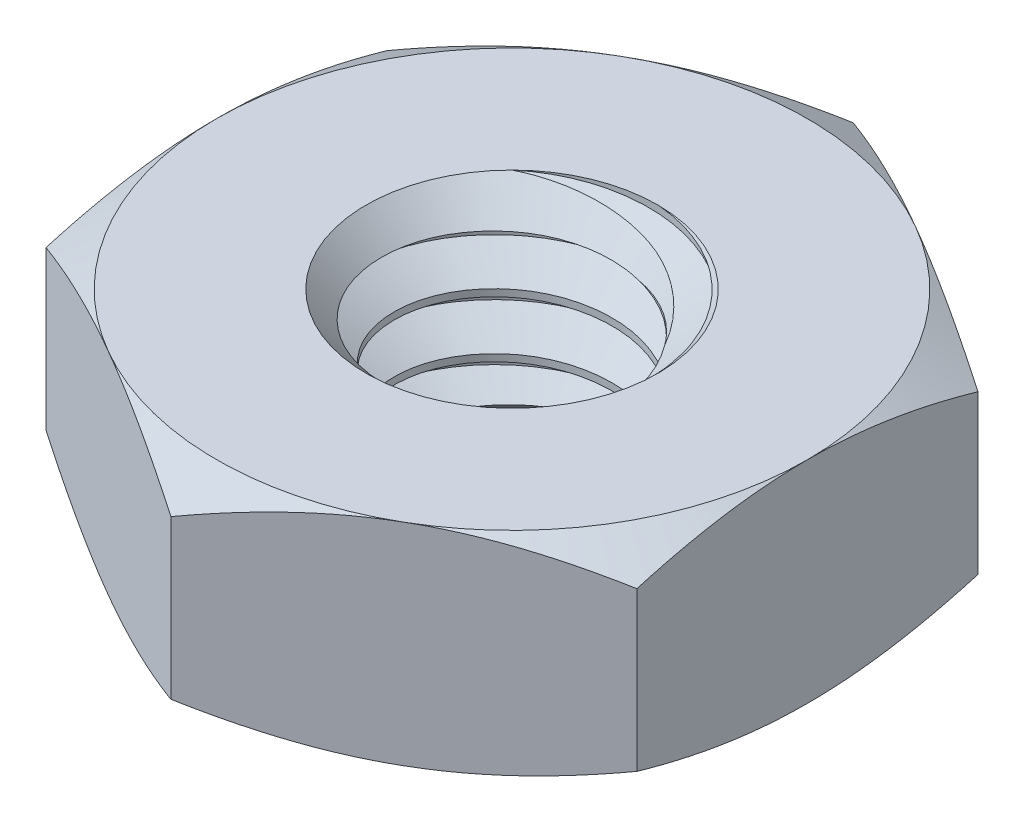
ISO-10303-21;
HEADER;
FILE_DESCRIPTION(('STEP AP214'),'2;1');
FILE_NAME('part.step','',(''),(''),'','','');
FILE_SCHEMA(('AUTOMOTIVE_DESIGN { 1 0 10303 214 1 1 1 1 }'));
ENDSEC;
DATA;
#1=APPLICATION_CONTEXT('core data for automotive mechanical design processes');
#2=APPLICATION_PROTOCOL_DEFINITION('international standard','automotive_design',2000,#1);
#3=PRODUCT_CONTEXT('',#1,'mechanical');
#4=PRODUCT('Part','Part','',(#3));
#5=PRODUCT_RELATED_PRODUCT_CATEGORY('part','',(#4));
#6=PRODUCT_DEFINITION_FORMATION('','',#4);
#7=PRODUCT_DEFINITION_CONTEXT('part definition',#1,'design');
#8=PRODUCT_DEFINITION('design','',#6,#7);
#9=PRODUCT_DEFINITION_SHAPE('','',#8);
#10=(LENGTH_UNIT() NAMED_UNIT(*) SI_UNIT(.MILLI.,.METRE.));
#11=(NAMED_UNIT(*) PLANE_ANGLE_UNIT() SI_UNIT($,.RADIAN.));
#12=(NAMED_UNIT(*) SI_UNIT($,.STERADIAN.) SOLID_ANGLE_UNIT());
#13=UNCERTAINTY_MEASURE_WITH_UNIT(LENGTH_MEASURE(1.E-05),#10,'distance_accuracy_value','');
#14=(GEOMETRIC_REPRESENTATION_CONTEXT(3) GLOBAL_UNCERTAINTY_ASSIGNED_CONTEXT((#13)) GLOBAL_UNIT_ASSIGNED_CONTEXT((#10,
#11,#12)) REPRESENTATION_CONTEXT('',''));
#15=CARTESIAN_POINT('',(0.,0.,0.));
#16=DIRECTION('',(0.,0.,1.));
#17=DIRECTION('',(1.,0.,0.));
#18=AXIS2_PLACEMENT_3D('',#15,#16,#17);
#19=CARTESIAN_POINT('',(0.,2.38125,-2.0557923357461));
#20=CARTESIAN_POINT('',(0.851537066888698,2.31510416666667,-2.0557923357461));
#21=CARTESIAN_POINT('',(1.4536647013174,2.24895833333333,-1.4536647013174));
#22=CARTESIAN_POINT('',(2.0557923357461,2.1828125,-0.851537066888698));
#23=CARTESIAN_POINT('',(2.0557923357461,2.11666666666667,0.));
#24=CARTESIAN_POINT('',(2.0557923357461,2.05052083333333,0.851537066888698));
#25=CARTESIAN_POINT('',(1.4536647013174,1.984375,1.4536647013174));
#26=CARTESIAN_POINT('',(0.851537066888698,1.91822916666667,2.0557923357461));
#27=CARTESIAN_POINT('',(0.,1.85208333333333,2.0557923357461));
#28=CARTESIAN_POINT('',(-0.851537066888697,1.7859375,2.0557923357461));
#29=CARTESIAN_POINT('',(-1.4536647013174,1.71979166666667,1.4536647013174));
#30=CARTESIAN_POINT('',(-2.0557923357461,1.65364583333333,0.851537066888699));
#31=CARTESIAN_POINT('',(-2.0557923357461,1.5875,0.));
#32=CARTESIAN_POINT('',(-2.0557923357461,1.52135416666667,-0.851537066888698));
#33=CARTESIAN_POINT('',(-1.4536647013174,1.45520833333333,-1.4536647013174));
#34=CARTESIAN_POINT('',(-0.851537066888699,1.3890625,-2.0557923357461));
#35=CARTESIAN_POINT('',(0.,1.32291666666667,-2.0557923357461));
#36=CARTESIAN_POINT('',(0.851537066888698,1.25677083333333,-2.0557923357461));
#37=CARTESIAN_POINT('',(1.4536647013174,1.190625,-1.4536647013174));
#38=CARTESIAN_POINT('',(2.0557923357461,1.12447916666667,-0.851537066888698));
#39=CARTESIAN_POINT('',(2.0557923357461,1.05833333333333,0.));
#40=CARTESIAN_POINT('',(2.0557923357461,0.992187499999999,0.851537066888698));
#41=CARTESIAN_POINT('',(1.4536647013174,0.926041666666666,1.4536647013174));
#42=CARTESIAN_POINT('',(0.851537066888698,0.859895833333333,2.0557923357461));
#43=CARTESIAN_POINT('',(0.,0.793749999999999,2.0557923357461));
#44=CARTESIAN_POINT('',(-0.851537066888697,0.727604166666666,2.0557923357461));
#45=CARTESIAN_POINT('',(-1.4536647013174,0.661458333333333,1.4536647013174));
#46=CARTESIAN_POINT('',(-2.0557923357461,0.595312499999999,0.851537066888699));
#47=CARTESIAN_POINT('',(-2.0557923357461,0.529166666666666,0.));
#48=CARTESIAN_POINT('',(-2.0557923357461,0.463020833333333,-0.851537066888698));
#49=CARTESIAN_POINT('',(-1.4536647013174,0.396875,-1.4536647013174));
#50=CARTESIAN_POINT('',(-0.851537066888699,0.330729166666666,-2.0557923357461));
#51=CARTESIAN_POINT('',(0.,0.264583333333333,-2.0557923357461));
#52=CARTESIAN_POINT('',(0.851537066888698,0.198437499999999,-2.0557923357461));
#53=CARTESIAN_POINT('',(1.4536647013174,0.132291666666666,-1.4536647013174));
#54=CARTESIAN_POINT('',(2.0557923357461,0.066145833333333,-0.851537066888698));
#55=CARTESIAN_POINT('',(2.0557923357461,0.,0.));
#56=CARTESIAN_POINT('',(2.0557923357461,-0.0661458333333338,0.851537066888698));
#57=CARTESIAN_POINT('',(1.4536647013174,-0.132291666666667,1.4536647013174));
#58=CARTESIAN_POINT('',(0.851537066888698,-0.1984375,2.0557923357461));
#59=CARTESIAN_POINT('',(0.,-0.264583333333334,2.0557923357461));
#60=CARTESIAN_POINT('',(-0.851537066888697,-0.330729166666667,2.0557923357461));
#61=CARTESIAN_POINT('',(-1.4536647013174,-0.396875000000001,1.4536647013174));
#62=CARTESIAN_POINT('',(-2.0557923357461,-0.463020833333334,0.851537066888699));
#63=CARTESIAN_POINT('',(-2.0557923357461,-0.529166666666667,0.));
#64=CARTESIAN_POINT('',(-2.0557923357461,-0.5953125,-0.851537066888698));
#65=CARTESIAN_POINT('',(-1.4536647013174,-0.661458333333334,-1.4536647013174));
#66=CARTESIAN_POINT('',(-0.851537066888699,-0.727604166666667,-2.0557923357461));
#67=CARTESIAN_POINT('',(0.,-0.793750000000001,-2.0557923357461));
#68=CARTESIAN_POINT('',(0.851537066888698,-0.859895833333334,-2.0557923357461));
#69=CARTESIAN_POINT('',(1.4536647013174,-0.926041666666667,-1.4536647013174));
#70=CARTESIAN_POINT('',(2.0557923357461,-0.9921875,-0.851537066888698));
#71=CARTESIAN_POINT('',(2.0557923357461,-1.05833333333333,0.));
#72=CARTESIAN_POINT('',(2.0557923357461,-1.12447916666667,0.851537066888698));
#73=CARTESIAN_POINT('',(1.4536647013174,-1.190625,1.4536647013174));
#74=CARTESIAN_POINT('',(0.851537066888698,-1.25677083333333,2.0557923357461));
#75=CARTESIAN_POINT('',(0.,-1.32291666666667,2.0557923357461));
#76=CARTESIAN_POINT('',(-0.851537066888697,-1.3890625,2.0557923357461));
#77=CARTESIAN_POINT('',(-1.4536647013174,-1.45520833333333,1.4536647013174));
#78=CARTESIAN_POINT('',(-2.0557923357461,-1.52135416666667,0.851537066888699));
#79=CARTESIAN_POINT('',(-2.0557923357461,-1.5875,0.));
#80=CARTESIAN_POINT('',(-2.0557923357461,-1.65364583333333,-0.851537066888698));
#81=CARTESIAN_POINT('',(-1.4536647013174,-1.71979166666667,-1.4536647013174));
#82=CARTESIAN_POINT('',(-0.851537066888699,-1.7859375,-2.0557923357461));
#83=CARTESIAN_POINT('',(0.,-1.85208333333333,-2.0557923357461));
#84=CARTESIAN_POINT('',(0.851537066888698,-1.91822916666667,-2.0557923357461));
#85=CARTESIAN_POINT('',(1.4536647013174,-1.984375,-1.4536647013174));
#86=CARTESIAN_POINT('',(2.0557923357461,-2.05052083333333,-0.851537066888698));
#87=CARTESIAN_POINT('',(2.0557923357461,-2.11666666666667,0.));
#88=CARTESIAN_POINT('',(2.0557923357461,-2.1828125,0.851537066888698));
#89=CARTESIAN_POINT('',(1.4536647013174,-2.24895833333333,1.4536647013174));
#90=CARTESIAN_POINT('',(0.851537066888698,-2.31510416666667,2.0557923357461));
#91=CARTESIAN_POINT('',(0.,-2.38125,2.0557923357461));
#92=CARTESIAN_POINT('',(-0.851537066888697,-2.44739583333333,2.0557923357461));
#93=CARTESIAN_POINT('',(-1.4536647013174,-2.51354166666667,1.4536647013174));
#94=CARTESIAN_POINT('',(-2.0557923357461,-2.5796875,0.851537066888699));
#95=CARTESIAN_POINT('',(-2.0557923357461,-2.64583333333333,0.));
#96=CARTESIAN_POINT('',(0.,1.984375,-2.7432));
#97=CARTESIAN_POINT('',(1.13627064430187,1.91822916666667,-2.7432));
#98=CARTESIAN_POINT('',(1.93973532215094,1.85208333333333,-1.93973532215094));
#99=CARTESIAN_POINT('',(2.7432,1.7859375,-1.13627064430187));
#100=CARTESIAN_POINT('',(2.7432,1.71979166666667,0.));
#101=CARTESIAN_POINT('',(2.7432,1.65364583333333,1.13627064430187));
#102=CARTESIAN_POINT('',(1.93973532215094,1.5875,1.93973532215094));
#103=CARTESIAN_POINT('',(1.13627064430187,1.52135416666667,2.7432));
#104=CARTESIAN_POINT('',(0.,1.45520833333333,2.7432));
#105=CARTESIAN_POINT('',(-1.13627064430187,1.3890625,2.7432));
#106=CARTESIAN_POINT('',(-1.93973532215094,1.32291666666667,1.93973532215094));
#107=CARTESIAN_POINT('',(-2.7432,1.25677083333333,1.13627064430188));
#108=CARTESIAN_POINT('',(-2.7432,1.190625,0.));
#109=CARTESIAN_POINT('',(-2.7432,1.12447916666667,-1.13627064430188));
#110=CARTESIAN_POINT('',(-1.93973532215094,1.05833333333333,-1.93973532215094));
#111=CARTESIAN_POINT('',(-1.13627064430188,0.9921875,-2.7432));
#112=CARTESIAN_POINT('',(0.,0.926041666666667,-2.7432));
#113=CARTESIAN_POINT('',(1.13627064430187,0.859895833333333,-2.7432));
#114=CARTESIAN_POINT('',(1.93973532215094,0.79375,-1.93973532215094));
#115=CARTESIAN_POINT('',(2.7432,0.727604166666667,-1.13627064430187));
#116=CARTESIAN_POINT('',(2.7432,0.661458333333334,0.));
#117=CARTESIAN_POINT('',(2.7432,0.5953125,1.13627064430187));
#118=CARTESIAN_POINT('',(1.93973532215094,0.529166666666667,1.93973532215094));
#119=CARTESIAN_POINT('',(1.13627064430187,0.463020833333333,2.7432));
#120=CARTESIAN_POINT('',(0.,0.396875,2.7432));
#121=CARTESIAN_POINT('',(-1.13627064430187,0.330729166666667,2.7432));
#122=CARTESIAN_POINT('',(-1.93973532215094,0.264583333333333,1.93973532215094));
#123=CARTESIAN_POINT('',(-2.7432,0.1984375,1.13627064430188));
#124=CARTESIAN_POINT('',(-2.7432,0.132291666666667,0.));
#125=CARTESIAN_POINT('',(-2.7432,0.0661458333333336,-1.13627064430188));
#126=CARTESIAN_POINT('',(-1.93973532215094,0.,-1.93973532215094));
#127=CARTESIAN_POINT('',(-1.13627064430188,-0.066145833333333,-2.7432));
#128=CARTESIAN_POINT('',(0.,-0.132291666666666,-2.7432));
#129=CARTESIAN_POINT('',(1.13627064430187,-0.1984375,-2.7432));
#130=CARTESIAN_POINT('',(1.93973532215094,-0.264583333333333,-1.93973532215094));
#131=CARTESIAN_POINT('',(2.7432,-0.330729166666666,-1.13627064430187));
#132=CARTESIAN_POINT('',(2.7432,-0.396875,0.));
#133=CARTESIAN_POINT('',(2.7432,-0.463020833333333,1.13627064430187));
#134=CARTESIAN_POINT('',(1.93973532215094,-0.529166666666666,1.93973532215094));
#135=CARTESIAN_POINT('',(1.13627064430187,-0.595312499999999,2.7432));
#136=CARTESIAN_POINT('',(0.,-0.661458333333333,2.7432));
#137=CARTESIAN_POINT('',(-1.13627064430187,-0.727604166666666,2.7432));
#138=CARTESIAN_POINT('',(-1.93973532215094,-0.79375,1.93973532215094));
#139=CARTESIAN_POINT('',(-2.7432,-0.859895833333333,1.13627064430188));
#140=CARTESIAN_POINT('',(-2.7432,-0.926041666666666,0.));
#141=CARTESIAN_POINT('',(-2.7432,-0.9921875,-1.13627064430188));
#142=CARTESIAN_POINT('',(-1.93973532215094,-1.05833333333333,-1.93973532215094));
#143=CARTESIAN_POINT('',(-1.13627064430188,-1.12447916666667,-2.7432));
#144=CARTESIAN_POINT('',(0.,-1.190625,-2.7432));
#145=CARTESIAN_POINT('',(1.13627064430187,-1.25677083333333,-2.7432));
#146=CARTESIAN_POINT('',(1.93973532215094,-1.32291666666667,-1.93973532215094));
#147=CARTESIAN_POINT('',(2.7432,-1.3890625,-1.13627064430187));
#148=CARTESIAN_POINT('',(2.7432,-1.45520833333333,0.));
#149=CARTESIAN_POINT('',(2.7432,-1.52135416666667,1.13627064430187));
#150=CARTESIAN_POINT('',(1.93973532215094,-1.5875,1.93973532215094));
#151=CARTESIAN_POINT('',(1.13627064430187,-1.65364583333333,2.7432));
#152=CARTESIAN_POINT('',(0.,-1.71979166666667,2.7432));
#153=CARTESIAN_POINT('',(-1.13627064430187,-1.7859375,2.7432));
#154=CARTESIAN_POINT('',(-1.93973532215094,-1.85208333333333,1.93973532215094));
#155=CARTESIAN_POINT('',(-2.7432,-1.91822916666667,1.13627064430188));
#156=CARTESIAN_POINT('',(-2.7432,-1.984375,0.));
#157=CARTESIAN_POINT('',(-2.7432,-2.05052083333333,-1.13627064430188));
#158=CARTESIAN_POINT('',(-1.93973532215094,-2.11666666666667,-1.93973532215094));
#159=CARTESIAN_POINT('',(-1.13627064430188,-2.1828125,-2.7432));
#160=CARTESIAN_POINT('',(0.,-2.24895833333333,-2.7432));
#161=CARTESIAN_POINT('',(1.13627064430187,-2.31510416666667,-2.7432));
#162=CARTESIAN_POINT('',(1.93973532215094,-2.38125,-1.93973532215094));
#163=CARTESIAN_POINT('',(2.7432,-2.44739583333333,-1.13627064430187));
#164=CARTESIAN_POINT('',(2.7432,-2.51354166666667,0.));
#165=CARTESIAN_POINT('',(2.7432,-2.5796875,1.13627064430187));
#166=CARTESIAN_POINT('',(1.93973532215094,-2.64583333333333,1.93973532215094));
#167=CARTESIAN_POINT('',(1.13627064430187,-2.71197916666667,2.7432));
#168=CARTESIAN_POINT('',(0.,-2.778125,2.7432));
#169=CARTESIAN_POINT('',(-1.13627064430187,-2.84427083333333,2.7432));
#170=CARTESIAN_POINT('',(-1.93973532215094,-2.91041666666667,1.93973532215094));
#171=CARTESIAN_POINT('',(-2.7432,-2.9765625,1.13627064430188));
#172=CARTESIAN_POINT('',(-2.7432,-3.04270833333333,0.));
#173=(BOUNDED_SURFACE() B_SPLINE_SURFACE(1,2,((#19,#20,#21,#22,#23,#24,#25,#26,#27,#28,#29,#30,
#31,#32,#33,#34,#35,#36,#37,#38,#39,#40,#41,#42,#43,#44,#45,#46,#47,#48,#49,#50,#51,#52,#53,#54,
#55,#56,#57,#58,#59,#60,#61,#62,#63,#64,#65,#66,#67,#68,#69,#70,#71,#72,#73,#74,#75,#76,#77,#78,
#79,#80,#81,#82,#83,#84,#85,#86,#87,#88,#89,#90,#91,#92,#93,#94,#95),(#96,#97,#98,#99,#100,#101,
#102,#103,#104,#105,#106,#107,#108,#109,#110,#111,#112,#113,#114,#115,#116,#117,#118,#119,#120,
#121,#122,#123,#124,#125,#126,#127,#128,#129,#130,#131,#132,#133,#134,#135,#136,#137,#138,#139,
#140,#141,#142,#143,#144,#145,#146,#147,#148,#149,#150,#151,#152,#153,#154,#155,#156,#157,#158,
#159,#160,#161,#162,#163,#164,#165,#166,#167,#168,#169,#170,#171,#172)),.UNSPECIFIED.,.F.,.F.,
.F.) B_SPLINE_SURFACE_WITH_KNOTS((2,2),(3,2,2,2,2,2,2,2,2,2,2,2,2,2,2,2,2,2,2,2,2,2,2,2,2,2,2,2,
2,2,2,2,2,2,2,2,2,2,3),(0.,1.),(0.,0.025,0.05,0.075,0.1,0.125,0.15,0.175,0.2,0.225,0.25,0.275,
0.3,0.325,0.35,0.375,0.4,0.425,0.45,0.475,0.5,0.525,0.55,0.575,0.6,0.625,0.65,0.675,0.7,0.725,
0.75,0.775,0.8,0.825,0.85,0.875,0.9,0.925,0.95),
.UNSPECIFIED.) GEOMETRIC_REPRESENTATION_ITEM() RATIONAL_B_SPLINE_SURFACE(((1.,0.923879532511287,
1.,0.923879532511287,1.,0.923879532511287,1.,0.923879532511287,1.,0.923879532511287,1.,
0.923879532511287,1.,0.923879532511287,1.,0.923879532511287,1.,0.923879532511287,1.,
0.923879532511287,1.,0.923879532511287,1.,0.923879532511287,1.,0.923879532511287,1.,
0.923879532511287,1.,0.923879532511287,1.,0.923879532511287,1.,0.923879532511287,1.,
0.923879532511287,1.,0.923879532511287,1.,0.923879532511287,1.,0.923879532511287,1.,
0.923879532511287,1.,0.923879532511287,1.,0.923879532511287,1.,0.923879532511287,1.,
0.923879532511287,1.,0.923879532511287,1.,0.923879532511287,1.,0.923879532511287,1.,
0.923879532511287,1.,0.923879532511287,1.,0.923879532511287,1.,0.923879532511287,1.,
0.923879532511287,1.,0.923879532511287,1.,0.923879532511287,1.,0.923879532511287,1.,
0.923879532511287,1.),(1.,0.923879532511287,1.,0.923879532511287,1.,0.923879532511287,1.,
0.923879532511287,1.,0.923879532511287,1.,0.923879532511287,1.,0.923879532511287,1.,
0.923879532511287,1.,0.923879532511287,1.,0.923879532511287,1.,0.923879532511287,1.,
0.923879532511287,1.,0.923879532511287,1.,0.923879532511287,1.,0.923879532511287,1.,
0.923879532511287,1.,0.923879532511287,1.,0.923879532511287,1.,0.923879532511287,1.,
0.923879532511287,1.,0.923879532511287,1.,0.923879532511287,1.,0.923879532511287,1.,
0.923879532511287,1.,0.923879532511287,1.,0.923879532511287,1.,0.923879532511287,1.,
0.923879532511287,1.,0.923879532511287,1.,0.923879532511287,1.,0.923879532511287,1.,
0.923879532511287,1.,0.923879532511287,1.,0.923879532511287,1.,0.923879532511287,1.,
0.923879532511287,1.,0.923879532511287,1.,0.923879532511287,1.))) REPRESENTATION_ITEM('') SURFACE());
#174=CARTESIAN_POINT('',(0.,1.984375,-2.7432));
#175=CARTESIAN_POINT('',(1.13627064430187,1.91822916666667,-2.7432));
#176=CARTESIAN_POINT('',(1.93973532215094,1.85208333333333,-1.93973532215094));
#177=CARTESIAN_POINT('',(2.7432,1.7859375,-1.13627064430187));
#178=CARTESIAN_POINT('',(2.7432,1.71979166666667,0.));
#179=CARTESIAN_POINT('',(2.7432,1.65364583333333,1.13627064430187));
#180=CARTESIAN_POINT('',(1.93973532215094,1.5875,1.93973532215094));
#181=CARTESIAN_POINT('',(1.13627064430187,1.52135416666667,2.7432));
#182=CARTESIAN_POINT('',(0.,1.45520833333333,2.7432));
#183=CARTESIAN_POINT('',(-1.13627064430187,1.3890625,2.7432));
#184=CARTESIAN_POINT('',(-1.93973532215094,1.32291666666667,1.93973532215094));
#185=CARTESIAN_POINT('',(-2.7432,1.25677083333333,1.13627064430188));
#186=CARTESIAN_POINT('',(-2.7432,1.190625,0.));
#187=CARTESIAN_POINT('',(-2.7432,1.12447916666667,-1.13627064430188));
#188=CARTESIAN_POINT('',(-1.93973532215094,1.05833333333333,-1.93973532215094));
#189=CARTESIAN_POINT('',(-1.13627064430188,0.9921875,-2.7432));
#190=CARTESIAN_POINT('',(0.,0.926041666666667,-2.7432));
#191=CARTESIAN_POINT('',(1.13627064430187,0.859895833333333,-2.7432));
#192=CARTESIAN_POINT('',(1.93973532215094,0.79375,-1.93973532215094));
#193=CARTESIAN_POINT('',(2.7432,0.727604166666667,-1.13627064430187));
#194=CARTESIAN_POINT('',(2.7432,0.661458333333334,0.));
#195=CARTESIAN_POINT('',(2.7432,0.5953125,1.13627064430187));
#196=CARTESIAN_POINT('',(1.93973532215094,0.529166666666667,1.93973532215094));
#197=CARTESIAN_POINT('',(1.13627064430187,0.463020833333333,2.7432));
#198=CARTESIAN_POINT('',(0.,0.396875,2.7432));
#199=CARTESIAN_POINT('',(-1.13627064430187,0.330729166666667,2.7432));
#200=CARTESIAN_POINT('',(-1.93973532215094,0.264583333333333,1.93973532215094));
#201=CARTESIAN_POINT('',(-2.7432,0.1984375,1.13627064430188));
#202=CARTESIAN_POINT('',(-2.7432,0.132291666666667,0.));
#203=CARTESIAN_POINT('',(-2.7432,0.0661458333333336,-1.13627064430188));
#204=CARTESIAN_POINT('',(-1.93973532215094,0.,-1.93973532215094));
#205=CARTESIAN_POINT('',(-1.13627064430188,-0.066145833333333,-2.7432));
#206=CARTESIAN_POINT('',(0.,-0.132291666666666,-2.7432));
#207=CARTESIAN_POINT('',(1.13627064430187,-0.1984375,-2.7432));
#208=CARTESIAN_POINT('',(1.93973532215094,-0.264583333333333,-1.93973532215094));
#209=CARTESIAN_POINT('',(2.7432,-0.330729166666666,-1.13627064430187));
#210=CARTESIAN_POINT('',(2.7432,-0.396875,0.));
#211=CARTESIAN_POINT('',(2.7432,-0.463020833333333,1.13627064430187));
#212=CARTESIAN_POINT('',(1.93973532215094,-0.529166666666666,1.93973532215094));
#213=CARTESIAN_POINT('',(1.13627064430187,-0.595312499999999,2.7432));
#214=CARTESIAN_POINT('',(0.,-0.661458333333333,2.7432));
#215=CARTESIAN_POINT('',(-1.13627064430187,-0.727604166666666,2.7432));
#216=CARTESIAN_POINT('',(-1.93973532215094,-0.79375,1.93973532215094));
#217=CARTESIAN_POINT('',(-2.7432,-0.859895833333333,1.13627064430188));
#218=CARTESIAN_POINT('',(-2.7432,-0.926041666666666,0.));
#219=CARTESIAN_POINT('',(-2.7432,-0.9921875,-1.13627064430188));
#220=CARTESIAN_POINT('',(-1.93973532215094,-1.05833333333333,-1.93973532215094));
#221=CARTESIAN_POINT('',(-1.13627064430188,-1.12447916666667,-2.7432));
#222=CARTESIAN_POINT('',(0.,-1.190625,-2.7432));
#223=CARTESIAN_POINT('',(1.13627064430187,-1.25677083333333,-2.7432));
#224=CARTESIAN_POINT('',(1.93973532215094,-1.32291666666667,-1.93973532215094));
#225=CARTESIAN_POINT('',(2.7432,-1.3890625,-1.13627064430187));
#226=CARTESIAN_POINT('',(2.7432,-1.45520833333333,0.));
#227=CARTESIAN_POINT('',(2.7432,-1.52135416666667,1.13627064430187));
#228=CARTESIAN_POINT('',(1.93973532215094,-1.5875,1.93973532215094));
#229=CARTESIAN_POINT('',(1.13627064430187,-1.65364583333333,2.7432));
#230=CARTESIAN_POINT('',(0.,-1.71979166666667,2.7432));
#231=CARTESIAN_POINT('',(-1.13627064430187,-1.7859375,2.7432));
#232=CARTESIAN_POINT('',(-1.93973532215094,-1.85208333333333,1.93973532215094));
#233=CARTESIAN_POINT('',(-2.7432,-1.91822916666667,1.13627064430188));
#234=CARTESIAN_POINT('',(-2.7432,-1.984375,0.));
#235=CARTESIAN_POINT('',(-2.7432,-2.05052083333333,-1.13627064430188));
#236=CARTESIAN_POINT('',(-1.93973532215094,-2.11666666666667,-1.93973532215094));
#237=CARTESIAN_POINT('',(-1.13627064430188,-2.1828125,-2.7432));
#238=CARTESIAN_POINT('',(0.,-2.24895833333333,-2.7432));
#239=CARTESIAN_POINT('',(1.13627064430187,-2.31510416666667,-2.7432));
#240=CARTESIAN_POINT('',(1.93973532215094,-2.38125,-1.93973532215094));
#241=CARTESIAN_POINT('',(2.7432,-2.44739583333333,-1.13627064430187));
#242=CARTESIAN_POINT('',(2.7432,-2.51354166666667,0.));
#243=CARTESIAN_POINT('',(2.7432,-2.5796875,1.13627064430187));
#244=CARTESIAN_POINT('',(1.93973532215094,-2.64583333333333,1.93973532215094));
#245=CARTESIAN_POINT('',(1.13627064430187,-2.71197916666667,2.7432));
#246=CARTESIAN_POINT('',(0.,-2.778125,2.7432));
#247=CARTESIAN_POINT('',(-1.13627064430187,-2.84427083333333,2.7432));
#248=CARTESIAN_POINT('',(-1.93973532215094,-2.91041666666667,1.93973532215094));
#249=CARTESIAN_POINT('',(-2.7432,-2.9765625,1.13627064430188));
#250=CARTESIAN_POINT('',(-2.7432,-3.04270833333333,0.));
#251=(BOUNDED_CURVE() B_SPLINE_CURVE(2,(#174,#175,#176,#177,#178,#179,#180,#181,#182,#183,#184,
#185,#186,#187,#188,#189,#190,#191,#192,#193,#194,#195,#196,#197,#198,#199,#200,#201,#202,#203,
#204,#205,#206,#207,#208,#209,#210,#211,#212,#213,#214,#215,#216,#217,#218,#219,#220,#221,#222,
#223,#224,#225,#226,#227,#228,#229,#230,#231,#232,#233,#234,#235,#236,#237,#238,#239,#240,#241,
#242,#243,#244,#245,#246,#247,#248,#249,#250),.UNSPECIFIED.,.F.,
.F.) B_SPLINE_CURVE_WITH_KNOTS((3,2,2,2,2,2,2,2,2,2,2,2,2,2,2,2,2,2,2,2,2,2,2,2,2,2,2,2,2,2,2,2,
2,2,2,2,2,2,3),(0.,0.025,0.05,0.075,0.1,0.125,0.15,0.175,0.2,0.225,0.25,0.275,0.3,0.325,0.35,
0.375,0.4,0.425,0.45,0.475,0.5,0.525,0.55,0.575,0.6,0.625,0.65,0.675,0.7,0.725,0.75,0.775,0.8,
0.825,0.85,0.875,0.9,0.925,0.95),
.UNSPECIFIED.) CURVE() GEOMETRIC_REPRESENTATION_ITEM() RATIONAL_B_SPLINE_CURVE((1.,
0.923879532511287,1.,0.923879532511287,1.,0.923879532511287,1.,0.923879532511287,1.,
0.923879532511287,1.,0.923879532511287,1.,0.923879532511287,1.,0.923879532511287,1.,
0.923879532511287,1.,0.923879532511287,1.,0.923879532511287,1.,0.923879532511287,1.,
0.923879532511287,1.,0.923879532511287,1.,0.923879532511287,1.,0.923879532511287,1.,
0.923879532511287,1.,0.923879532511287,1.,0.923879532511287,1.,0.923879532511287,1.,
0.923879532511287,1.,0.923879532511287,1.,0.923879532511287,1.,0.923879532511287,1.,
0.923879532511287,1.,0.923879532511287,1.,0.923879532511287,1.,0.923879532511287,1.,
0.923879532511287,1.,0.923879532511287,1.,0.923879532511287,1.,0.923879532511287,1.,
0.923879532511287,1.,0.923879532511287,1.,0.923879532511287,1.,0.923879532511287,1.,
0.923879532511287,1.,0.923879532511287,1.)) REPRESENTATION_ITEM(''));
#252=CARTESIAN_POINT('',(0.,1.984375,-2.7432));
#253=VERTEX_POINT('',#252);
#254=CARTESIAN_POINT('',(-2.7432,-1.984375,0.));
#255=VERTEX_POINT('',#254);
#256=EDGE_CURVE('E376',#253,#255,#251,.T.);
#257=CARTESIAN_POINT('',(-2.7432,-1.984375,0.));
#258=CARTESIAN_POINT('',(-2.73352750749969,-1.97469635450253,0.0702775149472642));
#259=CARTESIAN_POINT('',(-2.72094319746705,-1.96481852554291,0.140125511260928));
#260=CARTESIAN_POINT('',(-2.69006920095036,-1.94471247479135,0.278489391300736));
#261=CARTESIAN_POINT('',(-2.67178015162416,-1.93448429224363,0.347005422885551));
#262=CARTESIAN_POINT('',(-2.62963839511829,-1.91373596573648,0.482165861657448));
#263=CARTESIAN_POINT('',(-2.60579248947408,-1.90321619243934,0.548812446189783));
#264=CARTESIAN_POINT('',(-2.55268754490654,-1.88192441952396,0.679874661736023));
#265=CARTESIAN_POINT('',(-2.52342823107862,-1.87115240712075,0.744290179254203));
#266=CARTESIAN_POINT('',(-2.45876449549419,-1.84909585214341,0.872292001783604));
#267=CARTESIAN_POINT('',(-2.42320588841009,-1.83780552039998,0.93579948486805));
#268=CARTESIAN_POINT('',(-2.34682077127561,-1.81508605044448,1.05953151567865));
#269=CARTESIAN_POINT('',(-2.30599455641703,-1.80365692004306,1.11975624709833));
#270=CARTESIAN_POINT('',(-2.21932913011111,-1.7807212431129,1.23654104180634));
#271=CARTESIAN_POINT('',(-2.17348609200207,-1.76921464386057,1.29309825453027));
#272=CARTESIAN_POINT('',(-2.0771325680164,-1.74621796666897,1.40211260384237));
#273=CARTESIAN_POINT('',(-2.02662119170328,-1.73472789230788,1.45456895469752));
#274=CARTESIAN_POINT('',(-1.9211575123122,-1.71179544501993,1.55509220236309));
#275=CARTESIAN_POINT('',(-1.86619451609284,-1.70035326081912,1.60314790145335));
#276=CARTESIAN_POINT('',(-1.75237762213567,-1.67775097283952,1.6944793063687));
#277=CARTESIAN_POINT('',(-1.69352463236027,-1.66659080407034,1.73775612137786));
#278=CARTESIAN_POINT('',(-1.5720170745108,-1.64371446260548,1.81827950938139));
#279=CARTESIAN_POINT('',(-1.50936731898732,-1.63199899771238,1.85553350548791));
#280=CARTESIAN_POINT('',(-1.38083020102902,-1.60813967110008,1.92379332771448));
#281=CARTESIAN_POINT('',(-1.31494267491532,-1.59599578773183,1.95479883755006));
#282=CARTESIAN_POINT('',(-1.18553045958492,-1.57225432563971,2.00819524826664));
#283=CARTESIAN_POINT('',(-1.12219401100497,-1.56068320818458,2.03105508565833));
#284=CARTESIAN_POINT('',(-0.993771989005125,-1.53729571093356,2.07098321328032));
#285=CARTESIAN_POINT('',(-0.928686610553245,-1.52547935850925,2.08805214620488));
#286=CARTESIAN_POINT('',(-0.797226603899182,-1.501664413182,2.11627586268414));
#287=CARTESIAN_POINT('',(-0.730851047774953,-1.4896656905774,2.12742621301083));
#288=CARTESIAN_POINT('',(-0.59737124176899,-1.4655746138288,2.14370633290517));
#289=CARTESIAN_POINT('',(-0.530266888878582,-1.45348224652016,2.14883523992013));
#290=CARTESIAN_POINT('',(-0.396404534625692,-1.42939354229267,2.1530140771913));
#291=CARTESIAN_POINT('',(-0.329647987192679,-1.41739720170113,2.15211172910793));
#292=CARTESIAN_POINT('',(-0.196470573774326,-1.39349958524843,2.14434222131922));
#293=CARTESIAN_POINT('',(-0.130049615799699,-1.38159828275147,2.13747679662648));
#294=CARTESIAN_POINT('',(-0.0475676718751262,-1.36685836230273,2.12521465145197));
#295=CARTESIAN_POINT('',(-0.0310879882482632,-1.3639153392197,2.12257632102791));
#296=CARTESIAN_POINT('',(0.00180868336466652,-1.35803905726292,2.11692697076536));
#297=CARTESIAN_POINT('',(0.0182256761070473,-1.35510579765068,2.11391597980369));
#298=CARTESIAN_POINT('',(0.0673361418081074,-1.34624137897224,2.10424549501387));
#299=CARTESIAN_POINT('',(0.0998944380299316,-1.34024465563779,2.09694772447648));
#300=CARTESIAN_POINT('',(0.164594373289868,-1.32811237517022,2.08069521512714));
#301=CARTESIAN_POINT('',(0.196735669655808,-1.32197671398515,2.07173919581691));
#302=CARTESIAN_POINT('',(0.260505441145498,-1.3095712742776,2.0521878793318));
#303=CARTESIAN_POINT('',(0.292133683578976,-1.30330143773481,2.04159186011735));
#304=CARTESIAN_POINT('',(0.323455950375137,-1.2969673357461,2.03018678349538));
#305=B_SPLINE_CURVE_WITH_KNOTS('',3,(#257,#258,#259,#260,#261,#262,#263,#264,#265,#266,#267,
#268,#269,#270,#271,#272,#273,#274,#275,#276,#277,#278,#279,#280,#281,#282,#283,#284,#285,#286,
#287,#288,#289,#290,#291,#292,#293,#294,#295,#296,#297,#298,#299,#300,#301,#302,#303,#304),
.UNSPECIFIED.,.F.,.F.,(4,2,2,2,2,2,2,2,2,2,2,2,2,2,2,2,2,2,2,2,2,2,2,4),(0.,0.214729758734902,
0.429435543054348,0.643879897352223,0.85833514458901,1.07903778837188,1.29972806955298,
1.52058787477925,1.74148989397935,1.96293923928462,2.18433707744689,2.40545992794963,
2.62659396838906,2.83129572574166,3.03597475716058,3.24080688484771,3.44566835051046,
3.64891080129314,3.85209413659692,3.90293331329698,3.95376855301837,4.05542264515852,
4.15715556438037,4.25893340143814),.UNSPECIFIED.);
#306=CARTESIAN_POINT('',(0.323455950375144,-1.2969673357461,2.03018678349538));
#307=VERTEX_POINT('',#306);
#308=EDGE_CURVE('E497',#255,#307,#305,.T.);
#309=CARTESIAN_POINT('',(0.,2.38125,-2.0557923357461));
#310=CARTESIAN_POINT('',(0.851537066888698,2.31510416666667,-2.0557923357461));
#311=CARTESIAN_POINT('',(1.4536647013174,2.24895833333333,-1.4536647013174));
#312=CARTESIAN_POINT('',(2.0557923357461,2.1828125,-0.851537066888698));
#313=CARTESIAN_POINT('',(2.0557923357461,2.11666666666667,0.));
#314=CARTESIAN_POINT('',(2.0557923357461,2.05052083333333,0.851537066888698));
#315=CARTESIAN_POINT('',(1.4536647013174,1.984375,1.4536647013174));
#316=CARTESIAN_POINT('',(0.851537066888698,1.91822916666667,2.0557923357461));
#317=CARTESIAN_POINT('',(0.,1.85208333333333,2.0557923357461));
#318=CARTESIAN_POINT('',(-0.851537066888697,1.7859375,2.0557923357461));
#319=CARTESIAN_POINT('',(-1.4536647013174,1.71979166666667,1.4536647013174));
#320=CARTESIAN_POINT('',(-2.0557923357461,1.65364583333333,0.851537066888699));
#321=CARTESIAN_POINT('',(-2.0557923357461,1.5875,0.));
#322=CARTESIAN_POINT('',(-2.0557923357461,1.52135416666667,-0.851537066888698));
#323=CARTESIAN_POINT('',(-1.4536647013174,1.45520833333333,-1.4536647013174));
#324=CARTESIAN_POINT('',(-0.851537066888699,1.3890625,-2.0557923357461));
#325=CARTESIAN_POINT('',(0.,1.32291666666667,-2.0557923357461));
#326=CARTESIAN_POINT('',(0.851537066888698,1.25677083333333,-2.0557923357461));
#327=CARTESIAN_POINT('',(1.4536647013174,1.190625,-1.4536647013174));
#328=CARTESIAN_POINT('',(2.0557923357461,1.12447916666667,-0.851537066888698));
#329=CARTESIAN_POINT('',(2.0557923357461,1.05833333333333,0.));
#330=CARTESIAN_POINT('',(2.0557923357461,0.992187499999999,0.851537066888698));
#331=CARTESIAN_POINT('',(1.4536647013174,0.926041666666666,1.4536647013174));
#332=CARTESIAN_POINT('',(0.851537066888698,0.859895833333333,2.0557923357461));
#333=CARTESIAN_POINT('',(0.,0.793749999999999,2.0557923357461));
#334=CARTESIAN_POINT('',(-0.851537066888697,0.727604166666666,2.0557923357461));
#335=CARTESIAN_POINT('',(-1.4536647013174,0.661458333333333,1.4536647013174));
#336=CARTESIAN_POINT('',(-2.0557923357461,0.595312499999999,0.851537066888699));
#337=CARTESIAN_POINT('',(-2.0557923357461,0.529166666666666,0.));
#338=CARTESIAN_POINT('',(-2.0557923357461,0.463020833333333,-0.851537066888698));
#339=CARTESIAN_POINT('',(-1.4536647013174,0.396875,-1.4536647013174));
#340=CARTESIAN_POINT('',(-0.851537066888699,0.330729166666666,-2.0557923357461));
#341=CARTESIAN_POINT('',(0.,0.264583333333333,-2.0557923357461));
#342=CARTESIAN_POINT('',(0.851537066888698,0.198437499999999,-2.0557923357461));
#343=CARTESIAN_POINT('',(1.4536647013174,0.132291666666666,-1.4536647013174));
#344=CARTESIAN_POINT('',(2.0557923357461,0.066145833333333,-0.851537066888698));
#345=CARTESIAN_POINT('',(2.0557923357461,0.,0.));
#346=CARTESIAN_POINT('',(2.0557923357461,-0.0661458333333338,0.851537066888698));
#347=CARTESIAN_POINT('',(1.4536647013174,-0.132291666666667,1.4536647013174));
#348=CARTESIAN_POINT('',(0.851537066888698,-0.1984375,2.0557923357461));
#349=CARTESIAN_POINT('',(0.,-0.264583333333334,2.0557923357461));
#350=CARTESIAN_POINT('',(-0.851537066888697,-0.330729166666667,2.0557923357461));
#351=CARTESIAN_POINT('',(-1.4536647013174,-0.396875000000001,1.4536647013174));
#352=CARTESIAN_POINT('',(-2.0557923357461,-0.463020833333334,0.851537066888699));
#353=CARTESIAN_POINT('',(-2.0557923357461,-0.529166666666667,0.));
#354=CARTESIAN_POINT('',(-2.0557923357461,-0.5953125,-0.851537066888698));
#355=CARTESIAN_POINT('',(-1.4536647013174,-0.661458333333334,-1.4536647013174));
#356=CARTESIAN_POINT('',(-0.851537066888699,-0.727604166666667,-2.0557923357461));
#357=CARTESIAN_POINT('',(0.,-0.793750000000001,-2.0557923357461));
#358=CARTESIAN_POINT('',(0.851537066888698,-0.859895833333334,-2.0557923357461));
#359=CARTESIAN_POINT('',(1.4536647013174,-0.926041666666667,-1.4536647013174));
#360=CARTESIAN_POINT('',(2.0557923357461,-0.9921875,-0.851537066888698));
#361=CARTESIAN_POINT('',(2.0557923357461,-1.05833333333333,0.));
#362=CARTESIAN_POINT('',(2.0557923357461,-1.12447916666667,0.851537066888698));
#363=CARTESIAN_POINT('',(1.4536647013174,-1.190625,1.4536647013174));
#364=CARTESIAN_POINT('',(0.851537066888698,-1.25677083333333,2.0557923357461));
#365=CARTESIAN_POINT('',(0.,-1.32291666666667,2.0557923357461));
#366=CARTESIAN_POINT('',(-0.851537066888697,-1.3890625,2.0557923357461));
#367=CARTESIAN_POINT('',(-1.4536647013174,-1.45520833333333,1.4536647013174));
#368=CARTESIAN_POINT('',(-2.0557923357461,-1.52135416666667,0.851537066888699));
#369=CARTESIAN_POINT('',(-2.0557923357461,-1.5875,0.));
#370=CARTESIAN_POINT('',(-2.0557923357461,-1.65364583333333,-0.851537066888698));
#371=CARTESIAN_POINT('',(-1.4536647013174,-1.71979166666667,-1.4536647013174));
#372=CARTESIAN_POINT('',(-0.851537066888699,-1.7859375,-2.0557923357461));
#373=CARTESIAN_POINT('',(0.,-1.85208333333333,-2.0557923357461));
#374=CARTESIAN_POINT('',(0.851537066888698,-1.91822916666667,-2.0557923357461));
#375=CARTESIAN_POINT('',(1.4536647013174,-1.984375,-1.4536647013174));
#376=CARTESIAN_POINT('',(2.0557923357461,-2.05052083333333,-0.851537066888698));
#377=CARTESIAN_POINT('',(2.0557923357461,-2.11666666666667,0.));
#378=CARTESIAN_POINT('',(2.0557923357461,-2.1828125,0.851537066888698));
#379=CARTESIAN_POINT('',(1.4536647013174,-2.24895833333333,1.4536647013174));
#380=CARTESIAN_POINT('',(0.851537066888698,-2.31510416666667,2.0557923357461));
#381=CARTESIAN_POINT('',(0.,-2.38125,2.0557923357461));
#382=CARTESIAN_POINT('',(-0.851537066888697,-2.44739583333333,2.0557923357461));
#383=CARTESIAN_POINT('',(-1.4536647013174,-2.51354166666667,1.4536647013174));
#384=CARTESIAN_POINT('',(-2.0557923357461,-2.5796875,0.851537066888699));
#385=CARTESIAN_POINT('',(-2.0557923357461,-2.64583333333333,0.));
#386=(BOUNDED_CURVE() B_SPLINE_CURVE(2,(#309,#310,#311,#312,#313,#314,#315,#316,#317,#318,#319,
#320,#321,#322,#323,#324,#325,#326,#327,#328,#329,#330,#331,#332,#333,#334,#335,#336,#337,#338,
#339,#340,#341,#342,#343,#344,#345,#346,#347,#348,#349,#350,#351,#352,#353,#354,#355,#356,#357,
#358,#359,#360,#361,#362,#363,#364,#365,#366,#367,#368,#369,#370,#371,#372,#373,#374,#375,#376,
#377,#378,#379,#380,#381,#382,#383,#384,#385),.UNSPECIFIED.,.F.,
.F.) B_SPLINE_CURVE_WITH_KNOTS((3,2,2,2,2,2,2,2,2,2,2,2,2,2,2,2,2,2,2,2,2,2,2,2,2,2,2,2,2,2,2,2,
2,2,2,2,2,2,3),(0.,0.025,0.05,0.075,0.1,0.125,0.15,0.175,0.2,0.225,0.25,0.275,0.3,0.325,0.35,
0.375,0.4,0.425,0.45,0.475,0.5,0.525,0.55,0.575,0.6,0.625,0.65,0.675,0.7,0.725,0.75,0.775,0.8,
0.825,0.85,0.875,0.9,0.925,0.95),
.UNSPECIFIED.) CURVE() GEOMETRIC_REPRESENTATION_ITEM() RATIONAL_B_SPLINE_CURVE((1.,
0.923879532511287,1.,0.923879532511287,1.,0.923879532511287,1.,0.923879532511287,1.,
0.923879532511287,1.,0.923879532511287,1.,0.923879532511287,1.,0.923879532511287,1.,
0.923879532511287,1.,0.923879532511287,1.,0.923879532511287,1.,0.923879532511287,1.,
0.923879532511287,1.,0.923879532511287,1.,0.923879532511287,1.,0.923879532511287,1.,
0.923879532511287,1.,0.923879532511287,1.,0.923879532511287,1.,0.923879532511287,1.,
0.923879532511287,1.,0.923879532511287,1.,0.923879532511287,1.,0.923879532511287,1.,
0.923879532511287,1.,0.923879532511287,1.,0.923879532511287,1.,0.923879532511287,1.,
0.923879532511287,1.,0.923879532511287,1.,0.923879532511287,1.,0.923879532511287,1.,
0.923879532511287,1.,0.923879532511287,1.,0.923879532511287,1.,0.923879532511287,1.,
0.923879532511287,1.,0.923879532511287,1.)) REPRESENTATION_ITEM(''));
#387=CARTESIAN_POINT('',(0.323455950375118,1.2969673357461,-2.03018678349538));
#388=VERTEX_POINT('',#387);
#389=EDGE_CURVE('E397',#388,#307,#386,.T.);
#390=CARTESIAN_POINT('',(0.,1.984375,-2.7432));
#391=CARTESIAN_POINT('',(0.0714038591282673,1.98173983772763,-2.74056603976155));
#392=CARTESIAN_POINT('',(0.142674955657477,1.97905925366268,-2.73509542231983));
#393=CARTESIAN_POINT('',(0.284550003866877,1.97362125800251,-2.71852674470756));
#394=CARTESIAN_POINT('',(0.355154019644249,1.97086385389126,-2.70742923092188));
#395=CARTESIAN_POINT('',(0.565223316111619,1.96250304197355,-2.66579537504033));
#396=CARTESIAN_POINT('',(0.703111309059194,1.95680493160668,-2.62691145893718));
#397=CARTESIAN_POINT('',(0.979541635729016,1.94493293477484,-2.52464405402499));
#398=CARTESIAN_POINT('',(1.11756920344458,1.93875181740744,-2.45986126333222));
#399=CARTESIAN_POINT('',(1.31486831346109,1.92952338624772,-2.34608646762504));
#400=CARTESIAN_POINT('',(1.37904170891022,1.92645286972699,-2.30536935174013));
#401=CARTESIAN_POINT('',(1.50375049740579,1.92034788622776,-2.21865993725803));
#402=CARTESIAN_POINT('',(1.5642857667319,1.91731342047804,-2.17266745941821));
#403=CARTESIAN_POINT('',(1.68129007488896,1.91129371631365,-2.07570903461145));
#404=CARTESIAN_POINT('',(1.73775658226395,1.90830850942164,-2.02474003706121));
#405=CARTESIAN_POINT('',(1.84621068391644,1.90244416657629,-1.91823519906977));
#406=CARTESIAN_POINT('',(1.89819849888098,1.89956502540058,-1.86269958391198));
#407=CARTESIAN_POINT('',(1.99712331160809,1.89369392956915,-1.74731730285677));
#408=CARTESIAN_POINT('',(2.04406158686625,1.89070200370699,-1.68747173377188));
#409=CARTESIAN_POINT('',(2.13254505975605,1.88463963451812,-1.5639460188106));
#410=CARTESIAN_POINT('',(2.17409022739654,1.88156919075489,-1.50026585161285));
#411=CARTESIAN_POINT('',(2.28867454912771,1.87238508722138,-1.30665841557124));
#412=CARTESIAN_POINT('',(2.35364490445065,1.86618054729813,-1.17183897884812));
#413=CARTESIAN_POINT('',(2.45967605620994,1.853711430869,-0.893055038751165));
#414=CARTESIAN_POINT('',(2.50072947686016,1.84744683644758,-0.74908772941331));
#415=CARTESIAN_POINT('',(2.54331313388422,1.83818861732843,-0.530539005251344));
#416=CARTESIAN_POINT('',(2.55433137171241,1.83514319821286,-0.457693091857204));
#417=CARTESIAN_POINT('',(2.57018742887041,1.82910607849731,-0.311323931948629));
#418=CARTESIAN_POINT('',(2.57502721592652,1.82611436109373,-0.23780090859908));
#419=CARTESIAN_POINT('',(2.57762211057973,1.82168268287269,-0.127431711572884));
#420=CARTESIAN_POINT('',(2.57770943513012,1.82021466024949,-0.090624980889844));
#421=CARTESIAN_POINT('',(2.57633509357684,1.81730440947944,-0.0170464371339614));
#422=CARTESIAN_POINT('',(2.57487382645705,1.81586217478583,0.0197253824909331));
#423=CARTESIAN_POINT('',(2.56808519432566,1.81149090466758,0.1298825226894));
#424=CARTESIAN_POINT('',(2.56035333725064,1.80851680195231,0.203122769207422));
#425=CARTESIAN_POINT('',(2.5278223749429,1.79952443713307,0.420049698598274));
#426=CARTESIAN_POINT('',(2.49372305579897,1.79337920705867,0.562434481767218));
#427=CARTESIAN_POINT('',(2.40150225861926,1.7809156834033,0.839233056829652));
#428=CARTESIAN_POINT('',(2.3433759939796,1.77459735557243,0.973645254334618));
#429=CARTESIAN_POINT('',(2.24040442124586,1.76521257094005,1.16466259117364));
#430=CARTESIAN_POINT('',(2.20395645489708,1.76213466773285,1.22592164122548));
#431=CARTESIAN_POINT('',(2.12601721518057,1.75600365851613,1.34516608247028));
#432=CARTESIAN_POINT('',(2.08452582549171,1.75295055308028,1.40315139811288));
#433=CARTESIAN_POINT('',(1.99680375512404,1.74689535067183,1.51541228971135));
#434=CARTESIAN_POINT('',(1.95057384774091,1.74389324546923,1.56968846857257));
#435=CARTESIAN_POINT('',(1.87792891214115,1.73943872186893,1.64802051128));
#436=CARTESIAN_POINT('',(1.8531613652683,1.73796184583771,1.67361981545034));
#437=CARTESIAN_POINT('',(1.80257506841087,1.73503890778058,1.72375947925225));
#438=CARTESIAN_POINT('',(1.77675631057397,1.73359284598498,1.74829983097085));
#439=CARTESIAN_POINT('',(1.69768891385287,1.72922422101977,1.82025009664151));
#440=CARTESIAN_POINT('',(1.64286377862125,1.72627324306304,1.86595173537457));
#441=CARTESIAN_POINT('',(1.52945954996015,1.72027203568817,1.95237243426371));
#442=CARTESIAN_POINT('',(1.47088048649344,1.71722180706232,1.99309153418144));
#443=CARTESIAN_POINT('',(1.29018209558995,1.70797153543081,2.10730436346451));
#444=CARTESIAN_POINT('',(1.16298132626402,1.70166528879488,2.17296281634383));
#445=CARTESIAN_POINT('',(0.903571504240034,1.68917061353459,2.27929680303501));
#446=CARTESIAN_POINT('',(0.771675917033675,1.68298538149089,2.32074003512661));
#447=CARTESIAN_POINT('',(0.570129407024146,1.67377901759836,2.36585401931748));
#448=CARTESIAN_POINT('',(0.502293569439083,1.67072056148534,2.37805211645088));
#449=CARTESIAN_POINT('',(0.365814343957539,1.66464519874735,2.39668877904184));
#450=CARTESIAN_POINT('',(0.297170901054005,1.6616282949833,2.40312694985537));
#451=CARTESIAN_POINT('',(0.159512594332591,1.65566533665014,2.41020039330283));
#452=CARTESIAN_POINT('',(0.0904974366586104,1.65271935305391,2.41083007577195));
#453=CARTESIAN_POINT('',(-0.0128632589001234,1.64834923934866,2.40738622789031));
#454=CARTESIAN_POINT('',(-0.0472908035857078,1.64690063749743,2.40550676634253));
#455=CARTESIAN_POINT('',(-0.11603023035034,1.64396733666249,2.40023681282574));
#456=CARTESIAN_POINT('',(-0.150342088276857,1.64248263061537,2.39684602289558));
#457=CARTESIAN_POINT('',(-0.321283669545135,1.6350092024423,2.37615501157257));
#458=CARTESIAN_POINT('',(-0.456762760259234,1.62884091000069,2.34760000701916));
#459=CARTESIAN_POINT('',(-0.717218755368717,1.61645757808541,2.26839988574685));
#460=CARTESIAN_POINT('',(-0.842373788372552,1.61024758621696,2.21832643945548));
#461=CARTESIAN_POINT('',(-1.08250947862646,1.59779886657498,2.0975780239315));
#462=CARTESIAN_POINT('',(-1.1974858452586,1.59156012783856,2.02689442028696));
#463=CARTESIAN_POINT('',(-1.35906196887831,1.58236356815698,1.90750063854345));
#464=CARTESIAN_POINT('',(-1.41089823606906,1.57933813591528,1.86569079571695));
#465=CARTESIAN_POINT('',(-1.51088044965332,1.57334423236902,1.77782587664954));
#466=CARTESIAN_POINT('',(-1.55902637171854,1.57037576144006,1.73177077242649));
#467=CARTESIAN_POINT('',(-1.62818906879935,1.56600154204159,1.65979672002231));
#468=CARTESIAN_POINT('',(-1.65073152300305,1.56455671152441,1.63532644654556));
#469=CARTESIAN_POINT('',(-1.69472240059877,1.56163786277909,1.58542353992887));
#470=CARTESIAN_POINT('',(-1.71617086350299,1.56016384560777,1.55999094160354));
#471=CARTESIAN_POINT('',(-1.77881071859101,1.55570555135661,1.48232852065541));
#472=CARTESIAN_POINT('',(-1.81830983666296,1.5526842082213,1.42872029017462));
#473=CARTESIAN_POINT('',(-1.89192389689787,1.54660792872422,1.31906451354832));
#474=CARTESIAN_POINT('',(-1.92610887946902,1.54355412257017,1.26306386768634));
#475=CARTESIAN_POINT('',(-1.98952440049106,1.53739312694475,1.14834913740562));
#476=CARTESIAN_POINT('',(-2.01875467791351,1.53428593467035,1.08963491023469));
#477=CARTESIAN_POINT('',(-2.09868904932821,1.52491218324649,0.909970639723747));
#478=CARTESIAN_POINT('',(-2.14168129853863,1.51858976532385,0.785432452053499));
#479=CARTESIAN_POINT('',(-2.1892687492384,1.5092250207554,0.596062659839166));
#480=CARTESIAN_POINT('',(-2.20226295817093,1.50615500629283,0.533187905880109));
#481=CARTESIAN_POINT('',(-2.22291289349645,1.50005005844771,0.406537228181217));
#482=CARTESIAN_POINT('',(-2.23056833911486,1.49701512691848,0.342761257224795));
#483=CARTESIAN_POINT('',(-2.24046516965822,1.49100172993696,0.214816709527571));
#484=CARTESIAN_POINT('',(-2.24270833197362,1.48802324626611,0.15064826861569));
#485=CARTESIAN_POINT('',(-2.24178889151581,1.48215946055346,0.022346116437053));
#486=CARTESIAN_POINT('',(-2.23862671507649,1.47927415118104,-0.0417875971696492));
#487=CARTESIAN_POINT('',(-2.22669685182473,1.47338626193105,-0.169306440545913));
#488=CARTESIAN_POINT('',(-2.21794887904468,1.47038412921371,-0.232693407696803));
#489=CARTESIAN_POINT('',(-2.1949732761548,1.46430544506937,-0.358445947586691));
#490=CARTESIAN_POINT('',(-2.18074542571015,1.46122889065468,-0.420811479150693));
#491=CARTESIAN_POINT('',(-2.12997151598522,1.45190884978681,-0.605654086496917));
#492=CARTESIAN_POINT('',(-2.08532303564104,1.44556910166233,-0.726004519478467));
#493=CARTESIAN_POINT('',(-1.97758926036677,1.43304515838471,-0.95325143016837));
#494=CARTESIAN_POINT('',(-1.9151628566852,1.42686275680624,-1.0604613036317));
#495=CARTESIAN_POINT('',(-1.80875566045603,1.41769198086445,-1.21221003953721));
#496=CARTESIAN_POINT('',(-1.77113404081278,1.41465052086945,-1.26130686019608));
#497=CARTESIAN_POINT('',(-1.69188212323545,1.40861389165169,-1.35614552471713));
#498=CARTESIAN_POINT('',(-1.65025307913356,1.40561870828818,-1.4018884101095));
#499=CARTESIAN_POINT('',(-1.5632339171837,1.39973166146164,-1.48979510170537));
#500=CARTESIAN_POINT('',(-1.51783799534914,1.39683996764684,-1.53195317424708));
#501=CARTESIAN_POINT('',(-1.42352566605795,1.39094886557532,-1.61211796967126));
#502=CARTESIAN_POINT('',(-1.3746095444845,1.38794946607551,-1.65012502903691));
#503=CARTESIAN_POINT('',(-1.27364755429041,1.38186542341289,-1.72168302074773));
#504=CARTESIAN_POINT('',(-1.22160289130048,1.37878081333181,-1.75523565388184));
#505=CARTESIAN_POINT('',(-1.11479383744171,1.37254818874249,-1.81763882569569));
#506=CARTESIAN_POINT('',(-1.06002933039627,1.36940017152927,-1.84648916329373));
#507=CARTESIAN_POINT('',(-0.895917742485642,1.360101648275,-1.92390161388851));
#508=CARTESIAN_POINT('',(-0.783280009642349,1.35388790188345,-1.96576744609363));
#509=CARTESIAN_POINT('',(-0.610421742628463,1.3445900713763,-2.01378582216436));
#510=CARTESIAN_POINT('',(-0.552122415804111,1.3414930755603,-2.02733157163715));
#511=CARTESIAN_POINT('',(-0.434560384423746,1.335327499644,-2.04943681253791));
#512=CARTESIAN_POINT('',(-0.375297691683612,1.33225891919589,-2.05799636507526));
#513=CARTESIAN_POINT('',(-0.262487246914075,1.32648306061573,-2.06941427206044));
#514=CARTESIAN_POINT('',(-0.208989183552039,1.32377152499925,-2.07277477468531));
#515=CARTESIAN_POINT('',(-0.101893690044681,1.3184322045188,-2.07544591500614));
#516=CARTESIAN_POINT('',(-0.0482962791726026,1.3158044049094,-2.07475726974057));
#517=CARTESIAN_POINT('',(0.058669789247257,1.31052558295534,-2.06920973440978));
#518=CARTESIAN_POINT('',(0.112038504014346,1.30787456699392,-2.06435195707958));
#519=CARTESIAN_POINT('',(0.218239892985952,1.30249353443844,-2.0504323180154));
#520=CARTESIAN_POINT('',(0.27107236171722,1.29976348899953,-2.04136890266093));
#521=CARTESIAN_POINT('',(0.323455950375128,1.2969673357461,-2.03018678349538));
#522=B_SPLINE_CURVE_WITH_KNOTS('',3,(#390,#391,#392,#393,#394,#395,#396,#397,#398,#399,#400,
#401,#402,#403,#404,#405,#406,#407,#408,#409,#410,#411,#412,#413,#414,#415,#416,#417,#418,#419,
#420,#421,#422,#423,#424,#425,#426,#427,#428,#429,#430,#431,#432,#433,#434,#435,#436,#437,#438,
#439,#440,#441,#442,#443,#444,#445,#446,#447,#448,#449,#450,#451,#452,#453,#454,#455,#456,#457,
#458,#459,#460,#461,#462,#463,#464,#465,#466,#467,#468,#469,#470,#471,#472,#473,#474,#475,#476,
#477,#478,#479,#480,#481,#482,#483,#484,#485,#486,#487,#488,#489,#490,#491,#492,#493,#494,#495,
#496,#497,#498,#499,#500,#501,#502,#503,#504,#505,#506,#507,#508,#509,#510,#511,#512,#513,#514,
#515,#516,#517,#518,#519,#520,#521),.UNSPECIFIED.,.F.,.F.,(4,2,2,2,2,2,2,2,2,2,2,2,2,2,2,2,2,2,
2,2,2,2,2,2,2,2,2,2,2,2,2,2,2,2,2,2,2,2,2,2,2,2,2,2,2,2,2,2,2,2,2,2,2,2,2,2,2,2,2,2,2,2,2,2,2,
4),(0.,0.214394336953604,0.428767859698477,0.857023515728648,1.31248147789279,1.54044690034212,
1.76842007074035,1.99653387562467,2.22463643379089,2.45268114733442,2.68072712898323,
3.12776809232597,3.57494684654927,3.79594724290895,4.01687723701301,4.12735955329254,
4.23781341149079,4.4586815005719,4.89599872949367,5.33340312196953,5.54723771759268,
5.76107724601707,5.97488193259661,6.08180496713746,6.18872880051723,6.40272917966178,
6.61672785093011,7.04424410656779,7.4573459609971,7.66411346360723,7.87089513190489,
8.07787578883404,8.18137206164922,8.28488874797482,8.69825166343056,9.10125289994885,
9.50442321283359,9.7042307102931,9.90403952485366,10.00392098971,10.1037988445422,
10.3034973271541,10.5002872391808,10.6970875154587,11.0904504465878,11.2831116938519,
11.4757830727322,11.6683911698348,11.8609840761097,12.0529009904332,12.2448256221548,
12.6282959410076,12.9990784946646,13.1846775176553,13.3702186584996,13.5560511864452,
13.7418686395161,13.9276149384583,14.1133691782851,14.4722875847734,14.6519235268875,
14.8315572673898,14.9924263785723,15.1532670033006,15.3140647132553,15.4749218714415),.UNSPECIFIED.);
#523=EDGE_CURVE('E398',#253,#388,#522,.T.);
#524=ORIENTED_EDGE('',*,*,#256,.T.);
#525=ORIENTED_EDGE('',*,*,#308,.T.);
#526=ORIENTED_EDGE('',*,*,#389,.F.);
#527=ORIENTED_EDGE('',*,*,#523,.F.);
#528=EDGE_LOOP('',(#524,#525,#526,#527));
#529=FACE_BOUND('',#528,.T.);
#530=ADVANCED_FACE('F45',(#529),#173,.T.);
#531=CARTESIAN_POINT('',(0.,2.51354166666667,-2.0557923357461));
#532=CARTESIAN_POINT('',(0.851537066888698,2.44739583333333,-2.0557923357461));
#533=CARTESIAN_POINT('',(1.4536647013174,2.38125,-1.4536647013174));
#534=CARTESIAN_POINT('',(2.0557923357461,2.31510416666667,-0.851537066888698));
#535=CARTESIAN_POINT('',(2.0557923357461,2.24895833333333,0.));
#536=CARTESIAN_POINT('',(2.0557923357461,2.1828125,0.851537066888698));
#537=CARTESIAN_POINT('',(1.4536647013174,2.11666666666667,1.4536647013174));
#538=CARTESIAN_POINT('',(0.851537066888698,2.05052083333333,2.0557923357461));
#539=CARTESIAN_POINT('',(0.,1.984375,2.0557923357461));
#540=CARTESIAN_POINT('',(-0.851537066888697,1.91822916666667,2.0557923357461));
#541=CARTESIAN_POINT('',(-1.4536647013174,1.85208333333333,1.4536647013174));
#542=CARTESIAN_POINT('',(-2.0557923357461,1.7859375,0.851537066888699));
#543=CARTESIAN_POINT('',(-2.0557923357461,1.71979166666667,0.));
#544=CARTESIAN_POINT('',(-2.0557923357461,1.65364583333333,-0.851537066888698));
#545=CARTESIAN_POINT('',(-1.4536647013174,1.5875,-1.4536647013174));
#546=CARTESIAN_POINT('',(-0.851537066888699,1.52135416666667,-2.0557923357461));
#547=CARTESIAN_POINT('',(0.,1.45520833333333,-2.0557923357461));
#548=CARTESIAN_POINT('',(0.851537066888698,1.3890625,-2.0557923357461));
#549=CARTESIAN_POINT('',(1.4536647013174,1.32291666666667,-1.4536647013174));
#550=CARTESIAN_POINT('',(2.0557923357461,1.25677083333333,-0.851537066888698));
#551=CARTESIAN_POINT('',(2.0557923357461,1.190625,0.));
#552=CARTESIAN_POINT('',(2.0557923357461,1.12447916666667,0.851537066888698));
#553=CARTESIAN_POINT('',(1.4536647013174,1.05833333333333,1.4536647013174));
#554=CARTESIAN_POINT('',(0.851537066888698,0.992187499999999,2.0557923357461));
#555=CARTESIAN_POINT('',(0.,0.926041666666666,2.0557923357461));
#556=CARTESIAN_POINT('',(-0.851537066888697,0.859895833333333,2.0557923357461));
#557=CARTESIAN_POINT('',(-1.4536647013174,0.793749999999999,1.4536647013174));
#558=CARTESIAN_POINT('',(-2.0557923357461,0.727604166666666,0.851537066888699));
#559=CARTESIAN_POINT('',(-2.0557923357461,0.661458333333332,0.));
#560=CARTESIAN_POINT('',(-2.0557923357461,0.595312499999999,-0.851537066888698));
#561=CARTESIAN_POINT('',(-1.4536647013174,0.529166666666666,-1.4536647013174));
#562=CARTESIAN_POINT('',(-0.851537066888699,0.463020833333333,-2.0557923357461));
#563=CARTESIAN_POINT('',(0.,0.396874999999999,-2.0557923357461));
#564=CARTESIAN_POINT('',(0.851537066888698,0.330729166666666,-2.0557923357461));
#565=CARTESIAN_POINT('',(1.4536647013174,0.264583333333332,-1.4536647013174));
#566=CARTESIAN_POINT('',(2.0557923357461,0.198437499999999,-0.851537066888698));
#567=CARTESIAN_POINT('',(2.0557923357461,0.132291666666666,0.));
#568=CARTESIAN_POINT('',(2.0557923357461,0.0661458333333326,0.851537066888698));
#569=CARTESIAN_POINT('',(1.4536647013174,0.,1.4536647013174));
#570=CARTESIAN_POINT('',(0.851537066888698,-0.0661458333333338,2.0557923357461));
#571=CARTESIAN_POINT('',(0.,-0.132291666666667,2.0557923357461));
#572=CARTESIAN_POINT('',(-0.851537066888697,-0.198437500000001,2.0557923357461));
#573=CARTESIAN_POINT('',(-1.4536647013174,-0.264583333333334,1.4536647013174));
#574=CARTESIAN_POINT('',(-2.0557923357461,-0.330729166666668,0.851537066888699));
#575=CARTESIAN_POINT('',(-2.0557923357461,-0.396875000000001,0.));
#576=CARTESIAN_POINT('',(-2.0557923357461,-0.463020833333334,-0.851537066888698));
#577=CARTESIAN_POINT('',(-1.4536647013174,-0.529166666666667,-1.4536647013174));
#578=CARTESIAN_POINT('',(-0.851537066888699,-0.595312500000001,-2.0557923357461));
#579=CARTESIAN_POINT('',(0.,-0.661458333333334,-2.0557923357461));
#580=CARTESIAN_POINT('',(0.851537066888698,-0.727604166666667,-2.0557923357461));
#581=CARTESIAN_POINT('',(1.4536647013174,-0.793750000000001,-1.4536647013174));
#582=CARTESIAN_POINT('',(2.0557923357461,-0.859895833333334,-0.851537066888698));
#583=CARTESIAN_POINT('',(2.0557923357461,-0.926041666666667,0.));
#584=CARTESIAN_POINT('',(2.0557923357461,-0.9921875,0.851537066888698));
#585=CARTESIAN_POINT('',(1.4536647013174,-1.05833333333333,1.4536647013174));
#586=CARTESIAN_POINT('',(0.851537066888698,-1.12447916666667,2.0557923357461));
#587=CARTESIAN_POINT('',(0.,-1.190625,2.0557923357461));
#588=CARTESIAN_POINT('',(-0.851537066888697,-1.25677083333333,2.0557923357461));
#589=CARTESIAN_POINT('',(-1.4536647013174,-1.32291666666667,1.4536647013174));
#590=CARTESIAN_POINT('',(-2.0557923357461,-1.3890625,0.851537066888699));
#591=CARTESIAN_POINT('',(-2.0557923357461,-1.45520833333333,0.));
#592=CARTESIAN_POINT('',(-2.0557923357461,-1.52135416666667,-0.851537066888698));
#593=CARTESIAN_POINT('',(-1.4536647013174,-1.5875,-1.4536647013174));
#594=CARTESIAN_POINT('',(-0.851537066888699,-1.65364583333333,-2.0557923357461));
#595=CARTESIAN_POINT('',(0.,-1.71979166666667,-2.0557923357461));
#596=CARTESIAN_POINT('',(0.851537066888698,-1.7859375,-2.0557923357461));
#597=CARTESIAN_POINT('',(1.4536647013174,-1.85208333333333,-1.4536647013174));
#598=CARTESIAN_POINT('',(2.0557923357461,-1.91822916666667,-0.851537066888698));
#599=CARTESIAN_POINT('',(2.0557923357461,-1.984375,0.));
#600=CARTESIAN_POINT('',(2.0557923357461,-2.05052083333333,0.851537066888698));
#601=CARTESIAN_POINT('',(1.4536647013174,-2.11666666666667,1.4536647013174));
#602=CARTESIAN_POINT('',(0.851537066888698,-2.1828125,2.0557923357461));
#603=CARTESIAN_POINT('',(0.,-2.24895833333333,2.0557923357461));
#604=CARTESIAN_POINT('',(-0.851537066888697,-2.31510416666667,2.0557923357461));
#605=CARTESIAN_POINT('',(-1.4536647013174,-2.38125,1.4536647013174));
#606=CARTESIAN_POINT('',(-2.0557923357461,-2.44739583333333,0.851537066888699));
#607=CARTESIAN_POINT('',(-2.0557923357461,-2.51354166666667,0.));
#608=CARTESIAN_POINT('',(0.,2.38125,-2.0557923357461));
#609=CARTESIAN_POINT('',(0.851537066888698,2.31510416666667,-2.0557923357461));
#610=CARTESIAN_POINT('',(1.4536647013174,2.24895833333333,-1.4536647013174));
#611=CARTESIAN_POINT('',(2.0557923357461,2.1828125,-0.851537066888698));
#612=CARTESIAN_POINT('',(2.0557923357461,2.11666666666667,0.));
#613=CARTESIAN_POINT('',(2.0557923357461,2.05052083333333,0.851537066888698));
#614=CARTESIAN_POINT('',(1.4536647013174,1.984375,1.4536647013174));
#615=CARTESIAN_POINT('',(0.851537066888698,1.91822916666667,2.0557923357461));
#616=CARTESIAN_POINT('',(0.,1.85208333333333,2.0557923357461));
#617=CARTESIAN_POINT('',(-0.851537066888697,1.7859375,2.0557923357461));
#618=CARTESIAN_POINT('',(-1.4536647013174,1.71979166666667,1.4536647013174));
#619=CARTESIAN_POINT('',(-2.0557923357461,1.65364583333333,0.851537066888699));
#620=CARTESIAN_POINT('',(-2.0557923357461,1.5875,0.));
#621=CARTESIAN_POINT('',(-2.0557923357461,1.52135416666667,-0.851537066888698));
#622=CARTESIAN_POINT('',(-1.4536647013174,1.45520833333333,-1.4536647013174));
#623=CARTESIAN_POINT('',(-0.851537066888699,1.3890625,-2.0557923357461));
#624=CARTESIAN_POINT('',(0.,1.32291666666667,-2.0557923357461));
#625=CARTESIAN_POINT('',(0.851537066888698,1.25677083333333,-2.0557923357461));
#626=CARTESIAN_POINT('',(1.4536647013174,1.190625,-1.4536647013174));
#627=CARTESIAN_POINT('',(2.0557923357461,1.12447916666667,-0.851537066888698));
#628=CARTESIAN_POINT('',(2.0557923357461,1.05833333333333,0.));
#629=CARTESIAN_POINT('',(2.0557923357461,0.992187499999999,0.851537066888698));
#630=CARTESIAN_POINT('',(1.4536647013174,0.926041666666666,1.4536647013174));
#631=CARTESIAN_POINT('',(0.851537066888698,0.859895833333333,2.0557923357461));
#632=CARTESIAN_POINT('',(0.,0.793749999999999,2.0557923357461));
#633=CARTESIAN_POINT('',(-0.851537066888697,0.727604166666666,2.0557923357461));
#634=CARTESIAN_POINT('',(-1.4536647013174,0.661458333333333,1.4536647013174));
#635=CARTESIAN_POINT('',(-2.0557923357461,0.595312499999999,0.851537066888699));
#636=CARTESIAN_POINT('',(-2.0557923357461,0.529166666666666,0.));
#637=CARTESIAN_POINT('',(-2.0557923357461,0.463020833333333,-0.851537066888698));
#638=CARTESIAN_POINT('',(-1.4536647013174,0.396875,-1.4536647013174));
#639=CARTESIAN_POINT('',(-0.851537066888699,0.330729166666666,-2.0557923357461));
#640=CARTESIAN_POINT('',(0.,0.264583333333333,-2.0557923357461));
#641=CARTESIAN_POINT('',(0.851537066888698,0.198437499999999,-2.0557923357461));
#642=CARTESIAN_POINT('',(1.4536647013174,0.132291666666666,-1.4536647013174));
#643=CARTESIAN_POINT('',(2.0557923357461,0.066145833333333,-0.851537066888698));
#644=CARTESIAN_POINT('',(2.0557923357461,0.,0.));
#645=CARTESIAN_POINT('',(2.0557923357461,-0.0661458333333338,0.851537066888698));
#646=CARTESIAN_POINT('',(1.4536647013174,-0.132291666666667,1.4536647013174));
#647=CARTESIAN_POINT('',(0.851537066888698,-0.1984375,2.0557923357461));
#648=CARTESIAN_POINT('',(0.,-0.264583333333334,2.0557923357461));
#649=CARTESIAN_POINT('',(-0.851537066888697,-0.330729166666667,2.0557923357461));
#650=CARTESIAN_POINT('',(-1.4536647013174,-0.396875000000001,1.4536647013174));
#651=CARTESIAN_POINT('',(-2.0557923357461,-0.463020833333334,0.851537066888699));
#652=CARTESIAN_POINT('',(-2.0557923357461,-0.529166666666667,0.));
#653=CARTESIAN_POINT('',(-2.0557923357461,-0.5953125,-0.851537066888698));
#654=CARTESIAN_POINT('',(-1.4536647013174,-0.661458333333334,-1.4536647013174));
#655=CARTESIAN_POINT('',(-0.851537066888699,-0.727604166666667,-2.0557923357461));
#656=CARTESIAN_POINT('',(0.,-0.793750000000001,-2.0557923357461));
#657=CARTESIAN_POINT('',(0.851537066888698,-0.859895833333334,-2.0557923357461));
#658=CARTESIAN_POINT('',(1.4536647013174,-0.926041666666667,-1.4536647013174));
#659=CARTESIAN_POINT('',(2.0557923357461,-0.9921875,-0.851537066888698));
#660=CARTESIAN_POINT('',(2.0557923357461,-1.05833333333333,0.));
#661=CARTESIAN_POINT('',(2.0557923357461,-1.12447916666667,0.851537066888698));
#662=CARTESIAN_POINT('',(1.4536647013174,-1.190625,1.4536647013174));
#663=CARTESIAN_POINT('',(0.851537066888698,-1.25677083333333,2.0557923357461));
#664=CARTESIAN_POINT('',(0.,-1.32291666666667,2.0557923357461));
#665=CARTESIAN_POINT('',(-0.851537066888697,-1.3890625,2.0557923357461));
#666=CARTESIAN_POINT('',(-1.4536647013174,-1.45520833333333,1.4536647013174));
#667=CARTESIAN_POINT('',(-2.0557923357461,-1.52135416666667,0.851537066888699));
#668=CARTESIAN_POINT('',(-2.0557923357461,-1.5875,0.));
#669=CARTESIAN_POINT('',(-2.0557923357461,-1.65364583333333,-0.851537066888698));
#670=CARTESIAN_POINT('',(-1.4536647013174,-1.71979166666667,-1.4536647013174));
#671=CARTESIAN_POINT('',(-0.851537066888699,-1.7859375,-2.0557923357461));
#672=CARTESIAN_POINT('',(0.,-1.85208333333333,-2.0557923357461));
#673=CARTESIAN_POINT('',(0.851537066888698,-1.91822916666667,-2.0557923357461));
#674=CARTESIAN_POINT('',(1.4536647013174,-1.984375,-1.4536647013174));
#675=CARTESIAN_POINT('',(2.0557923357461,-2.05052083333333,-0.851537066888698));
#676=CARTESIAN_POINT('',(2.0557923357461,-2.11666666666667,0.));
#677=CARTESIAN_POINT('',(2.0557923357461,-2.1828125,0.851537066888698));
#678=CARTESIAN_POINT('',(1.4536647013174,-2.24895833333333,1.4536647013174));
#679=CARTESIAN_POINT('',(0.851537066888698,-2.31510416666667,2.0557923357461));
#680=CARTESIAN_POINT('',(0.,-2.38125,2.0557923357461));
#681=CARTESIAN_POINT('',(-0.851537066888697,-2.44739583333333,2.0557923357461));
#682=CARTESIAN_POINT('',(-1.4536647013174,-2.51354166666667,1.4536647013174));
#683=CARTESIAN_POINT('',(-2.0557923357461,-2.5796875,0.851537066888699));
#684=CARTESIAN_POINT('',(-2.0557923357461,-2.64583333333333,0.));
#685=(BOUNDED_SURFACE() B_SPLINE_SURFACE(1,2,((#531,#532,#533,#534,#535,#536,#537,#538,#539,
#540,#541,#542,#543,#544,#545,#546,#547,#548,#549,#550,#551,#552,#553,#554,#555,#556,#557,#558,
#559,#560,#561,#562,#563,#564,#565,#566,#567,#568,#569,#570,#571,#572,#573,#574,#575,#576,#577,
#578,#579,#580,#581,#582,#583,#584,#585,#586,#587,#588,#589,#590,#591,#592,#593,#594,#595,#596,
#597,#598,#599,#600,#601,#602,#603,#604,#605,#606,#607),(#608,#609,#610,#611,#612,#613,#614,
#615,#616,#617,#618,#619,#620,#621,#622,#623,#624,#625,#626,#627,#628,#629,#630,#631,#632,#633,
#634,#635,#636,#637,#638,#639,#640,#641,#642,#643,#644,#645,#646,#647,#648,#649,#650,#651,#652,
#653,#654,#655,#656,#657,#658,#659,#660,#661,#662,#663,#664,#665,#666,#667,#668,#669,#670,#671,
#672,#673,#674,#675,#676,#677,#678,#679,#680,#681,#682,#683,#684)),.UNSPECIFIED.,.F.,.F.,
.F.) B_SPLINE_SURFACE_WITH_KNOTS((2,2),(3,2,2,2,2,2,2,2,2,2,2,2,2,2,2,2,2,2,2,2,2,2,2,2,2,2,2,2,
2,2,2,2,2,2,2,2,2,2,3),(0.,1.),(0.,0.025,0.05,0.075,0.1,0.125,0.15,0.175,0.2,0.225,0.25,0.275,
0.3,0.325,0.35,0.375,0.4,0.425,0.45,0.475,0.5,0.525,0.55,0.575,0.6,0.625,0.65,0.675,0.7,0.725,
0.75,0.775,0.8,0.825,0.85,0.875,0.9,0.925,0.95),
.UNSPECIFIED.) GEOMETRIC_REPRESENTATION_ITEM() RATIONAL_B_SPLINE_SURFACE(((1.,0.923879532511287,
1.,0.923879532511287,1.,0.923879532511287,1.,0.923879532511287,1.,0.923879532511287,1.,
0.923879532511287,1.,0.923879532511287,1.,0.923879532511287,1.,0.923879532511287,1.,
0.923879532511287,1.,0.923879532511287,1.,0.923879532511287,1.,0.923879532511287,1.,
0.923879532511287,1.,0.923879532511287,1.,0.923879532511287,1.,0.923879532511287,1.,
0.923879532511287,1.,0.923879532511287,1.,0.923879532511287,1.,0.923879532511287,1.,
0.923879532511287,1.,0.923879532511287,1.,0.923879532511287,1.,0.923879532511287,1.,
0.923879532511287,1.,0.923879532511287,1.,0.923879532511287,1.,0.923879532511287,1.,
0.923879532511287,1.,0.923879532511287,1.,0.923879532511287,1.,0.923879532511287,1.,
0.923879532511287,1.,0.923879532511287,1.,0.923879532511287,1.,0.923879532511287,1.,
0.923879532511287,1.),(1.,0.923879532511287,1.,0.923879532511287,1.,0.923879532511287,1.,
0.923879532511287,1.,0.923879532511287,1.,0.923879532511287,1.,0.923879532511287,1.,
0.923879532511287,1.,0.923879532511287,1.,0.923879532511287,1.,0.923879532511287,1.,
0.923879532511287,1.,0.923879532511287,1.,0.923879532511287,1.,0.923879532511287,1.,
0.923879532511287,1.,0.923879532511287,1.,0.923879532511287,1.,0.923879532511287,1.,
0.923879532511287,1.,0.923879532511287,1.,0.923879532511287,1.,0.923879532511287,1.,
0.923879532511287,1.,0.923879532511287,1.,0.923879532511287,1.,0.923879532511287,1.,
0.923879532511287,1.,0.923879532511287,1.,0.923879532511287,1.,0.923879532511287,1.,
0.923879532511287,1.,0.923879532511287,1.,0.923879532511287,1.,0.923879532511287,1.,
0.923879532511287,1.,0.923879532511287,1.,0.923879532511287,1.))) REPRESENTATION_ITEM('') SURFACE());
#686=CARTESIAN_POINT('',(0.323455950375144,-1.2969673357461,2.03018678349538));
#687=CARTESIAN_POINT('',(0.279804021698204,-1.2969673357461,2.03713923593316));
#688=CARTESIAN_POINT('',(0.235948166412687,-1.2969673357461,2.04268394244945));
#689=CARTESIAN_POINT('',(0.147908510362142,-1.2969673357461,2.05094312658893));
#690=CARTESIAN_POINT('',(0.10372433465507,-1.2969673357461,2.05365360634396));
#691=CARTESIAN_POINT('',(-0.0558869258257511,-1.29696733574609,2.05826429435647));
#692=CARTESIAN_POINT('',(-0.171674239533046,-1.2969673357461,2.05185952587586));
#693=CARTESIAN_POINT('',(-0.400650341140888,-1.2969673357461,2.01969708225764));
#694=CARTESIAN_POINT('',(-0.513834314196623,-1.2969673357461,1.99390612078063));
#695=CARTESIAN_POINT('',(-0.728261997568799,-1.2969673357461,1.92557951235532));
#696=CARTESIAN_POINT('',(-0.829820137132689,-1.2969673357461,1.88403897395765));
#697=CARTESIAN_POINT('',(-0.976115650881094,-1.2969673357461,1.81010373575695));
#698=CARTESIAN_POINT('',(-1.02387079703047,-1.2969673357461,1.78352347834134));
#699=CARTESIAN_POINT('',(-1.117117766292,-1.2969673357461,1.72664695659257));
#700=CARTESIAN_POINT('',(-1.16260947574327,-1.2969673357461,1.69635050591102));
#701=CARTESIAN_POINT('',(-1.20684094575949,-1.2969673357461,1.66427673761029));
#702=B_SPLINE_CURVE_WITH_KNOTS('',3,(#686,#687,#688,#689,#690,#691,#692,#693,#694,#695,#696,
#697,#698,#699,#700,#701),.UNSPECIFIED.,.F.,.F.,(4,2,2,2,2,2,2,4),(0.,0.132543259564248,
0.265273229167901,0.61134478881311,0.958011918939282,1.28568083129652,1.44949276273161,
1.61331291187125),.UNSPECIFIED.);
#703=CARTESIAN_POINT('',(-1.20684094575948,-1.2969673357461,1.6642767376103));
#704=VERTEX_POINT('',#703);
#705=EDGE_CURVE('E471',#307,#704,#702,.T.);
#706=CARTESIAN_POINT('',(0.,2.51354166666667,-2.0557923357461));
#707=CARTESIAN_POINT('',(0.851537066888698,2.44739583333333,-2.0557923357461));
#708=CARTESIAN_POINT('',(1.4536647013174,2.38125,-1.4536647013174));
#709=CARTESIAN_POINT('',(2.0557923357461,2.31510416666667,-0.851537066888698));
#710=CARTESIAN_POINT('',(2.0557923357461,2.24895833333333,0.));
#711=CARTESIAN_POINT('',(2.0557923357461,2.1828125,0.851537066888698));
#712=CARTESIAN_POINT('',(1.4536647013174,2.11666666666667,1.4536647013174));
#713=CARTESIAN_POINT('',(0.851537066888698,2.05052083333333,2.0557923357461));
#714=CARTESIAN_POINT('',(0.,1.984375,2.0557923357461));
#715=CARTESIAN_POINT('',(-0.851537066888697,1.91822916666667,2.0557923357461));
#716=CARTESIAN_POINT('',(-1.4536647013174,1.85208333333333,1.4536647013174));
#717=CARTESIAN_POINT('',(-2.0557923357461,1.7859375,0.851537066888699));
#718=CARTESIAN_POINT('',(-2.0557923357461,1.71979166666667,0.));
#719=CARTESIAN_POINT('',(-2.0557923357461,1.65364583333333,-0.851537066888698));
#720=CARTESIAN_POINT('',(-1.4536647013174,1.5875,-1.4536647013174));
#721=CARTESIAN_POINT('',(-0.851537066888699,1.52135416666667,-2.0557923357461));
#722=CARTESIAN_POINT('',(0.,1.45520833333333,-2.0557923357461));
#723=CARTESIAN_POINT('',(0.851537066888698,1.3890625,-2.0557923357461));
#724=CARTESIAN_POINT('',(1.4536647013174,1.32291666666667,-1.4536647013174));
#725=CARTESIAN_POINT('',(2.0557923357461,1.25677083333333,-0.851537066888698));
#726=CARTESIAN_POINT('',(2.0557923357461,1.190625,0.));
#727=CARTESIAN_POINT('',(2.0557923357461,1.12447916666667,0.851537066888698));
#728=CARTESIAN_POINT('',(1.4536647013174,1.05833333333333,1.4536647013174));
#729=CARTESIAN_POINT('',(0.851537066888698,0.992187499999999,2.0557923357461));
#730=CARTESIAN_POINT('',(0.,0.926041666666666,2.0557923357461));
#731=CARTESIAN_POINT('',(-0.851537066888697,0.859895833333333,2.0557923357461));
#732=CARTESIAN_POINT('',(-1.4536647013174,0.793749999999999,1.4536647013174));
#733=CARTESIAN_POINT('',(-2.0557923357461,0.727604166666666,0.851537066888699));
#734=CARTESIAN_POINT('',(-2.0557923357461,0.661458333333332,0.));
#735=CARTESIAN_POINT('',(-2.0557923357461,0.595312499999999,-0.851537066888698));
#736=CARTESIAN_POINT('',(-1.4536647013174,0.529166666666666,-1.4536647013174));
#737=CARTESIAN_POINT('',(-0.851537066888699,0.463020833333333,-2.0557923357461));
#738=CARTESIAN_POINT('',(0.,0.396874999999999,-2.0557923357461));
#739=CARTESIAN_POINT('',(0.851537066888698,0.330729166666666,-2.0557923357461));
#740=CARTESIAN_POINT('',(1.4536647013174,0.264583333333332,-1.4536647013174));
#741=CARTESIAN_POINT('',(2.0557923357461,0.198437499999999,-0.851537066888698));
#742=CARTESIAN_POINT('',(2.0557923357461,0.132291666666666,0.));
#743=CARTESIAN_POINT('',(2.0557923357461,0.0661458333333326,0.851537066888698));
#744=CARTESIAN_POINT('',(1.4536647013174,0.,1.4536647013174));
#745=CARTESIAN_POINT('',(0.851537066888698,-0.0661458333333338,2.0557923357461));
#746=CARTESIAN_POINT('',(0.,-0.132291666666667,2.0557923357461));
#747=CARTESIAN_POINT('',(-0.851537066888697,-0.198437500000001,2.0557923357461));
#748=CARTESIAN_POINT('',(-1.4536647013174,-0.264583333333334,1.4536647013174));
#749=CARTESIAN_POINT('',(-2.0557923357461,-0.330729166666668,0.851537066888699));
#750=CARTESIAN_POINT('',(-2.0557923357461,-0.396875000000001,0.));
#751=CARTESIAN_POINT('',(-2.0557923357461,-0.463020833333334,-0.851537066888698));
#752=CARTESIAN_POINT('',(-1.4536647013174,-0.529166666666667,-1.4536647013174));
#753=CARTESIAN_POINT('',(-0.851537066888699,-0.595312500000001,-2.0557923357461));
#754=CARTESIAN_POINT('',(0.,-0.661458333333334,-2.0557923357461));
#755=CARTESIAN_POINT('',(0.851537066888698,-0.727604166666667,-2.0557923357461));
#756=CARTESIAN_POINT('',(1.4536647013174,-0.793750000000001,-1.4536647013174));
#757=CARTESIAN_POINT('',(2.0557923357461,-0.859895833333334,-0.851537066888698));
#758=CARTESIAN_POINT('',(2.0557923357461,-0.926041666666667,0.));
#759=CARTESIAN_POINT('',(2.0557923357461,-0.9921875,0.851537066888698));
#760=CARTESIAN_POINT('',(1.4536647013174,-1.05833333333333,1.4536647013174));
#761=CARTESIAN_POINT('',(0.851537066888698,-1.12447916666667,2.0557923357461));
#762=CARTESIAN_POINT('',(0.,-1.190625,2.0557923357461));
#763=CARTESIAN_POINT('',(-0.851537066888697,-1.25677083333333,2.0557923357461));
#764=CARTESIAN_POINT('',(-1.4536647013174,-1.32291666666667,1.4536647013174));
#765=CARTESIAN_POINT('',(-2.0557923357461,-1.3890625,0.851537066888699));
#766=CARTESIAN_POINT('',(-2.0557923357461,-1.45520833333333,0.));
#767=CARTESIAN_POINT('',(-2.0557923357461,-1.52135416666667,-0.851537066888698));
#768=CARTESIAN_POINT('',(-1.4536647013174,-1.5875,-1.4536647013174));
#769=CARTESIAN_POINT('',(-0.851537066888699,-1.65364583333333,-2.0557923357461));
#770=CARTESIAN_POINT('',(0.,-1.71979166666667,-2.0557923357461));
#771=CARTESIAN_POINT('',(0.851537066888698,-1.7859375,-2.0557923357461));
#772=CARTESIAN_POINT('',(1.4536647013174,-1.85208333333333,-1.4536647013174));
#773=CARTESIAN_POINT('',(2.0557923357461,-1.91822916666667,-0.851537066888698));
#774=CARTESIAN_POINT('',(2.0557923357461,-1.984375,0.));
#775=CARTESIAN_POINT('',(2.0557923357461,-2.05052083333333,0.851537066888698));
#776=CARTESIAN_POINT('',(1.4536647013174,-2.11666666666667,1.4536647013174));
#777=CARTESIAN_POINT('',(0.851537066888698,-2.1828125,2.0557923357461));
#778=CARTESIAN_POINT('',(0.,-2.24895833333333,2.0557923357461));
#779=CARTESIAN_POINT('',(-0.851537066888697,-2.31510416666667,2.0557923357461));
#780=CARTESIAN_POINT('',(-1.4536647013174,-2.38125,1.4536647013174));
#781=CARTESIAN_POINT('',(-2.0557923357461,-2.44739583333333,0.851537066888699));
#782=CARTESIAN_POINT('',(-2.0557923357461,-2.51354166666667,0.));
#783=(BOUNDED_CURVE() B_SPLINE_CURVE(2,(#706,#707,#708,#709,#710,#711,#712,#713,#714,#715,#716,
#717,#718,#719,#720,#721,#722,#723,#724,#725,#726,#727,#728,#729,#730,#731,#732,#733,#734,#735,
#736,#737,#738,#739,#740,#741,#742,#743,#744,#745,#746,#747,#748,#749,#750,#751,#752,#753,#754,
#755,#756,#757,#758,#759,#760,#761,#762,#763,#764,#765,#766,#767,#768,#769,#770,#771,#772,#773,
#774,#775,#776,#777,#778,#779,#780,#781,#782),.UNSPECIFIED.,.F.,
.F.) B_SPLINE_CURVE_WITH_KNOTS((3,2,2,2,2,2,2,2,2,2,2,2,2,2,2,2,2,2,2,2,2,2,2,2,2,2,2,2,2,2,2,2,
2,2,2,2,2,2,3),(0.,0.025,0.05,0.075,0.1,0.125,0.15,0.175,0.2,0.225,0.25,0.275,0.3,0.325,0.35,
0.375,0.4,0.425,0.45,0.475,0.5,0.525,0.55,0.575,0.6,0.625,0.65,0.675,0.7,0.725,0.75,0.775,0.8,
0.825,0.85,0.875,0.9,0.925,0.95),
.UNSPECIFIED.) CURVE() GEOMETRIC_REPRESENTATION_ITEM() RATIONAL_B_SPLINE_CURVE((1.,
0.923879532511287,1.,0.923879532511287,1.,0.923879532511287,1.,0.923879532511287,1.,
0.923879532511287,1.,0.923879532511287,1.,0.923879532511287,1.,0.923879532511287,1.,
0.923879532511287,1.,0.923879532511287,1.,0.923879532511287,1.,0.923879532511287,1.,
0.923879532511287,1.,0.923879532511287,1.,0.923879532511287,1.,0.923879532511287,1.,
0.923879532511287,1.,0.923879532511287,1.,0.923879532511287,1.,0.923879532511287,1.,
0.923879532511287,1.,0.923879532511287,1.,0.923879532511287,1.,0.923879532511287,1.,
0.923879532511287,1.,0.923879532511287,1.,0.923879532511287,1.,0.923879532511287,1.,
0.923879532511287,1.,0.923879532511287,1.,0.923879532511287,1.,0.923879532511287,1.,
0.923879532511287,1.,0.923879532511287,1.,0.923879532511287,1.,0.923879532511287,1.,
0.923879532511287,1.,0.923879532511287,1.)) REPRESENTATION_ITEM(''));
#784=CARTESIAN_POINT('',(1.66427673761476,1.29696733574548,-1.20684094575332));
#785=VERTEX_POINT('',#784);
#786=EDGE_CURVE('E388',#785,#704,#783,.T.);
#787=CARTESIAN_POINT('',(0.323455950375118,1.2969673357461,-2.03018678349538));
#788=CARTESIAN_POINT('',(0.367081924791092,1.2969673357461,-2.02323457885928));
#789=CARTESIAN_POINT('',(0.41046597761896,1.2969673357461,-2.01488117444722));
#790=CARTESIAN_POINT('',(0.496714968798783,1.2969673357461,-1.99537458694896));
#791=CARTESIAN_POINT('',(0.53957832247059,1.2969673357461,-1.98421439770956));
#792=CARTESIAN_POINT('',(0.692849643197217,1.2969673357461,-1.93896017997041));
#793=CARTESIAN_POINT('',(0.801006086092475,1.2969673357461,-1.89685112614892));
#794=CARTESIAN_POINT('',(1.00866404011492,1.2969673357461,-1.79506200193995));
#795=CARTESIAN_POINT('',(1.10816778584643,1.29696733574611,-1.73538648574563));
#796=CARTESIAN_POINT('',(1.24568150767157,1.2969673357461,-1.63630204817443));
#797=CARTESIAN_POINT('',(1.28821945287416,1.29696733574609,-1.60302501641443));
#798=CARTESIAN_POINT('',(1.37050957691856,1.29696733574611,-1.53326075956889));
#799=CARTESIAN_POINT('',(1.4102648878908,1.29696733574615,-1.49677725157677));
#800=CARTESIAN_POINT('',(1.48777350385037,1.29696733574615,-1.41981389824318));
#801=CARTESIAN_POINT('',(1.52544822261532,1.29696733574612,-1.37925498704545));
#802=CARTESIAN_POINT('',(1.59744947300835,1.29696733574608,-1.29518673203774));
#803=CARTESIAN_POINT('',(1.63177214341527,1.29696733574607,-1.25167408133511));
#804=CARTESIAN_POINT('',(1.66427673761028,1.2969673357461,-1.2068409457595));
#805=B_SPLINE_CURVE_WITH_KNOTS('',3,(#787,#788,#789,#790,#791,#792,#793,#794,#795,#796,#797,
#798,#799,#800,#801,#802,#803,#804),.UNSPECIFIED.,.F.,.F.,(4,2,2,2,2,2,2,2,4),(0.,
0.132469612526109,0.265273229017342,0.611687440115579,0.958011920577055,1.11989872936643,
1.28160028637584,1.4474925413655,1.61357368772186),.UNSPECIFIED.);
#806=EDGE_CURVE('E477',#388,#785,#805,.T.);
#807=ORIENTED_EDGE('',*,*,#389,.T.);
#808=ORIENTED_EDGE('',*,*,#705,.T.);
#809=ORIENTED_EDGE('',*,*,#786,.F.);
#810=ORIENTED_EDGE('',*,*,#806,.F.);
#811=EDGE_LOOP('',(#807,#808,#809,#810));
#812=FACE_BOUND('',#811,.T.);
#813=ADVANCED_FACE('F446',(#812),#685,.T.);
#814=CARTESIAN_POINT('',(0.,2.91041666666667,-2.7432));
#815=CARTESIAN_POINT('',(1.13627064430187,2.84427083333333,-2.7432));
#816=CARTESIAN_POINT('',(1.93973532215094,2.778125,-1.93973532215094));
#817=CARTESIAN_POINT('',(2.7432,2.71197916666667,-1.13627064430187));
#818=CARTESIAN_POINT('',(2.7432,2.64583333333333,0.));
#819=CARTESIAN_POINT('',(2.7432,2.5796875,1.13627064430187));
#820=CARTESIAN_POINT('',(1.93973532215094,2.51354166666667,1.93973532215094));
#821=CARTESIAN_POINT('',(1.13627064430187,2.44739583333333,2.7432));
#822=CARTESIAN_POINT('',(0.,2.38125,2.7432));
#823=CARTESIAN_POINT('',(-1.13627064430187,2.31510416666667,2.7432));
#824=CARTESIAN_POINT('',(-1.93973532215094,2.24895833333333,1.93973532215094));
#825=CARTESIAN_POINT('',(-2.7432,2.1828125,1.13627064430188));
#826=CARTESIAN_POINT('',(-2.7432,2.11666666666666,0.));
#827=CARTESIAN_POINT('',(-2.7432,2.05052083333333,-1.13627064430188));
#828=CARTESIAN_POINT('',(-1.93973532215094,1.984375,-1.93973532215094));
#829=CARTESIAN_POINT('',(-1.13627064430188,1.91822916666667,-2.7432));
#830=CARTESIAN_POINT('',(0.,1.85208333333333,-2.7432));
#831=CARTESIAN_POINT('',(1.13627064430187,1.7859375,-2.7432));
#832=CARTESIAN_POINT('',(1.93973532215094,1.71979166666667,-1.93973532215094));
#833=CARTESIAN_POINT('',(2.7432,1.65364583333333,-1.13627064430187));
#834=CARTESIAN_POINT('',(2.7432,1.5875,0.));
#835=CARTESIAN_POINT('',(2.7432,1.52135416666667,1.13627064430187));
#836=CARTESIAN_POINT('',(1.93973532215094,1.45520833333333,1.93973532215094));
#837=CARTESIAN_POINT('',(1.13627064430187,1.3890625,2.7432));
#838=CARTESIAN_POINT('',(0.,1.32291666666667,2.7432));
#839=CARTESIAN_POINT('',(-1.13627064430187,1.25677083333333,2.7432));
#840=CARTESIAN_POINT('',(-1.93973532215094,1.190625,1.93973532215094));
#841=CARTESIAN_POINT('',(-2.7432,1.12447916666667,1.13627064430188));
#842=CARTESIAN_POINT('',(-2.7432,1.05833333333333,0.));
#843=CARTESIAN_POINT('',(-2.7432,0.992187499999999,-1.13627064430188));
#844=CARTESIAN_POINT('',(-1.93973532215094,0.926041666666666,-1.93973532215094));
#845=CARTESIAN_POINT('',(-1.13627064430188,0.859895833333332,-2.7432));
#846=CARTESIAN_POINT('',(0.,0.793749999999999,-2.7432));
#847=CARTESIAN_POINT('',(1.13627064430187,0.727604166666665,-2.7432));
#848=CARTESIAN_POINT('',(1.93973532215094,0.661458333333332,-1.93973532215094));
#849=CARTESIAN_POINT('',(2.7432,0.595312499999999,-1.13627064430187));
#850=CARTESIAN_POINT('',(2.7432,0.529166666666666,0.));
#851=CARTESIAN_POINT('',(2.7432,0.463020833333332,1.13627064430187));
#852=CARTESIAN_POINT('',(1.93973532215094,0.396874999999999,1.93973532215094));
#853=CARTESIAN_POINT('',(1.13627064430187,0.330729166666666,2.7432));
#854=CARTESIAN_POINT('',(0.,0.264583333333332,2.7432));
#855=CARTESIAN_POINT('',(-1.13627064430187,0.198437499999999,2.7432));
#856=CARTESIAN_POINT('',(-1.93973532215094,0.132291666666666,1.93973532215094));
#857=CARTESIAN_POINT('',(-2.7432,0.0661458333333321,1.13627064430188));
#858=CARTESIAN_POINT('',(-2.7432,0.,0.));
#859=CARTESIAN_POINT('',(-2.7432,-0.0661458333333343,-1.13627064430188));
#860=CARTESIAN_POINT('',(-1.93973532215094,-0.132291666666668,-1.93973532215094));
#861=CARTESIAN_POINT('',(-1.13627064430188,-0.198437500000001,-2.7432));
#862=CARTESIAN_POINT('',(0.,-0.264583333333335,-2.7432));
#863=CARTESIAN_POINT('',(1.13627064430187,-0.330729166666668,-2.7432));
#864=CARTESIAN_POINT('',(1.93973532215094,-0.396875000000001,-1.93973532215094));
#865=CARTESIAN_POINT('',(2.7432,-0.463020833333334,-1.13627064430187));
#866=CARTESIAN_POINT('',(2.7432,-0.529166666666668,0.));
#867=CARTESIAN_POINT('',(2.7432,-0.595312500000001,1.13627064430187));
#868=CARTESIAN_POINT('',(1.93973532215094,-0.661458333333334,1.93973532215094));
#869=CARTESIAN_POINT('',(1.13627064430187,-0.727604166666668,2.7432));
#870=CARTESIAN_POINT('',(0.,-0.793750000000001,2.7432));
#871=CARTESIAN_POINT('',(-1.13627064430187,-0.859895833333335,2.7432));
#872=CARTESIAN_POINT('',(-1.93973532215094,-0.926041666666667,1.93973532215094));
#873=CARTESIAN_POINT('',(-2.7432,-0.992187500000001,1.13627064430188));
#874=CARTESIAN_POINT('',(-2.7432,-1.05833333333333,0.));
#875=CARTESIAN_POINT('',(-2.7432,-1.12447916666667,-1.13627064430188));
#876=CARTESIAN_POINT('',(-1.93973532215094,-1.190625,-1.93973532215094));
#877=CARTESIAN_POINT('',(-1.13627064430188,-1.25677083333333,-2.7432));
#878=CARTESIAN_POINT('',(0.,-1.32291666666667,-2.7432));
#879=CARTESIAN_POINT('',(1.13627064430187,-1.3890625,-2.7432));
#880=CARTESIAN_POINT('',(1.93973532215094,-1.45520833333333,-1.93973532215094));
#881=CARTESIAN_POINT('',(2.7432,-1.52135416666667,-1.13627064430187));
#882=CARTESIAN_POINT('',(2.7432,-1.5875,0.));
#883=CARTESIAN_POINT('',(2.7432,-1.65364583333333,1.13627064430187));
#884=CARTESIAN_POINT('',(1.93973532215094,-1.71979166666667,1.93973532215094));
#885=CARTESIAN_POINT('',(1.13627064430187,-1.7859375,2.7432));
#886=CARTESIAN_POINT('',(0.,-1.85208333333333,2.7432));
#887=CARTESIAN_POINT('',(-1.13627064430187,-1.91822916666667,2.7432));
#888=CARTESIAN_POINT('',(-1.93973532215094,-1.984375,1.93973532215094));
#889=CARTESIAN_POINT('',(-2.7432,-2.05052083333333,1.13627064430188));
#890=CARTESIAN_POINT('',(-2.7432,-2.11666666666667,0.));
#891=CARTESIAN_POINT('',(0.,2.51354166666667,-2.0557923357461));
#892=CARTESIAN_POINT('',(0.851537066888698,2.44739583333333,-2.0557923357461));
#893=CARTESIAN_POINT('',(1.4536647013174,2.38125,-1.4536647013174));
#894=CARTESIAN_POINT('',(2.0557923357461,2.31510416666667,-0.851537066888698));
#895=CARTESIAN_POINT('',(2.0557923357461,2.24895833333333,0.));
#896=CARTESIAN_POINT('',(2.0557923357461,2.1828125,0.851537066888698));
#897=CARTESIAN_POINT('',(1.4536647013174,2.11666666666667,1.4536647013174));
#898=CARTESIAN_POINT('',(0.851537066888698,2.05052083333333,2.0557923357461));
#899=CARTESIAN_POINT('',(0.,1.984375,2.0557923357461));
#900=CARTESIAN_POINT('',(-0.851537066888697,1.91822916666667,2.0557923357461));
#901=CARTESIAN_POINT('',(-1.4536647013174,1.85208333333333,1.4536647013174));
#902=CARTESIAN_POINT('',(-2.0557923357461,1.7859375,0.851537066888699));
#903=CARTESIAN_POINT('',(-2.0557923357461,1.71979166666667,0.));
#904=CARTESIAN_POINT('',(-2.0557923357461,1.65364583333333,-0.851537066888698));
#905=CARTESIAN_POINT('',(-1.4536647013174,1.5875,-1.4536647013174));
#906=CARTESIAN_POINT('',(-0.851537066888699,1.52135416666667,-2.0557923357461));
#907=CARTESIAN_POINT('',(0.,1.45520833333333,-2.0557923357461));
#908=CARTESIAN_POINT('',(0.851537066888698,1.3890625,-2.0557923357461));
#909=CARTESIAN_POINT('',(1.4536647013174,1.32291666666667,-1.4536647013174));
#910=CARTESIAN_POINT('',(2.0557923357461,1.25677083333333,-0.851537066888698));
#911=CARTESIAN_POINT('',(2.0557923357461,1.190625,0.));
#912=CARTESIAN_POINT('',(2.0557923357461,1.12447916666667,0.851537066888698));
#913=CARTESIAN_POINT('',(1.4536647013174,1.05833333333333,1.4536647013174));
#914=CARTESIAN_POINT('',(0.851537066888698,0.992187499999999,2.0557923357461));
#915=CARTESIAN_POINT('',(0.,0.926041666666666,2.0557923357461));
#916=CARTESIAN_POINT('',(-0.851537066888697,0.859895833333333,2.0557923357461));
#917=CARTESIAN_POINT('',(-1.4536647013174,0.793749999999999,1.4536647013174));
#918=CARTESIAN_POINT('',(-2.0557923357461,0.727604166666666,0.851537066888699));
#919=CARTESIAN_POINT('',(-2.0557923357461,0.661458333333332,0.));
#920=CARTESIAN_POINT('',(-2.0557923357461,0.595312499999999,-0.851537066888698));
#921=CARTESIAN_POINT('',(-1.4536647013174,0.529166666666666,-1.4536647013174));
#922=CARTESIAN_POINT('',(-0.851537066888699,0.463020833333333,-2.0557923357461));
#923=CARTESIAN_POINT('',(0.,0.396874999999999,-2.0557923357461));
#924=CARTESIAN_POINT('',(0.851537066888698,0.330729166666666,-2.0557923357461));
#925=CARTESIAN_POINT('',(1.4536647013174,0.264583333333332,-1.4536647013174));
#926=CARTESIAN_POINT('',(2.0557923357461,0.198437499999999,-0.851537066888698));
#927=CARTESIAN_POINT('',(2.0557923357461,0.132291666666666,0.));
#928=CARTESIAN_POINT('',(2.0557923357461,0.0661458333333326,0.851537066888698));
#929=CARTESIAN_POINT('',(1.4536647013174,0.,1.4536647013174));
#930=CARTESIAN_POINT('',(0.851537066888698,-0.0661458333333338,2.0557923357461));
#931=CARTESIAN_POINT('',(0.,-0.132291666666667,2.0557923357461));
#932=CARTESIAN_POINT('',(-0.851537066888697,-0.198437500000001,2.0557923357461));
#933=CARTESIAN_POINT('',(-1.4536647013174,-0.264583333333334,1.4536647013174));
#934=CARTESIAN_POINT('',(-2.0557923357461,-0.330729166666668,0.851537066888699));
#935=CARTESIAN_POINT('',(-2.0557923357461,-0.396875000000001,0.));
#936=CARTESIAN_POINT('',(-2.0557923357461,-0.463020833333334,-0.851537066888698));
#937=CARTESIAN_POINT('',(-1.4536647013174,-0.529166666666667,-1.4536647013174));
#938=CARTESIAN_POINT('',(-0.851537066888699,-0.595312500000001,-2.0557923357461));
#939=CARTESIAN_POINT('',(0.,-0.661458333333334,-2.0557923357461));
#940=CARTESIAN_POINT('',(0.851537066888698,-0.727604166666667,-2.0557923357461));
#941=CARTESIAN_POINT('',(1.4536647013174,-0.793750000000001,-1.4536647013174));
#942=CARTESIAN_POINT('',(2.0557923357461,-0.859895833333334,-0.851537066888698));
#943=CARTESIAN_POINT('',(2.0557923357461,-0.926041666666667,0.));
#944=CARTESIAN_POINT('',(2.0557923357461,-0.9921875,0.851537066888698));
#945=CARTESIAN_POINT('',(1.4536647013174,-1.05833333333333,1.4536647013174));
#946=CARTESIAN_POINT('',(0.851537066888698,-1.12447916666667,2.0557923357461));
#947=CARTESIAN_POINT('',(0.,-1.190625,2.0557923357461));
#948=CARTESIAN_POINT('',(-0.851537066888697,-1.25677083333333,2.0557923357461));
#949=CARTESIAN_POINT('',(-1.4536647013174,-1.32291666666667,1.4536647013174));
#950=CARTESIAN_POINT('',(-2.0557923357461,-1.3890625,0.851537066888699));
#951=CARTESIAN_POINT('',(-2.0557923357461,-1.45520833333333,0.));
#952=CARTESIAN_POINT('',(-2.0557923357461,-1.52135416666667,-0.851537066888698));
#953=CARTESIAN_POINT('',(-1.4536647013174,-1.5875,-1.4536647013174));
#954=CARTESIAN_POINT('',(-0.851537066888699,-1.65364583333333,-2.0557923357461));
#955=CARTESIAN_POINT('',(0.,-1.71979166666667,-2.0557923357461));
#956=CARTESIAN_POINT('',(0.851537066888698,-1.7859375,-2.0557923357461));
#957=CARTESIAN_POINT('',(1.4536647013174,-1.85208333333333,-1.4536647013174));
#958=CARTESIAN_POINT('',(2.0557923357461,-1.91822916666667,-0.851537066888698));
#959=CARTESIAN_POINT('',(2.0557923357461,-1.984375,0.));
#960=CARTESIAN_POINT('',(2.0557923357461,-2.05052083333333,0.851537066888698));
#961=CARTESIAN_POINT('',(1.4536647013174,-2.11666666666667,1.4536647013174));
#962=CARTESIAN_POINT('',(0.851537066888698,-2.1828125,2.0557923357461));
#963=CARTESIAN_POINT('',(0.,-2.24895833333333,2.0557923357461));
#964=CARTESIAN_POINT('',(-0.851537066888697,-2.31510416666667,2.0557923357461));
#965=CARTESIAN_POINT('',(-1.4536647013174,-2.38125,1.4536647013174));
#966=CARTESIAN_POINT('',(-2.0557923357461,-2.44739583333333,0.851537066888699));
#967=CARTESIAN_POINT('',(-2.0557923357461,-2.51354166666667,0.));
#968=(BOUNDED_SURFACE() B_SPLINE_SURFACE(1,2,((#814,#815,#816,#817,#818,#819,#820,#821,#822,
#823,#824,#825,#826,#827,#828,#829,#830,#831,#832,#833,#834,#835,#836,#837,#838,#839,#840,#841,
#842,#843,#844,#845,#846,#847,#848,#849,#850,#851,#852,#853,#854,#855,#856,#857,#858,#859,#860,
#861,#862,#863,#864,#865,#866,#867,#868,#869,#870,#871,#872,#873,#874,#875,#876,#877,#878,#879,
#880,#881,#882,#883,#884,#885,#886,#887,#888,#889,#890),(#891,#892,#893,#894,#895,#896,#897,
#898,#899,#900,#901,#902,#903,#904,#905,#906,#907,#908,#909,#910,#911,#912,#913,#914,#915,#916,
#917,#918,#919,#920,#921,#922,#923,#924,#925,#926,#927,#928,#929,#930,#931,#932,#933,#934,#935,
#936,#937,#938,#939,#940,#941,#942,#943,#944,#945,#946,#947,#948,#949,#950,#951,#952,#953,#954,
#955,#956,#957,#958,#959,#960,#961,#962,#963,#964,#965,#966,#967)),.UNSPECIFIED.,.F.,.F.,
.F.) B_SPLINE_SURFACE_WITH_KNOTS((2,2),(3,2,2,2,2,2,2,2,2,2,2,2,2,2,2,2,2,2,2,2,2,2,2,2,2,2,2,2,
2,2,2,2,2,2,2,2,2,2,3),(0.,1.),(0.,0.025,0.05,0.075,0.1,0.125,0.15,0.175,0.2,0.225,0.25,0.275,
0.3,0.325,0.35,0.375,0.4,0.425,0.45,0.475,0.5,0.525,0.55,0.575,0.6,0.625,0.65,0.675,0.7,0.725,
0.75,0.775,0.8,0.825,0.85,0.875,0.9,0.925,0.95),
.UNSPECIFIED.) GEOMETRIC_REPRESENTATION_ITEM() RATIONAL_B_SPLINE_SURFACE(((1.,0.923879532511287,
1.,0.923879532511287,1.,0.923879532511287,1.,0.923879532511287,1.,0.923879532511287,1.,
0.923879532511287,1.,0.923879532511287,1.,0.923879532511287,1.,0.923879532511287,1.,
0.923879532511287,1.,0.923879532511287,1.,0.923879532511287,1.,0.923879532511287,1.,
0.923879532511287,1.,0.923879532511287,1.,0.923879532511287,1.,0.923879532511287,1.,
0.923879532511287,1.,0.923879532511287,1.,0.923879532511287,1.,0.923879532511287,1.,
0.923879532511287,1.,0.923879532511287,1.,0.923879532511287,1.,0.923879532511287,1.,
0.923879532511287,1.,0.923879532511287,1.,0.923879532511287,1.,0.923879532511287,1.,
0.923879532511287,1.,0.923879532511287,1.,0.923879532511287,1.,0.923879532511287,1.,
0.923879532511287,1.,0.923879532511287,1.,0.923879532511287,1.,0.923879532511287,1.,
0.923879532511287,1.),(1.,0.923879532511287,1.,0.923879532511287,1.,0.923879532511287,1.,
0.923879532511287,1.,0.923879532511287,1.,0.923879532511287,1.,0.923879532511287,1.,
0.923879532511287,1.,0.923879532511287,1.,0.923879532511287,1.,0.923879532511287,1.,
0.923879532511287,1.,0.923879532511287,1.,0.923879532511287,1.,0.923879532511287,1.,
0.923879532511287,1.,0.923879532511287,1.,0.923879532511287,1.,0.923879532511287,1.,
0.923879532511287,1.,0.923879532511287,1.,0.923879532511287,1.,0.923879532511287,1.,
0.923879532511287,1.,0.923879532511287,1.,0.923879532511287,1.,0.923879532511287,1.,
0.923879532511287,1.,0.923879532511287,1.,0.923879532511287,1.,0.923879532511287,1.,
0.923879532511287,1.,0.923879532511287,1.,0.923879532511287,1.,0.923879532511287,1.,
0.923879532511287,1.,0.923879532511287,1.,0.923879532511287,1.))) REPRESENTATION_ITEM('') SURFACE());
#969=CARTESIAN_POINT('',(-1.20684094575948,-1.2969673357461,1.6642767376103));
#970=CARTESIAN_POINT('',(-1.23101328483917,-1.2984599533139,1.64859246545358));
#971=CARTESIAN_POINT('',(-1.25485033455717,-1.29994228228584,1.63239145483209));
#972=CARTESIAN_POINT('',(-1.30181167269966,-1.30288625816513,1.59898948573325));
#973=CARTESIAN_POINT('',(-1.32493601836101,-1.30434790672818,1.58178860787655));
#974=CARTESIAN_POINT('',(-1.37042726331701,-1.30725024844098,1.54642287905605));
#975=CARTESIAN_POINT('',(-1.39279437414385,-1.30869094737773,1.52825830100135));
#976=CARTESIAN_POINT('',(-1.43672872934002,-1.31153753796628,1.49098620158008));
#977=CARTESIAN_POINT('',(-1.45829594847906,-1.31294342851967,1.47187865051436));
#978=CARTESIAN_POINT('',(-1.52177110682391,-1.31718277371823,1.41326797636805));
#979=CARTESIAN_POINT('',(-1.56248251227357,-1.320039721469,1.3724534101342));
#980=CARTESIAN_POINT('',(-1.64042763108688,-1.32582028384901,1.2876560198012));
#981=CARTESIAN_POINT('',(-1.67766101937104,-1.32874390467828,1.24367290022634));
#982=CARTESIAN_POINT('',(-1.78458216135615,-1.33764295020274,1.10631865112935));
#983=CARTESIAN_POINT('',(-1.84856715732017,-1.34368488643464,1.00839541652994));
#984=CARTESIAN_POINT('',(-1.95947038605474,-1.35576260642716,0.803443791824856));
#985=CARTESIAN_POINT('',(-2.00639344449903,-1.36179839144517,0.69641798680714));
#986=CARTESIAN_POINT('',(-2.08274501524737,-1.37383353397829,0.473777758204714));
#987=CARTESIAN_POINT('',(-2.11180094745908,-1.37982969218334,0.358033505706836));
#988=CARTESIAN_POINT('',(-2.14049076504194,-1.38857205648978,0.182091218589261));
#989=CARTESIAN_POINT('',(-2.1475714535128,-1.39144589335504,0.123018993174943));
#990=CARTESIAN_POINT('',(-2.15673600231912,-1.39709910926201,0.00446718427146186));
#991=CARTESIAN_POINT('',(-2.15881944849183,-1.39987848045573,-0.0550124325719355));
#992=CARTESIAN_POINT('',(-2.15817947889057,-1.40555143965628,-0.174204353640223));
#993=CARTESIAN_POINT('',(-2.15543447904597,-1.40844548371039,-0.233916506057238));
#994=CARTESIAN_POINT('',(-2.14508338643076,-1.41427692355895,-0.352921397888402));
#995=CARTESIAN_POINT('',(-2.13747580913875,-1.41721433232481,-0.41221400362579));
#996=CARTESIAN_POINT('',(-2.10742858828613,-1.42607293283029,-0.58882569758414));
#997=CARTESIAN_POINT('',(-2.07776371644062,-1.43204629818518,-0.705000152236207));
#998=CARTESIAN_POINT('',(-1.99862297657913,-1.44415683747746,-0.934827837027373));
#999=CARTESIAN_POINT('',(-1.94849757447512,-1.45029253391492,-1.04825499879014));
#1000=CARTESIAN_POINT('',(-1.82981974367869,-1.46235664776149,-1.26515570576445));
#1001=CARTESIAN_POINT('',(-1.76126851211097,-1.46828507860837,-1.36862989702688));
#1002=CARTESIAN_POINT('',(-1.66548143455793,-1.47546643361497,-1.48969358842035));
#1003=CARTESIAN_POINT('',(-1.64581885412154,-1.47689126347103,-1.51349267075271));
#1004=CARTESIAN_POINT('',(-1.60550312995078,-1.47970813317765,-1.56023682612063));
#1005=CARTESIAN_POINT('',(-1.58485015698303,-1.48110017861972,-1.58318204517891));
#1006=CARTESIAN_POINT('',(-1.52151419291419,-1.48530424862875,-1.65073131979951));
#1007=CARTESIAN_POINT('',(-1.47745198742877,-1.48814436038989,-1.69405171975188));
#1008=CARTESIAN_POINT('',(-1.38594481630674,-1.49388859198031,-1.77698636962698));
#1009=CARTESIAN_POINT('',(-1.33849860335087,-1.49679273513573,-1.81659924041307));
#1010=CARTESIAN_POINT('',(-1.24056310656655,-1.50264047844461,-1.8918345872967));
#1011=CARTESIAN_POINT('',(-1.19007394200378,-1.50558407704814,-1.92745721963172));
#1012=CARTESIAN_POINT('',(-1.03136942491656,-1.51462497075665,-2.03001652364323));
#1013=CARTESIAN_POINT('',(-0.918653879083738,-1.52076026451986,-2.09015640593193));
#1014=CARTESIAN_POINT('',(-0.684805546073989,-1.53294343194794,-2.19075383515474));
#1015=CARTESIAN_POINT('',(-0.56367590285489,-1.53899133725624,-2.23121868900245));
#1016=CARTESIAN_POINT('',(-0.377812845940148,-1.54789983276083,-2.27647861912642));
#1017=CARTESIAN_POINT('',(-0.314879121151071,-1.55085466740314,-2.28901283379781));
#1018=CARTESIAN_POINT('',(-0.188159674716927,-1.55668047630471,-2.30873548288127));
#1019=CARTESIAN_POINT('',(-0.124373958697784,-1.55955145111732,-2.31592395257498));
#1020=CARTESIAN_POINT('',(0.00359942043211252,-1.56520701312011,-2.3249132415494));
#1021=CARTESIAN_POINT('',(0.0677872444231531,-1.56799156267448,-2.32671174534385));
#1022=CARTESIAN_POINT('',(0.196094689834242,-1.57366498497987,-2.32511626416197));
#1023=CARTESIAN_POINT('',(0.260214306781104,-1.57655386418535,-2.32172195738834));
#1024=CARTESIAN_POINT('',(0.388887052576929,-1.58241590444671,-2.30963212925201));
#1025=CARTESIAN_POINT('',(0.453433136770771,-1.58538968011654,-2.3008610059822));
#1026=CARTESIAN_POINT('',(0.581562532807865,-1.59136992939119,-2.27803247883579));
#1027=CARTESIAN_POINT('',(0.645145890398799,-1.59437640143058,-2.26397532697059));
#1028=CARTESIAN_POINT('',(0.833770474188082,-1.60340767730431,-2.21400508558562));
#1029=CARTESIAN_POINT('',(0.956830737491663,-1.60945092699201,-2.17027948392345));
#1030=CARTESIAN_POINT('',(1.19671506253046,-1.6215497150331,-2.06196952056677));
#1031=CARTESIAN_POINT('',(1.31334050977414,-1.62760255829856,-1.99694441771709));
#1032=CARTESIAN_POINT('',(1.47877970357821,-1.63645816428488,-1.88547713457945));
#1033=CARTESIAN_POINT('',(1.5323697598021,-1.63937429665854,-1.84597423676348));
#1034=CARTESIAN_POINT('',(1.61012172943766,-1.64368333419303,-1.78343985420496));
#1035=CARTESIAN_POINT('',(1.63560295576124,-1.64510897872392,-1.76204576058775));
#1036=CARTESIAN_POINT('',(1.68563748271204,-1.64792950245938,-1.7181964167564));
#1037=CARTESIAN_POINT('',(1.71019071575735,-1.64932437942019,-1.69574108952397));
#1038=CARTESIAN_POINT('',(1.78246251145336,-1.65354272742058,-1.62688748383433));
#1039=CARTESIAN_POINT('',(1.82878599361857,-1.65639953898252,-1.57900738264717));
#1040=CARTESIAN_POINT('',(1.91736133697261,-1.66217149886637,-1.47965476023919));
#1041=CARTESIAN_POINT('',(1.95961323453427,-1.66508664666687,-1.42818227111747));
#1042=CARTESIAN_POINT('',(2.07985104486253,-1.67389339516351,-1.268845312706));
#1043=CARTESIAN_POINT('',(2.15138792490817,-1.67985032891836,-1.1559956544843));
#1044=CARTESIAN_POINT('',(2.27729194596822,-1.69196885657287,-0.916135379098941));
#1045=CARTESIAN_POINT('',(2.33097637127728,-1.69813037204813,-0.788769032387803));
#1046=CARTESIAN_POINT('',(2.41617997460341,-1.71028337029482,-0.526757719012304));
#1047=CARTESIAN_POINT('',(2.44770278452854,-1.71627488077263,-0.3921139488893));
#1048=CARTESIAN_POINT('',(2.47768600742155,-1.72501247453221,-0.187798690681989));
#1049=CARTESIAN_POINT('',(2.48479688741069,-1.72788344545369,-0.119300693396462));
#1050=CARTESIAN_POINT('',(2.49111543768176,-1.732106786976,-0.0162844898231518));
#1051=CARTESIAN_POINT('',(2.49249692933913,-1.73350082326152,0.0181018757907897));
#1052=CARTESIAN_POINT('',(2.49386185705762,-1.73631354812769,0.0869072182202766));
#1053=CARTESIAN_POINT('',(2.49384495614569,-1.73773224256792,0.121326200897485));
#1054=CARTESIAN_POINT('',(2.49168615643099,-1.74201396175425,0.224543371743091));
#1055=CARTESIAN_POINT('',(2.4874367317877,-1.74490300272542,0.293311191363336));
#1056=CARTESIAN_POINT('',(2.4733558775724,-1.75073200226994,0.430265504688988));
#1057=CARTESIAN_POINT('',(2.46352261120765,-1.75367197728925,0.498451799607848));
#1058=CARTESIAN_POINT('',(2.42512653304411,-1.762673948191,0.704605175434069));
#1059=CARTESIAN_POINT('',(2.38772923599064,-1.76878839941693,0.841043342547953));
#1060=CARTESIAN_POINT('',(2.29083106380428,-1.78096457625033,1.10565807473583));
#1061=CARTESIAN_POINT('',(2.23133803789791,-1.78702631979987,1.23383755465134));
#1062=CARTESIAN_POINT('',(2.091024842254,-1.79901148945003,1.47998072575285));
#1063=CARTESIAN_POINT('',(2.00997889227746,-1.80493268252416,1.59781758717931));
#1064=CARTESIAN_POINT('',(1.89717092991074,-1.8120950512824,1.73541001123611));
#1065=CARTESIAN_POINT('',(1.87400626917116,-1.81351719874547,1.76247382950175));
#1066=CARTESIAN_POINT('',(1.82655708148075,-1.8163357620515,1.81560073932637));
#1067=CARTESIAN_POINT('',(1.80227274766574,-1.8177321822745,1.84166400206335));
#1068=CARTESIAN_POINT('',(1.72785448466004,-1.82195870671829,1.91834048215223));
#1069=CARTESIAN_POINT('',(1.6761526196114,-1.82482623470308,1.96744363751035));
#1070=CARTESIAN_POINT('',(1.56840109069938,-1.83064419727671,2.06170598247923));
#1071=CARTESIAN_POINT('',(1.51231464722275,-1.83359516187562,2.10682306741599));
#1072=CARTESIAN_POINT('',(1.39663453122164,-1.83953782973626,2.19227483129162));
#1073=CARTESIAN_POINT('',(1.33704103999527,-1.84252953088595,2.23260975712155));
#1074=CARTESIAN_POINT('',(1.15361350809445,-1.85153116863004,2.34600173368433));
#1075=CARTESIAN_POINT('',(1.02502336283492,-1.85757352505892,2.41154118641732));
#1076=CARTESIAN_POINT('',(0.755687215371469,-1.86971196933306,2.52185816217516));
#1077=CARTESIAN_POINT('',(0.614727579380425,-1.8758060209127,2.56611552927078));
#1078=CARTESIAN_POINT('',(0.399353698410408,-1.88475049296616,2.61427567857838));
#1079=CARTESIAN_POINT('',(0.32687043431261,-1.88770060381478,2.62729330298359));
#1080=CARTESIAN_POINT('',(0.181032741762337,-1.89351624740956,2.64717579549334));
#1081=CARTESIAN_POINT('',(0.107678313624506,-1.89638178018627,2.65404066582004));
#1082=CARTESIAN_POINT('',(-0.00251812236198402,-1.90060733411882,2.65968507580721));
#1083=CARTESIAN_POINT('',(-0.0392561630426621,-1.9020029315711,2.66079177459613));
#1084=CARTESIAN_POINT('',(-0.112745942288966,-1.90482247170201,2.66151352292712));
#1085=CARTESIAN_POINT('',(-0.149497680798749,-1.90624641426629,2.6611285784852));
#1086=CARTESIAN_POINT('',(-0.259681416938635,-1.91054204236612,2.6577201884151));
#1087=CARTESIAN_POINT('',(-0.333054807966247,-1.91343801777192,2.65244383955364));
#1088=CARTESIAN_POINT('',(-0.479149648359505,-1.91928186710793,2.63591902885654));
#1089=CARTESIAN_POINT('',(-0.551870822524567,-1.92222976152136,2.62466815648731));
#1090=CARTESIAN_POINT('',(-0.696134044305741,-1.9281532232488,2.59627639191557));
#1091=CARTESIAN_POINT('',(-0.767676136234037,-1.93112878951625,2.57913572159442));
#1092=CARTESIAN_POINT('',(-0.984374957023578,-1.94025958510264,2.51773709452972));
#1093=CARTESIAN_POINT('',(-1.12696542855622,-1.94643336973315,2.46401930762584));
#1094=CARTESIAN_POINT('',(-1.40092246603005,-1.95863674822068,2.33344630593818));
#1095=CARTESIAN_POINT('',(-1.53230297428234,-1.96466651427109,2.25662038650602));
#1096=CARTESIAN_POINT('',(-1.70603030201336,-1.97290410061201,2.13436779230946));
#1097=CARTESIAN_POINT('',(-1.75465030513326,-1.97524183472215,2.09762587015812));
#1098=CARTESIAN_POINT('',(-1.8492148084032,-1.97985550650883,2.02100493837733));
#1099=CARTESIAN_POINT('',(-1.89516382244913,-1.98213154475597,1.9811315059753));
#1100=CARTESIAN_POINT('',(-1.93973532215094,-1.984375,1.93973532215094));
#1101=B_SPLINE_CURVE_WITH_KNOTS('',3,(#969,#970,#971,#972,#973,#974,#975,#976,#977,#978,#979,
#980,#981,#982,#983,#984,#985,#986,#987,#988,#989,#990,#991,#992,#993,#994,#995,#996,#997,#998,
#999,#1000,#1001,#1002,#1003,#1004,#1005,#1006,#1007,#1008,#1009,#1010,#1011,#1012,#1013,#1014,
#1015,#1016,#1017,#1018,#1019,#1020,#1021,#1022,#1023,#1024,#1025,#1026,#1027,#1028,#1029,#1030,
#1031,#1032,#1033,#1034,#1035,#1036,#1037,#1038,#1039,#1040,#1041,#1042,#1043,#1044,#1045,#1046,
#1047,#1048,#1049,#1050,#1051,#1052,#1053,#1054,#1055,#1056,#1057,#1058,#1059,#1060,#1061,#1062,
#1063,#1064,#1065,#1066,#1067,#1068,#1069,#1070,#1071,#1072,#1073,#1074,#1075,#1076,#1077,#1078,
#1079,#1080,#1081,#1082,#1083,#1084,#1085,#1086,#1087,#1088,#1089,#1090,#1091,#1092,#1093,#1094,
#1095,#1096,#1097,#1098,#1099,#1100),.UNSPECIFIED.,.F.,.F.,(4,2,2,2,2,2,2,2,2,2,2,2,2,2,2,2,2,2,
2,2,2,2,2,2,2,2,2,2,2,2,2,2,2,2,2,2,2,2,2,2,2,2,2,2,2,2,2,2,2,2,2,2,2,2,2,2,2,2,2,2,2,2,2,2,2,
4),(0.,0.08655304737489,0.173099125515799,0.259620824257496,0.346145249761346,0.519080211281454,
0.692031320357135,1.04166490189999,1.39119951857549,1.74779552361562,1.92631382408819,
2.10484691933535,2.28418012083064,2.46356809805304,2.82198346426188,3.19279167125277,
3.56357579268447,3.65627340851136,3.74895509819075,3.93430804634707,4.11972967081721,
4.30514403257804,4.68694686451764,5.06860779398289,5.26113030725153,5.45365154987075,
5.64625548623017,5.83887135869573,6.03425972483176,6.22963877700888,6.61996622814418,
7.01894298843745,7.21865087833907,7.31852760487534,7.4184115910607,7.61820719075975,
7.81800100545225,8.21730623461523,8.63048158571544,9.04358920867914,9.25015079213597,
9.35344812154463,9.45677034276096,9.66338656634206,9.87007079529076,10.2927079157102,
10.7151950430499,11.1422953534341,11.2492361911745,11.3561586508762,11.5699909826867,
11.7858637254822,12.0017253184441,12.4330191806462,12.874377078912,13.0952711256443,
13.3161650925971,13.4264828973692,13.5368002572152,13.7573963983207,13.9780816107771,
14.1987585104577,14.6539538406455,15.1085745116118,15.2914203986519,15.4739477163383),.UNSPECIFIED.);
#1102=CARTESIAN_POINT('',(-1.93973532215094,-1.984375,1.93973532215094));
#1103=VERTEX_POINT('',#1102);
#1104=EDGE_CURVE('E184',#704,#1103,#1101,.T.);
#1105=CARTESIAN_POINT('',(0.,2.91041666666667,-2.7432));
#1106=CARTESIAN_POINT('',(1.13627064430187,2.84427083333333,-2.7432));
#1107=CARTESIAN_POINT('',(1.93973532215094,2.778125,-1.93973532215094));
#1108=CARTESIAN_POINT('',(2.7432,2.71197916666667,-1.13627064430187));
#1109=CARTESIAN_POINT('',(2.7432,2.64583333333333,0.));
#1110=CARTESIAN_POINT('',(2.7432,2.5796875,1.13627064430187));
#1111=CARTESIAN_POINT('',(1.93973532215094,2.51354166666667,1.93973532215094));
#1112=CARTESIAN_POINT('',(1.13627064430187,2.44739583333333,2.7432));
#1113=CARTESIAN_POINT('',(0.,2.38125,2.7432));
#1114=CARTESIAN_POINT('',(-1.13627064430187,2.31510416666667,2.7432));
#1115=CARTESIAN_POINT('',(-1.93973532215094,2.24895833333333,1.93973532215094));
#1116=CARTESIAN_POINT('',(-2.7432,2.1828125,1.13627064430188));
#1117=CARTESIAN_POINT('',(-2.7432,2.11666666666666,0.));
#1118=CARTESIAN_POINT('',(-2.7432,2.05052083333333,-1.13627064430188));
#1119=CARTESIAN_POINT('',(-1.93973532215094,1.984375,-1.93973532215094));
#1120=CARTESIAN_POINT('',(-1.13627064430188,1.91822916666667,-2.7432));
#1121=CARTESIAN_POINT('',(0.,1.85208333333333,-2.7432));
#1122=CARTESIAN_POINT('',(1.13627064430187,1.7859375,-2.7432));
#1123=CARTESIAN_POINT('',(1.93973532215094,1.71979166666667,-1.93973532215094));
#1124=CARTESIAN_POINT('',(2.7432,1.65364583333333,-1.13627064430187));
#1125=CARTESIAN_POINT('',(2.7432,1.5875,0.));
#1126=CARTESIAN_POINT('',(2.7432,1.52135416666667,1.13627064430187));
#1127=CARTESIAN_POINT('',(1.93973532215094,1.45520833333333,1.93973532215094));
#1128=CARTESIAN_POINT('',(1.13627064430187,1.3890625,2.7432));
#1129=CARTESIAN_POINT('',(0.,1.32291666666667,2.7432));
#1130=CARTESIAN_POINT('',(-1.13627064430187,1.25677083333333,2.7432));
#1131=CARTESIAN_POINT('',(-1.93973532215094,1.190625,1.93973532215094));
#1132=CARTESIAN_POINT('',(-2.7432,1.12447916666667,1.13627064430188));
#1133=CARTESIAN_POINT('',(-2.7432,1.05833333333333,0.));
#1134=CARTESIAN_POINT('',(-2.7432,0.992187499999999,-1.13627064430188));
#1135=CARTESIAN_POINT('',(-1.93973532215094,0.926041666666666,-1.93973532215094));
#1136=CARTESIAN_POINT('',(-1.13627064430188,0.859895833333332,-2.7432));
#1137=CARTESIAN_POINT('',(0.,0.793749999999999,-2.7432));
#1138=CARTESIAN_POINT('',(1.13627064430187,0.727604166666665,-2.7432));
#1139=CARTESIAN_POINT('',(1.93973532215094,0.661458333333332,-1.93973532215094));
#1140=CARTESIAN_POINT('',(2.7432,0.595312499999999,-1.13627064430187));
#1141=CARTESIAN_POINT('',(2.7432,0.529166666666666,0.));
#1142=CARTESIAN_POINT('',(2.7432,0.463020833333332,1.13627064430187));
#1143=CARTESIAN_POINT('',(1.93973532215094,0.396874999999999,1.93973532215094));
#1144=CARTESIAN_POINT('',(1.13627064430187,0.330729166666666,2.7432));
#1145=CARTESIAN_POINT('',(0.,0.264583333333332,2.7432));
#1146=CARTESIAN_POINT('',(-1.13627064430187,0.198437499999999,2.7432));
#1147=CARTESIAN_POINT('',(-1.93973532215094,0.132291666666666,1.93973532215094));
#1148=CARTESIAN_POINT('',(-2.7432,0.0661458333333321,1.13627064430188));
#1149=CARTESIAN_POINT('',(-2.7432,0.,0.));
#1150=CARTESIAN_POINT('',(-2.7432,-0.0661458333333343,-1.13627064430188));
#1151=CARTESIAN_POINT('',(-1.93973532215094,-0.132291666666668,-1.93973532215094));
#1152=CARTESIAN_POINT('',(-1.13627064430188,-0.198437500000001,-2.7432));
#1153=CARTESIAN_POINT('',(0.,-0.264583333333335,-2.7432));
#1154=CARTESIAN_POINT('',(1.13627064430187,-0.330729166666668,-2.7432));
#1155=CARTESIAN_POINT('',(1.93973532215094,-0.396875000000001,-1.93973532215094));
#1156=CARTESIAN_POINT('',(2.7432,-0.463020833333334,-1.13627064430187));
#1157=CARTESIAN_POINT('',(2.7432,-0.529166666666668,0.));
#1158=CARTESIAN_POINT('',(2.7432,-0.595312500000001,1.13627064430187));
#1159=CARTESIAN_POINT('',(1.93973532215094,-0.661458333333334,1.93973532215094));
#1160=CARTESIAN_POINT('',(1.13627064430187,-0.727604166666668,2.7432));
#1161=CARTESIAN_POINT('',(0.,-0.793750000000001,2.7432));
#1162=CARTESIAN_POINT('',(-1.13627064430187,-0.859895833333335,2.7432));
#1163=CARTESIAN_POINT('',(-1.93973532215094,-0.926041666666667,1.93973532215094));
#1164=CARTESIAN_POINT('',(-2.7432,-0.992187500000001,1.13627064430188));
#1165=CARTESIAN_POINT('',(-2.7432,-1.05833333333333,0.));
#1166=CARTESIAN_POINT('',(-2.7432,-1.12447916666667,-1.13627064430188));
#1167=CARTESIAN_POINT('',(-1.93973532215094,-1.190625,-1.93973532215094));
#1168=CARTESIAN_POINT('',(-1.13627064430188,-1.25677083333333,-2.7432));
#1169=CARTESIAN_POINT('',(0.,-1.32291666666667,-2.7432));
#1170=CARTESIAN_POINT('',(1.13627064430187,-1.3890625,-2.7432));
#1171=CARTESIAN_POINT('',(1.93973532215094,-1.45520833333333,-1.93973532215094));
#1172=CARTESIAN_POINT('',(2.7432,-1.52135416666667,-1.13627064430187));
#1173=CARTESIAN_POINT('',(2.7432,-1.5875,0.));
#1174=CARTESIAN_POINT('',(2.7432,-1.65364583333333,1.13627064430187));
#1175=CARTESIAN_POINT('',(1.93973532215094,-1.71979166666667,1.93973532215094));
#1176=CARTESIAN_POINT('',(1.13627064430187,-1.7859375,2.7432));
#1177=CARTESIAN_POINT('',(0.,-1.85208333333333,2.7432));
#1178=CARTESIAN_POINT('',(-1.13627064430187,-1.91822916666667,2.7432));
#1179=CARTESIAN_POINT('',(-1.93973532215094,-1.984375,1.93973532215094));
#1180=CARTESIAN_POINT('',(-2.7432,-2.05052083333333,1.13627064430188));
#1181=CARTESIAN_POINT('',(-2.7432,-2.11666666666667,0.));
#1182=(BOUNDED_CURVE() B_SPLINE_CURVE(2,(#1105,#1106,#1107,#1108,#1109,#1110,#1111,#1112,#1113,
#1114,#1115,#1116,#1117,#1118,#1119,#1120,#1121,#1122,#1123,#1124,#1125,#1126,#1127,#1128,#1129,
#1130,#1131,#1132,#1133,#1134,#1135,#1136,#1137,#1138,#1139,#1140,#1141,#1142,#1143,#1144,#1145,
#1146,#1147,#1148,#1149,#1150,#1151,#1152,#1153,#1154,#1155,#1156,#1157,#1158,#1159,#1160,#1161,
#1162,#1163,#1164,#1165,#1166,#1167,#1168,#1169,#1170,#1171,#1172,#1173,#1174,#1175,#1176,#1177,
#1178,#1179,#1180,#1181),.UNSPECIFIED.,.F.,.F.) B_SPLINE_CURVE_WITH_KNOTS((3,2,2,2,2,2,2,2,2,2,
2,2,2,2,2,2,2,2,2,2,2,2,2,2,2,2,2,2,2,2,2,2,2,2,2,2,2,2,3),(0.,0.025,0.05,0.075,0.1,0.125,0.15,
0.175,0.2,0.225,0.25,0.275,0.3,0.325,0.35,0.375,0.4,0.425,0.45,0.475,0.5,0.525,0.55,0.575,0.6,
0.625,0.65,0.675,0.7,0.725,0.75,0.775,0.8,0.825,0.85,0.875,0.9,0.925,0.95),
.UNSPECIFIED.) CURVE() GEOMETRIC_REPRESENTATION_ITEM() RATIONAL_B_SPLINE_CURVE((1.,
0.923879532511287,1.,0.923879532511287,1.,0.923879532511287,1.,0.923879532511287,1.,
0.923879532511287,1.,0.923879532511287,1.,0.923879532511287,1.,0.923879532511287,1.,
0.923879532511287,1.,0.923879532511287,1.,0.923879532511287,1.,0.923879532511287,1.,
0.923879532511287,1.,0.923879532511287,1.,0.923879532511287,1.,0.923879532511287,1.,
0.923879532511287,1.,0.923879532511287,1.,0.923879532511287,1.,0.923879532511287,1.,
0.923879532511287,1.,0.923879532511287,1.,0.923879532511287,1.,0.923879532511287,1.,
0.923879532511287,1.,0.923879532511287,1.,0.923879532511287,1.,0.923879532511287,1.,
0.923879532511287,1.,0.923879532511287,1.,0.923879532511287,1.,0.923879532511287,1.,
0.923879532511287,1.,0.923879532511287,1.,0.923879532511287,1.,0.923879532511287,1.,
0.923879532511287,1.,0.923879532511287,1.)) REPRESENTATION_ITEM(''));
#1183=CARTESIAN_POINT('',(-1.93973532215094,1.984375,-1.93973532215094));
#1184=VERTEX_POINT('',#1183);
#1185=EDGE_CURVE('E371',#1103,#1184,#1182,.F.);
#1186=CARTESIAN_POINT('',(1.66427673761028,1.2969673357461,-1.2068409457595));
#1187=CARTESIAN_POINT('',(1.65226549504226,1.30236974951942,-1.23260839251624));
#1188=CARTESIAN_POINT('',(1.63967988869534,1.30772469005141,-1.2581172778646));
#1189=CARTESIAN_POINT('',(1.61339377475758,1.31833896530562,-1.30856825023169));
#1190=CARTESIAN_POINT('',(1.59969347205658,1.3235983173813,-1.33351044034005));
#1191=CARTESIAN_POINT('',(1.57121985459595,1.33401816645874,-1.38276622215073));
#1192=CARTESIAN_POINT('',(1.55644749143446,1.33917874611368,-1.40708034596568));
#1193=CARTESIAN_POINT('',(1.52581671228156,1.34936952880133,-1.45504322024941));
#1194=CARTESIAN_POINT('',(1.50995825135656,1.35439972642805,-1.4786919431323));
#1195=CARTESIAN_POINT('',(1.47730624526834,1.36444265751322,-1.52532512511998));
#1196=CARTESIAN_POINT('',(1.46051299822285,1.36945539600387,-1.54830979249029));
#1197=CARTESIAN_POINT('',(1.42608212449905,1.37953072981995,-1.59362471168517));
#1198=CARTESIAN_POINT('',(1.40844449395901,1.38459332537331,-1.61595496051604));
#1199=CARTESIAN_POINT('',(1.35426338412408,1.39981898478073,-1.68191837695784));
#1200=CARTESIAN_POINT('',(1.31645706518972,1.41001827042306,-1.72451654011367));
#1201=CARTESIAN_POINT('',(1.23604156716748,1.43089400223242,-1.80844558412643));
#1202=CARTESIAN_POINT('',(1.19329665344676,1.4415723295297,-1.84964596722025));
#1203=CARTESIAN_POINT('',(1.10468766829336,1.46290095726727,-1.92850734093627));
#1204=CARTESIAN_POINT('',(1.05882411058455,1.47355126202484,-1.96616891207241));
#1205=CARTESIAN_POINT('',(0.916922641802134,1.50537826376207,-2.07351147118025));
#1206=CARTESIAN_POINT('',(0.816507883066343,1.52644817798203,-2.1376191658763));
#1207=CARTESIAN_POINT('',(0.655243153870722,1.55824948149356,-2.22339291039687));
#1208=CARTESIAN_POINT('',(0.597497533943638,1.5692685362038,-2.25099923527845));
#1209=CARTESIAN_POINT('',(0.479808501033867,1.59103256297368,-2.30121321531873));
#1210=CARTESIAN_POINT('',(0.419865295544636,1.60177756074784,-2.32382134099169));
#1211=CARTESIAN_POINT('',(0.29818591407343,1.62293647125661,-2.36386668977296));
#1212=CARTESIAN_POINT('',(0.2364489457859,1.63335023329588,-2.38130158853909));
#1213=CARTESIAN_POINT('',(0.142871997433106,1.64869911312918,-2.40348973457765));
#1214=CARTESIAN_POINT('',(0.111512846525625,1.65377087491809,-2.4102258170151));
#1215=CARTESIAN_POINT('',(0.0485098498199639,1.6637879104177,-2.42233424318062));
#1216=CARTESIAN_POINT('',(0.0168659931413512,1.66873317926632,-2.42770653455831));
#1217=CARTESIAN_POINT('',(-0.0465333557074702,1.67861984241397,-2.43720602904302));
#1218=CARTESIAN_POINT('',(-0.0782884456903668,1.68356122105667,-2.44133596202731));
#1219=CARTESIAN_POINT('',(-0.141921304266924,1.69349160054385,-2.4484107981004));
#1220=CARTESIAN_POINT('',(-0.173799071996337,1.6984806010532,-2.45135570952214));
#1221=CARTESIAN_POINT('',(-0.269556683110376,1.71348878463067,-2.45838773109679));
#1222=CARTESIAN_POINT('',(-0.333571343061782,1.72355078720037,-2.46067369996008));
#1223=CARTESIAN_POINT('',(-0.461617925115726,1.7437383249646,-2.46043308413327));
#1224=CARTESIAN_POINT('',(-0.525649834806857,1.753863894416,-2.45790363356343));
#1225=CARTESIAN_POINT('',(-0.653328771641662,1.77411065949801,-2.44804546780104));
#1226=CARTESIAN_POINT('',(-0.716975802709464,1.78423185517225,-2.44071680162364));
#1227=CARTESIAN_POINT('',(-0.923996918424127,1.81724858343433,-2.40893491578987));
#1228=CARTESIAN_POINT('',(-1.0659900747,1.84004652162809,-2.37455351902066));
#1229=CARTESIAN_POINT('',(-1.34203035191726,1.88476440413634,-2.28214426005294));
#1230=CARTESIAN_POINT('',(-1.47608564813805,1.90668524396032,-2.22414122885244));
#1231=CARTESIAN_POINT('',(-1.66285683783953,1.93764710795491,-2.12372735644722));
#1232=CARTESIAN_POINT('',(-1.72024375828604,1.94722360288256,-2.08993009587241));
#1233=CARTESIAN_POINT('',(-1.83216735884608,1.96604815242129,-2.01802394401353));
#1234=CARTESIAN_POINT('',(-1.88670866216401,1.97529673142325,-1.97992238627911));
#1235=CARTESIAN_POINT('',(-1.93973532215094,1.984375,-1.93973532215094));
#1236=B_SPLINE_CURVE_WITH_KNOTS('',3,(#1186,#1187,#1188,#1189,#1190,#1191,#1192,#1193,#1194,
#1195,#1196,#1197,#1198,#1199,#1200,#1201,#1202,#1203,#1204,#1205,#1206,#1207,#1208,#1209,#1210,
#1211,#1212,#1213,#1214,#1215,#1216,#1217,#1218,#1219,#1220,#1221,#1222,#1223,#1224,#1225,#1226,
#1227,#1228,#1229,#1230,#1231,#1232,#1233,#1234,#1235),.UNSPECIFIED.,.F.,.F.,(4,2,2,2,2,2,2,2,2,
2,2,2,2,2,2,2,2,2,2,2,2,2,2,2,4),(0.,0.0868064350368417,0.17359695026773,0.260311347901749,
0.347029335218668,0.433719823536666,0.520410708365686,0.693820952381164,0.874590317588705,
1.05532997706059,1.41652148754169,1.61118005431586,1.80582028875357,2.00054784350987,
2.09794171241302,2.19533931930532,2.29252132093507,2.38970263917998,2.58403310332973,
2.77847925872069,2.97292342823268,3.4142594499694,3.85513273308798,4.05681653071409,
4.25816174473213),.UNSPECIFIED.);
#1237=EDGE_CURVE('E269',#785,#1184,#1236,.T.);
#1238=ORIENTED_EDGE('',*,*,#786,.T.);
#1239=ORIENTED_EDGE('',*,*,#1104,.T.);
#1240=ORIENTED_EDGE('',*,*,#1185,.T.);
#1241=ORIENTED_EDGE('',*,*,#1237,.F.);
#1242=EDGE_LOOP('',(#1238,#1239,#1240,#1241));
#1243=FACE_BOUND('',#1242,.T.);
#1244=ADVANCED_FACE('F439',(#1243),#968,.T.);
#1245=CARTESIAN_POINT('',(-5.55625,1.984375,-3.20790243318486));
#1246=DIRECTION('',(0.,1.,0.));
#1247=DIRECTION('',(0.,0.,1.));
#1248=AXIS2_PLACEMENT_3D('',#1245,#1246,#1247);
#1249=PLANE('',#1248);
#1250=CARTESIAN_POINT('',(0.,1.984375,0.));
#1251=DIRECTION('',(0.,1.,0.));
#1252=DIRECTION('',(0.,0.,1.));
#1253=AXIS2_PLACEMENT_3D('',#1250,#1251,#1252);
#1254=CIRCLE('',#1253,2.7432);
#1255=EDGE_CURVE('E428',#1184,#253,#1254,.T.);
#1256=ORIENTED_EDGE('',*,*,#1255,.F.);
#1257=EDGE_CURVE('E270',#253,#1184,#1254,.T.);
#1258=ORIENTED_EDGE('',*,*,#1257,.F.);
#1259=EDGE_LOOP('',(#1256,#1258));
#1260=FACE_BOUND('',#1259,.T.);
#1261=CARTESIAN_POINT('',(0.,1.984375,0.));
#1262=DIRECTION('',(0.,1.,0.));
#1263=DIRECTION('',(0.,0.,1.));
#1264=AXIS2_PLACEMENT_3D('',#1261,#1262,#1263);
#1265=CIRCLE('',#1264,5.55625);
#1266=CARTESIAN_POINT('',(-2.778125,1.984375,4.81185364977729));
#1267=VERTEX_POINT('',#1266);
#1268=CARTESIAN_POINT('',(2.778125,1.984375,4.81185364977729));
#1269=VERTEX_POINT('',#1268);
#1270=EDGE_CURVE('E537',#1267,#1269,#1265,.T.);
#1271=ORIENTED_EDGE('',*,*,#1270,.T.);
#1272=CARTESIAN_POINT('',(5.55625,1.984375,0.));
#1273=VERTEX_POINT('',#1272);
#1274=EDGE_CURVE('E534',#1269,#1273,#1265,.T.);
#1275=ORIENTED_EDGE('',*,*,#1274,.T.);
#1276=CARTESIAN_POINT('',(2.778125,1.984375,-4.81185364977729));
#1277=VERTEX_POINT('',#1276);
#1278=EDGE_CURVE('E515',#1273,#1277,#1265,.T.);
#1279=ORIENTED_EDGE('',*,*,#1278,.T.);
#1280=CARTESIAN_POINT('',(-2.778125,1.984375,-4.81185364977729));
#1281=VERTEX_POINT('',#1280);
#1282=EDGE_CURVE('E523',#1277,#1281,#1265,.T.);
#1283=ORIENTED_EDGE('',*,*,#1282,.T.);
#1284=CARTESIAN_POINT('',(-5.55625,1.984375,0.));
#1285=VERTEX_POINT('',#1284);
#1286=EDGE_CURVE('E528',#1281,#1285,#1265,.T.);
#1287=ORIENTED_EDGE('',*,*,#1286,.T.);
#1288=EDGE_CURVE('E547',#1285,#1267,#1265,.T.);
#1289=ORIENTED_EDGE('',*,*,#1288,.T.);
#1290=EDGE_LOOP('',(#1271,#1275,#1279,#1283,#1287,#1289));
#1291=FACE_BOUND('',#1290,.T.);
#1292=ADVANCED_FACE('F445',(#1260,#1291),#1249,.T.);
#1293=CARTESIAN_POINT('',(0.,1.984375,-6.41580486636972));
#1294=DIRECTION('',(0.5,0.,0.866025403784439));
#1295=DIRECTION('',(0.866025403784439,0.,-0.5));
#1296=AXIS2_PLACEMENT_3D('',#1293,#1294,#1295);
#1297=PLANE('',#1296);
#1298=DIRECTION('',(0.,-1.,0.));
#1299=VECTOR('',#1298,1.);
#1300=CARTESIAN_POINT('',(0.,1.984375,-6.41580486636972));
#1301=LINE('',#1300,#1299);
#1302=CARTESIAN_POINT('',(0.,1.4881107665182,-6.41580486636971));
#1303=VERTEX_POINT('',#1302);
#1304=CARTESIAN_POINT('',(0.,-1.4881107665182,-6.41580486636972));
#1305=VERTEX_POINT('',#1304);
#1306=EDGE_CURVE('E431',#1303,#1305,#1301,.T.);
#1307=ORIENTED_EDGE('',*,*,#1306,.T.);
#1308=CARTESIAN_POINT('',(0.000199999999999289,-1.48804409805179,-6.41592033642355));
#1309=CARTESIAN_POINT('',(-0.121932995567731,-1.52874943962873,-6.34540681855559));
#1310=CARTESIAN_POINT('',(-0.244521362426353,-1.5676074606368,-6.27463039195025));
#1311=CARTESIAN_POINT('',(-0.490693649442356,-1.64112006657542,-6.13250275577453));
#1312=CARTESIAN_POINT('',(-0.614277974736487,-1.67577283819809,-6.06115131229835));
#1313=CARTESIAN_POINT('',(-0.987009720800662,-1.77274311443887,-5.84595453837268));
#1314=CARTESIAN_POINT('',(-1.2376284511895,-1.82789894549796,-5.70125974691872));
#1315=CARTESIAN_POINT('',(-1.61267482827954,-1.89257609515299,-5.48472662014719));
#1316=CARTESIAN_POINT('',(-1.73598185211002,-1.91100082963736,-5.41353527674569));
#1317=CARTESIAN_POINT('',(-1.98315307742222,-1.94189663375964,-5.27083090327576));
#1318=CARTESIAN_POINT('',(-2.10701722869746,-1.95436822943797,-5.19931790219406));
#1319=CARTESIAN_POINT('',(-2.35496067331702,-1.97303991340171,-5.05616768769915));
#1320=CARTESIAN_POINT('',(-2.47903956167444,-1.97924711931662,-4.98453070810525));
#1321=CARTESIAN_POINT('',(-2.72730512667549,-1.98526358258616,-4.84119451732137));
#1322=CARTESIAN_POINT('',(-2.85149179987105,-1.98507303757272,-4.76949530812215));
#1323=CARTESIAN_POINT('',(-3.19172756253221,-1.9757567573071,-4.5730600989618));
#1324=CARTESIAN_POINT('',(-3.40766529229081,-1.96011534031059,-4.44838839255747));
#1325=CARTESIAN_POINT('',(-3.83810650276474,-1.91051509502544,-4.19987304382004));
#1326=CARTESIAN_POINT('',(-4.05260846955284,-1.87653931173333,-4.07603027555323));
#1327=CARTESIAN_POINT('',(-4.48391602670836,-1.79160924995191,-3.82701474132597));
#1328=CARTESIAN_POINT('',(-4.7006671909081,-1.74029511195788,-3.70187339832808));
#1329=CARTESIAN_POINT('',(-5.13093704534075,-1.6238325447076,-3.45345698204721));
#1330=CARTESIAN_POINT('',(-5.34446124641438,-1.55871147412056,-3.33017872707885));
#1331=CARTESIAN_POINT('',(-5.55645,-1.48804409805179,-3.20778696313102));
#1332=B_SPLINE_CURVE_WITH_KNOTS('',3,(#1308,#1309,#1310,#1311,#1312,#1313,#1314,#1315,#1316,
#1317,#1318,#1319,#1320,#1321,#1322,#1323,#1324,#1325,#1326,#1327,#1328,#1329,#1330,#1331),
.UNSPECIFIED.,.F.,.F.,(4,2,2,2,2,2,2,2,2,2,2,4),(0.,0.44031690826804,0.880823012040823,
1.76366572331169,2.19427472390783,2.62484566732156,3.05492684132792,3.48499472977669,
4.23370964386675,4.98311813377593,5.74914806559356,6.51367405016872),.UNSPECIFIED.);
#1333=CARTESIAN_POINT('',(-2.778125,-1.984375,-4.81185364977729));
#1334=VERTEX_POINT('',#1333);
#1335=EDGE_CURVE('E69',#1305,#1334,#1332,.T.);
#1336=ORIENTED_EDGE('',*,*,#1335,.T.);
#1337=CARTESIAN_POINT('',(-5.55625,-1.48811076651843,-3.20790243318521));
#1338=VERTEX_POINT('',#1337);
#1339=EDGE_CURVE('E234',#1334,#1338,#1332,.T.);
#1340=ORIENTED_EDGE('',*,*,#1339,.T.);
#1341=DIRECTION('',(0.,-1.,0.));
#1342=VECTOR('',#1341,1.);
#1343=CARTESIAN_POINT('',(-5.55625,1.984375,-3.20790243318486));
#1344=LINE('',#1343,#1342);
#1345=CARTESIAN_POINT('',(-5.55625,1.48811076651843,-3.20790243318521));
#1346=VERTEX_POINT('',#1345);
#1347=EDGE_CURVE('E364',#1346,#1338,#1344,.T.);
#1348=ORIENTED_EDGE('',*,*,#1347,.F.);
#1349=CARTESIAN_POINT('',(0.000199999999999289,1.48804409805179,-6.41592033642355));
#1350=CARTESIAN_POINT('',(-0.121932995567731,1.52874943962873,-6.34540681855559));
#1351=CARTESIAN_POINT('',(-0.244521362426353,1.5676074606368,-6.27463039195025));
#1352=CARTESIAN_POINT('',(-0.490693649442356,1.64112006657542,-6.13250275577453));
#1353=CARTESIAN_POINT('',(-0.614277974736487,1.67577283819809,-6.06115131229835));
#1354=CARTESIAN_POINT('',(-0.987009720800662,1.77274311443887,-5.84595453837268));
#1355=CARTESIAN_POINT('',(-1.2376284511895,1.82789894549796,-5.70125974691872));
#1356=CARTESIAN_POINT('',(-1.61267482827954,1.89257609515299,-5.48472662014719));
#1357=CARTESIAN_POINT('',(-1.73598185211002,1.91100082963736,-5.41353527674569));
#1358=CARTESIAN_POINT('',(-1.98315307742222,1.94189663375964,-5.27083090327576));
#1359=CARTESIAN_POINT('',(-2.10701722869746,1.95436822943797,-5.19931790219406));
#1360=CARTESIAN_POINT('',(-2.35496067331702,1.97303991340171,-5.05616768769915));
#1361=CARTESIAN_POINT('',(-2.47903956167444,1.97924711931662,-4.98453070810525));
#1362=CARTESIAN_POINT('',(-2.72730512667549,1.98526358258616,-4.84119451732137));
#1363=CARTESIAN_POINT('',(-2.85149179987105,1.98507303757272,-4.76949530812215));
#1364=CARTESIAN_POINT('',(-3.19172756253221,1.9757567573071,-4.5730600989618));
#1365=CARTESIAN_POINT('',(-3.40766529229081,1.96011534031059,-4.44838839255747));
#1366=CARTESIAN_POINT('',(-3.83810650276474,1.91051509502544,-4.19987304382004));
#1367=CARTESIAN_POINT('',(-4.05260846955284,1.87653931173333,-4.07603027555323));
#1368=CARTESIAN_POINT('',(-4.48391602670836,1.79160924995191,-3.82701474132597));
#1369=CARTESIAN_POINT('',(-4.7006671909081,1.74029511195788,-3.70187339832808));
#1370=CARTESIAN_POINT('',(-5.13093704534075,1.6238325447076,-3.45345698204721));
#1371=CARTESIAN_POINT('',(-5.34446124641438,1.55871147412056,-3.33017872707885));
#1372=CARTESIAN_POINT('',(-5.55645,1.48804409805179,-3.20778696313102));
#1373=B_SPLINE_CURVE_WITH_KNOTS('',3,(#1349,#1350,#1351,#1352,#1353,#1354,#1355,#1356,#1357,
#1358,#1359,#1360,#1361,#1362,#1363,#1364,#1365,#1366,#1367,#1368,#1369,#1370,#1371,#1372),
.UNSPECIFIED.,.F.,.F.,(4,2,2,2,2,2,2,2,2,2,2,4),(0.,0.44031690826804,0.880823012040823,
1.76366572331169,2.19427472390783,2.62484566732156,3.05492684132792,3.48499472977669,
4.23370964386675,4.98311813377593,5.74914806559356,6.51367405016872),.UNSPECIFIED.);
#1374=EDGE_CURVE('E292',#1281,#1346,#1373,.T.);
#1375=ORIENTED_EDGE('',*,*,#1374,.F.);
#1376=EDGE_CURVE('E483',#1303,#1281,#1373,.T.);
#1377=ORIENTED_EDGE('',*,*,#1376,.F.);
#1378=EDGE_LOOP('',(#1307,#1336,#1340,#1348,#1375,#1377));
#1379=FACE_BOUND('',#1378,.T.);
#1380=ADVANCED_FACE('F47',(#1379),#1297,.F.);
#1381=CARTESIAN_POINT('',(-5.55625,1.984375,-3.20790243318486));
#1382=DIRECTION('',(1.,0.,0.));
#1383=DIRECTION('',(0.,0.,-1.));
#1384=AXIS2_PLACEMENT_3D('',#1381,#1382,#1383);
#1385=PLANE('',#1384);
#1386=ORIENTED_EDGE('',*,*,#1347,.T.);
#1387=CARTESIAN_POINT('',(-5.55625,0.775415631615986,-8.71597197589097));
#1388=CARTESIAN_POINT('',(-5.55625,0.656872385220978,-8.4724129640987));
#1389=CARTESIAN_POINT('',(-5.55625,0.539437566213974,-8.22830531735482));
#1390=CARTESIAN_POINT('',(-5.55625,0.307406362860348,-7.73870130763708));
#1391=CARTESIAN_POINT('',(-5.55625,0.192810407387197,-7.4932047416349));
#1392=CARTESIAN_POINT('',(-5.55625,-0.0334768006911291,-6.99931388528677));
#1393=CARTESIAN_POINT('',(-5.55625,-0.145149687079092,-6.75091115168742));
#1394=CARTESIAN_POINT('',(-5.55625,-0.364055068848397,-6.25216399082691));
#1395=CARTESIAN_POINT('',(-5.55625,-0.471287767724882,-6.00181965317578));
#1396=CARTESIAN_POINT('',(-5.55625,-0.683625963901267,-5.49040404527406));
#1397=CARTESIAN_POINT('',(-5.55625,-0.788541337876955,-5.22925341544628));
#1398=CARTESIAN_POINT('',(-5.55625,-0.990669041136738,-4.70393363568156));
#1399=CARTESIAN_POINT('',(-5.55625,-1.08788052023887,-4.43976415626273));
#1400=CARTESIAN_POINT('',(-5.55625,-1.27212160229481,-3.90845027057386));
#1401=CARTESIAN_POINT('',(-5.55625,-1.35917097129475,-3.64131278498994));
#1402=CARTESIAN_POINT('',(-5.55625,-1.52035964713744,-3.10320429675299));
#1403=CARTESIAN_POINT('',(-5.55625,-1.59450291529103,-2.832234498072));
#1404=CARTESIAN_POINT('',(-5.55625,-1.72599929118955,-2.28781102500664));
#1405=CARTESIAN_POINT('',(-5.55625,-1.78344503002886,-2.01438008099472));
#1406=CARTESIAN_POINT('',(-5.55625,-1.87834674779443,-1.46397793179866));
#1407=CARTESIAN_POINT('',(-5.55625,-1.9158048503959,-1.18700710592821));
#1408=CARTESIAN_POINT('',(-5.55625,-1.95451921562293,-0.771839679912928));
#1409=CARTESIAN_POINT('',(-5.55625,-1.96450193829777,-0.63442374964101));
#1410=CARTESIAN_POINT('',(-5.55625,-1.97864682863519,-0.35929722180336));
#1411=CARTESIAN_POINT('',(-5.55625,-1.98280954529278,-0.221586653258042));
#1412=CARTESIAN_POINT('',(-5.55625,-1.98521002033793,0.0538978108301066));
#1413=CARTESIAN_POINT('',(-5.55625,-1.98344725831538,0.19167171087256));
#1414=CARTESIAN_POINT('',(-5.55625,-1.97404201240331,0.467008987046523));
#1415=CARTESIAN_POINT('',(-5.55625,-1.96639975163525,0.604572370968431));
#1416=CARTESIAN_POINT('',(-5.55625,-1.94136317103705,0.932168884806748));
#1417=CARTESIAN_POINT('',(-5.55625,-1.92134661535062,1.12200607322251));
#1418=CARTESIAN_POINT('',(-5.55625,-1.87118555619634,1.50032750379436));
#1419=CARTESIAN_POINT('',(-5.55625,-1.84103976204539,1.68881157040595));
#1420=CARTESIAN_POINT('',(-5.55625,-1.73700241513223,2.25198169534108));
#1421=CARTESIAN_POINT('',(-5.55625,-1.64952747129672,2.62419475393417));
#1422=CARTESIAN_POINT('',(-5.55625,-1.49709388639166,3.18100797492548));
#1423=CARTESIAN_POINT('',(-5.55625,-1.44199634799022,3.36847421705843));
#1424=CARTESIAN_POINT('',(-5.55625,-1.32589630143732,3.74158722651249));
#1425=CARTESIAN_POINT('',(-5.55625,-1.26489374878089,3.92723398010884));
#1426=CARTESIAN_POINT('',(-5.55625,-1.13797763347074,4.29676489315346));
#1427=CARTESIAN_POINT('',(-5.55625,-1.07206550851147,4.48064955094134));
#1428=CARTESIAN_POINT('',(-5.55625,-0.936124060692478,4.84688123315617));
#1429=CARTESIAN_POINT('',(-5.55625,-0.866094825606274,5.02922829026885));
#1430=CARTESIAN_POINT('',(-5.55625,-0.675193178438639,5.51260356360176));
#1431=CARTESIAN_POINT('',(-5.55625,-0.551300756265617,5.81243783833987));
#1432=CARTESIAN_POINT('',(-5.55625,-0.29642460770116,6.4090880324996));
#1433=CARTESIAN_POINT('',(-5.55625,-0.165440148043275,6.70590363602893));
#1434=CARTESIAN_POINT('',(-5.55625,0.101970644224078,7.29719433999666));
#1435=CARTESIAN_POINT('',(-5.55625,0.238398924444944,7.59166855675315));
#1436=CARTESIAN_POINT('',(-5.55625,0.515418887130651,8.17863205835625));
#1437=CARTESIAN_POINT('',(-5.55625,0.656010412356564,8.47112141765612));
#1438=CARTESIAN_POINT('',(-5.55625,0.940681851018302,9.05495036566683));
#1439=CARTESIAN_POINT('',(-5.55625,1.08476678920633,9.34628749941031));
#1440=CARTESIAN_POINT('',(-5.55625,1.37555345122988,9.92765328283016));
#1441=CARTESIAN_POINT('',(-5.55625,1.52225519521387,10.2176819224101));
#1442=CARTESIAN_POINT('',(-5.55625,1.96543598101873,11.086043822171));
#1443=CARTESIAN_POINT('',(-5.55625,2.26505104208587,11.6627758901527));
#1444=CARTESIAN_POINT('',(-5.55625,2.83871499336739,12.75396623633));
#1445=CARTESIAN_POINT('',(-5.55625,3.11221495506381,13.2687144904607));
#1446=CARTESIAN_POINT('',(-5.55625,3.66254898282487,14.2964629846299));
#1447=CARTESIAN_POINT('',(-5.55625,3.93938324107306,14.8094631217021));
#1448=CARTESIAN_POINT('',(-5.55625,4.49462674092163,15.8324606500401));
#1449=CARTESIAN_POINT('',(-5.55625,4.77302798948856,16.3424623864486));
#1450=CARTESIAN_POINT('',(-5.55625,5.33173295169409,17.3613731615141));
#1451=CARTESIAN_POINT('',(-5.55625,5.61203652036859,17.8702822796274));
#1452=CARTESIAN_POINT('',(-5.55625,5.89303421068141,18.3788054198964));
#1453=B_SPLINE_CURVE_WITH_KNOTS('',3,(#1387,#1388,#1389,#1390,#1391,#1392,#1393,#1394,#1395,
#1396,#1397,#1398,#1399,#1400,#1401,#1402,#1403,#1404,#1405,#1406,#1407,#1408,#1409,#1410,#1411,
#1412,#1413,#1414,#1415,#1416,#1417,#1418,#1419,#1420,#1421,#1422,#1423,#1424,#1425,#1426,#1427,
#1428,#1429,#1430,#1431,#1432,#1433,#1434,#1435,#1436,#1437,#1438,#1439,#1440,#1441,#1442,#1443,
#1444,#1445,#1446,#1447,#1448,#1449,#1450,#1451,#1452),.UNSPECIFIED.,.F.,.F.,(4,2,2,2,2,2,2,2,2,
2,2,2,2,2,2,2,2,2,2,2,2,2,2,2,2,2,2,2,2,2,2,2,4),(0.,0.812635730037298,1.62539348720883,
2.44240990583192,3.25938883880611,4.10360649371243,4.94791718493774,5.79055725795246,
6.63293823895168,7.47055271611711,8.30807817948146,8.7213078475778,9.13449853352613,
9.54772550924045,9.96093680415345,10.5332843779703,11.1057049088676,12.2511183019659,
12.8372525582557,13.4233912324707,14.0093589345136,14.5953141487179,15.5684465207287,
16.5416797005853,17.5152642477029,18.4888120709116,19.4638547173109,20.4389048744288,
22.3885945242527,24.1372706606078,25.8860480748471,27.6291677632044,29.3721560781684),.UNSPECIFIED.);
#1454=CARTESIAN_POINT('',(-5.55625,-1.984375,0.));
#1455=VERTEX_POINT('',#1454);
#1456=EDGE_CURVE('E346',#1338,#1455,#1453,.T.);
#1457=ORIENTED_EDGE('',*,*,#1456,.T.);
#1458=CARTESIAN_POINT('',(-5.55625,-1.48811076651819,3.20790243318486));
#1459=VERTEX_POINT('',#1458);
#1460=EDGE_CURVE('E339',#1455,#1459,#1453,.T.);
#1461=ORIENTED_EDGE('',*,*,#1460,.T.);
#1462=DIRECTION('',(0.,-1.,0.));
#1463=VECTOR('',#1462,1.);
#1464=CARTESIAN_POINT('',(-5.55625,1.984375,3.20790243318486));
#1465=LINE('',#1464,#1463);
#1466=CARTESIAN_POINT('',(-5.55625,1.48811076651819,3.20790243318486));
#1467=VERTEX_POINT('',#1466);
#1468=EDGE_CURVE('E353',#1467,#1459,#1465,.T.);
#1469=ORIENTED_EDGE('',*,*,#1468,.F.);
#1470=CARTESIAN_POINT('',(-5.55625,-0.775415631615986,-8.71597197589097));
#1471=CARTESIAN_POINT('',(-5.55625,-0.656872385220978,-8.4724129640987));
#1472=CARTESIAN_POINT('',(-5.55625,-0.539437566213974,-8.22830531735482));
#1473=CARTESIAN_POINT('',(-5.55625,-0.307406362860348,-7.73870130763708));
#1474=CARTESIAN_POINT('',(-5.55625,-0.192810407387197,-7.4932047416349));
#1475=CARTESIAN_POINT('',(-5.55625,0.0334768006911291,-6.99931388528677));
#1476=CARTESIAN_POINT('',(-5.55625,0.145149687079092,-6.75091115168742));
#1477=CARTESIAN_POINT('',(-5.55625,0.364055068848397,-6.25216399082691));
#1478=CARTESIAN_POINT('',(-5.55625,0.471287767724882,-6.00181965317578));
#1479=CARTESIAN_POINT('',(-5.55625,0.683625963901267,-5.49040404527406));
#1480=CARTESIAN_POINT('',(-5.55625,0.788541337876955,-5.22925341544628));
#1481=CARTESIAN_POINT('',(-5.55625,0.990669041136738,-4.70393363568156));
#1482=CARTESIAN_POINT('',(-5.55625,1.08788052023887,-4.43976415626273));
#1483=CARTESIAN_POINT('',(-5.55625,1.27212160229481,-3.90845027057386));
#1484=CARTESIAN_POINT('',(-5.55625,1.35917097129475,-3.64131278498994));
#1485=CARTESIAN_POINT('',(-5.55625,1.52035964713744,-3.10320429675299));
#1486=CARTESIAN_POINT('',(-5.55625,1.59450291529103,-2.832234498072));
#1487=CARTESIAN_POINT('',(-5.55625,1.72599929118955,-2.28781102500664));
#1488=CARTESIAN_POINT('',(-5.55625,1.78344503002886,-2.01438008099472));
#1489=CARTESIAN_POINT('',(-5.55625,1.87834674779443,-1.46397793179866));
#1490=CARTESIAN_POINT('',(-5.55625,1.9158048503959,-1.18700710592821));
#1491=CARTESIAN_POINT('',(-5.55625,1.95451921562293,-0.771839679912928));
#1492=CARTESIAN_POINT('',(-5.55625,1.96450193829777,-0.63442374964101));
#1493=CARTESIAN_POINT('',(-5.55625,1.97864682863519,-0.35929722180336));
#1494=CARTESIAN_POINT('',(-5.55625,1.98280954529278,-0.221586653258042));
#1495=CARTESIAN_POINT('',(-5.55625,1.98521002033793,0.0538978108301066));
#1496=CARTESIAN_POINT('',(-5.55625,1.98344725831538,0.19167171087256));
#1497=CARTESIAN_POINT('',(-5.55625,1.97404201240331,0.467008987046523));
#1498=CARTESIAN_POINT('',(-5.55625,1.96639975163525,0.604572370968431));
#1499=CARTESIAN_POINT('',(-5.55625,1.94136317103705,0.932168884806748));
#1500=CARTESIAN_POINT('',(-5.55625,1.92134661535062,1.12200607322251));
#1501=CARTESIAN_POINT('',(-5.55625,1.87118555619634,1.50032750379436));
#1502=CARTESIAN_POINT('',(-5.55625,1.84103976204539,1.68881157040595));
#1503=CARTESIAN_POINT('',(-5.55625,1.73700241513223,2.25198169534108));
#1504=CARTESIAN_POINT('',(-5.55625,1.64952747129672,2.62419475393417));
#1505=CARTESIAN_POINT('',(-5.55625,1.49709388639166,3.18100797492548));
#1506=CARTESIAN_POINT('',(-5.55625,1.44199634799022,3.36847421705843));
#1507=CARTESIAN_POINT('',(-5.55625,1.32589630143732,3.74158722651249));
#1508=CARTESIAN_POINT('',(-5.55625,1.26489374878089,3.92723398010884));
#1509=CARTESIAN_POINT('',(-5.55625,1.13797763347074,4.29676489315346));
#1510=CARTESIAN_POINT('',(-5.55625,1.07206550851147,4.48064955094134));
#1511=CARTESIAN_POINT('',(-5.55625,0.936124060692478,4.84688123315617));
#1512=CARTESIAN_POINT('',(-5.55625,0.866094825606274,5.02922829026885));
#1513=CARTESIAN_POINT('',(-5.55625,0.675193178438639,5.51260356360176));
#1514=CARTESIAN_POINT('',(-5.55625,0.551300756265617,5.81243783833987));
#1515=CARTESIAN_POINT('',(-5.55625,0.29642460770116,6.4090880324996));
#1516=CARTESIAN_POINT('',(-5.55625,0.165440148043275,6.70590363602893));
#1517=CARTESIAN_POINT('',(-5.55625,-0.101970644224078,7.29719433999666));
#1518=CARTESIAN_POINT('',(-5.55625,-0.238398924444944,7.59166855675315));
#1519=CARTESIAN_POINT('',(-5.55625,-0.515418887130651,8.17863205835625));
#1520=CARTESIAN_POINT('',(-5.55625,-0.656010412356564,8.47112141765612));
#1521=CARTESIAN_POINT('',(-5.55625,-0.940681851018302,9.05495036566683));
#1522=CARTESIAN_POINT('',(-5.55625,-1.08476678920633,9.34628749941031));
#1523=CARTESIAN_POINT('',(-5.55625,-1.37555345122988,9.92765328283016));
#1524=CARTESIAN_POINT('',(-5.55625,-1.52225519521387,10.2176819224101));
#1525=CARTESIAN_POINT('',(-5.55625,-1.96543598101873,11.086043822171));
#1526=CARTESIAN_POINT('',(-5.55625,-2.26505104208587,11.6627758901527));
#1527=CARTESIAN_POINT('',(-5.55625,-2.83871499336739,12.75396623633));
#1528=CARTESIAN_POINT('',(-5.55625,-3.11221495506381,13.2687144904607));
#1529=CARTESIAN_POINT('',(-5.55625,-3.66254898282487,14.2964629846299));
#1530=CARTESIAN_POINT('',(-5.55625,-3.93938324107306,14.8094631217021));
#1531=CARTESIAN_POINT('',(-5.55625,-4.49462674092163,15.8324606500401));
#1532=CARTESIAN_POINT('',(-5.55625,-4.77302798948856,16.3424623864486));
#1533=CARTESIAN_POINT('',(-5.55625,-5.33173295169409,17.3613731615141));
#1534=CARTESIAN_POINT('',(-5.55625,-5.61203652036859,17.8702822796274));
#1535=CARTESIAN_POINT('',(-5.55625,-5.89303421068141,18.3788054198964));
#1536=B_SPLINE_CURVE_WITH_KNOTS('',3,(#1470,#1471,#1472,#1473,#1474,#1475,#1476,#1477,#1478,
#1479,#1480,#1481,#1482,#1483,#1484,#1485,#1486,#1487,#1488,#1489,#1490,#1491,#1492,#1493,#1494,
#1495,#1496,#1497,#1498,#1499,#1500,#1501,#1502,#1503,#1504,#1505,#1506,#1507,#1508,#1509,#1510,
#1511,#1512,#1513,#1514,#1515,#1516,#1517,#1518,#1519,#1520,#1521,#1522,#1523,#1524,#1525,#1526,
#1527,#1528,#1529,#1530,#1531,#1532,#1533,#1534,#1535),.UNSPECIFIED.,.F.,.F.,(4,2,2,2,2,2,2,2,2,
2,2,2,2,2,2,2,2,2,2,2,2,2,2,2,2,2,2,2,2,2,2,2,4),(0.,0.812635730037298,1.62539348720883,
2.44240990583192,3.25938883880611,4.10360649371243,4.94791718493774,5.79055725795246,
6.63293823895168,7.47055271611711,8.30807817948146,8.7213078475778,9.13449853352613,
9.54772550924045,9.96093680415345,10.5332843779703,11.1057049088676,12.2511183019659,
12.8372525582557,13.4233912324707,14.0093589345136,14.5953141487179,15.5684465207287,
16.5416797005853,17.5152642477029,18.4888120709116,19.4638547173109,20.4389048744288,
22.3885945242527,24.1372706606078,25.8860480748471,27.6291677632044,29.3721560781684),.UNSPECIFIED.);
#1537=EDGE_CURVE('E324',#1285,#1467,#1536,.T.);
#1538=ORIENTED_EDGE('',*,*,#1537,.F.);
#1539=EDGE_CURVE('E367',#1346,#1285,#1536,.T.);
#1540=ORIENTED_EDGE('',*,*,#1539,.F.);
#1541=EDGE_LOOP('',(#1386,#1457,#1461,#1469,#1538,#1540));
#1542=FACE_BOUND('',#1541,.T.);
#1543=ADVANCED_FACE('F332',(#1542),#1385,.F.);
#1544=CARTESIAN_POINT('',(-5.55625,1.984375,3.20790243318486));
#1545=DIRECTION('',(0.5,0.,-0.866025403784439));
#1546=DIRECTION('',(-0.866025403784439,0.,-0.5));
#1547=AXIS2_PLACEMENT_3D('',#1544,#1545,#1546);
#1548=PLANE('',#1547);
#1549=ORIENTED_EDGE('',*,*,#1468,.T.);
#1550=CARTESIAN_POINT('',(-5.55645,-1.48804409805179,3.20778696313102));
#1551=CARTESIAN_POINT('',(-5.43431700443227,-1.52874943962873,3.27830048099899));
#1552=CARTESIAN_POINT('',(-5.31172863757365,-1.5676074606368,3.34907690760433));
#1553=CARTESIAN_POINT('',(-5.06555635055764,-1.64112006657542,3.49120454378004));
#1554=CARTESIAN_POINT('',(-4.94197202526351,-1.67577283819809,3.56255598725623));
#1555=CARTESIAN_POINT('',(-4.56924027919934,-1.77274311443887,3.7777527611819));
#1556=CARTESIAN_POINT('',(-4.3186215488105,-1.82789894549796,3.92244755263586));
#1557=CARTESIAN_POINT('',(-3.94357517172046,-1.89257609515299,4.13898067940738));
#1558=CARTESIAN_POINT('',(-3.82026814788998,-1.91100082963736,4.21017202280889));
#1559=CARTESIAN_POINT('',(-3.57309692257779,-1.94189663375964,4.35287639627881));
#1560=CARTESIAN_POINT('',(-3.44923277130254,-1.95436822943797,4.42438939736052));
#1561=CARTESIAN_POINT('',(-3.20128932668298,-1.97303991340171,4.56753961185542));
#1562=CARTESIAN_POINT('',(-3.07721043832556,-1.97924711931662,4.63917659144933));
#1563=CARTESIAN_POINT('',(-2.82894487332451,-1.98526358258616,4.7825127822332));
#1564=CARTESIAN_POINT('',(-2.70475820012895,-1.98507303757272,4.85421199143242));
#1565=CARTESIAN_POINT('',(-2.36452243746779,-1.9757567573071,5.05064720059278));
#1566=CARTESIAN_POINT('',(-2.14858470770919,-1.96011534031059,5.1753189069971));
#1567=CARTESIAN_POINT('',(-1.71814349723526,-1.91051509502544,5.42383425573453));
#1568=CARTESIAN_POINT('',(-1.50364153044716,-1.87653931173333,5.54767702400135));
#1569=CARTESIAN_POINT('',(-1.07233397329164,-1.79160924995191,5.79669255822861));
#1570=CARTESIAN_POINT('',(-0.855582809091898,-1.74029511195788,5.92183390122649));
#1571=CARTESIAN_POINT('',(-0.425312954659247,-1.6238325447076,6.17025031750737));
#1572=CARTESIAN_POINT('',(-0.211788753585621,-1.55871147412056,6.29352857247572));
#1573=CARTESIAN_POINT('',(0.000199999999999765,-1.48804409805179,6.41592033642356));
#1574=B_SPLINE_CURVE_WITH_KNOTS('',3,(#1550,#1551,#1552,#1553,#1554,#1555,#1556,#1557,#1558,
#1559,#1560,#1561,#1562,#1563,#1564,#1565,#1566,#1567,#1568,#1569,#1570,#1571,#1572,#1573),
.UNSPECIFIED.,.F.,.F.,(4,2,2,2,2,2,2,2,2,2,2,4),(0.,0.440316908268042,0.880823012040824,
1.76366572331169,2.19427472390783,2.62484566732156,3.05492684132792,3.48499472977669,
4.23370964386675,4.98311813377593,5.74914806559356,6.51367405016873),.UNSPECIFIED.);
#1575=CARTESIAN_POINT('',(-2.778125,-1.984375,4.81185364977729));
#1576=VERTEX_POINT('',#1575);
#1577=EDGE_CURVE('E199',#1459,#1576,#1574,.T.);
#1578=ORIENTED_EDGE('',*,*,#1577,.T.);
#1579=CARTESIAN_POINT('',(0.,-1.48811076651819,6.41580486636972));
#1580=VERTEX_POINT('',#1579);
#1581=EDGE_CURVE('E179',#1576,#1580,#1574,.T.);
#1582=ORIENTED_EDGE('',*,*,#1581,.T.);
#1583=DIRECTION('',(0.,-1.,0.));
#1584=VECTOR('',#1583,1.);
#1585=CARTESIAN_POINT('',(0.,1.984375,6.41580486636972));
#1586=LINE('',#1585,#1584);
#1587=CARTESIAN_POINT('',(0.,1.48811076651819,6.41580486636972));
#1588=VERTEX_POINT('',#1587);
#1589=EDGE_CURVE('E196',#1588,#1580,#1586,.T.);
#1590=ORIENTED_EDGE('',*,*,#1589,.F.);
#1591=CARTESIAN_POINT('',(-5.55645,1.48804409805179,3.20778696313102));
#1592=CARTESIAN_POINT('',(-5.43431700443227,1.52874943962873,3.27830048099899));
#1593=CARTESIAN_POINT('',(-5.31172863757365,1.5676074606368,3.34907690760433));
#1594=CARTESIAN_POINT('',(-5.06555635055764,1.64112006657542,3.49120454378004));
#1595=CARTESIAN_POINT('',(-4.94197202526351,1.67577283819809,3.56255598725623));
#1596=CARTESIAN_POINT('',(-4.56924027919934,1.77274311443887,3.7777527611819));
#1597=CARTESIAN_POINT('',(-4.3186215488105,1.82789894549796,3.92244755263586));
#1598=CARTESIAN_POINT('',(-3.94357517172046,1.89257609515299,4.13898067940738));
#1599=CARTESIAN_POINT('',(-3.82026814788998,1.91100082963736,4.21017202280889));
#1600=CARTESIAN_POINT('',(-3.57309692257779,1.94189663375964,4.35287639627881));
#1601=CARTESIAN_POINT('',(-3.44923277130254,1.95436822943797,4.42438939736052));
#1602=CARTESIAN_POINT('',(-3.20128932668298,1.97303991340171,4.56753961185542));
#1603=CARTESIAN_POINT('',(-3.07721043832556,1.97924711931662,4.63917659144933));
#1604=CARTESIAN_POINT('',(-2.82894487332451,1.98526358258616,4.7825127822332));
#1605=CARTESIAN_POINT('',(-2.70475820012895,1.98507303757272,4.85421199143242));
#1606=CARTESIAN_POINT('',(-2.36452243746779,1.9757567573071,5.05064720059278));
#1607=CARTESIAN_POINT('',(-2.14858470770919,1.96011534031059,5.1753189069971));
#1608=CARTESIAN_POINT('',(-1.71814349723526,1.91051509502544,5.42383425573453));
#1609=CARTESIAN_POINT('',(-1.50364153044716,1.87653931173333,5.54767702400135));
#1610=CARTESIAN_POINT('',(-1.07233397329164,1.79160924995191,5.79669255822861));
#1611=CARTESIAN_POINT('',(-0.855582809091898,1.74029511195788,5.92183390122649));
#1612=CARTESIAN_POINT('',(-0.425312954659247,1.6238325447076,6.17025031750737));
#1613=CARTESIAN_POINT('',(-0.211788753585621,1.55871147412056,6.29352857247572));
#1614=CARTESIAN_POINT('',(0.000199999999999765,1.48804409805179,6.41592033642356));
#1615=B_SPLINE_CURVE_WITH_KNOTS('',3,(#1591,#1592,#1593,#1594,#1595,#1596,#1597,#1598,#1599,
#1600,#1601,#1602,#1603,#1604,#1605,#1606,#1607,#1608,#1609,#1610,#1611,#1612,#1613,#1614),
.UNSPECIFIED.,.F.,.F.,(4,2,2,2,2,2,2,2,2,2,2,4),(0.,0.440316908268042,0.880823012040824,
1.76366572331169,2.19427472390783,2.62484566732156,3.05492684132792,3.48499472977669,
4.23370964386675,4.98311813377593,5.74914806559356,6.51367405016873),.UNSPECIFIED.);
#1616=EDGE_CURVE('E316',#1267,#1588,#1615,.T.);
#1617=ORIENTED_EDGE('',*,*,#1616,.F.);
#1618=EDGE_CURVE('E322',#1467,#1267,#1615,.T.);
#1619=ORIENTED_EDGE('',*,*,#1618,.F.);
#1620=EDGE_LOOP('',(#1549,#1578,#1582,#1590,#1617,#1619));
#1621=FACE_BOUND('',#1620,.T.);
#1622=ADVANCED_FACE('F329',(#1621),#1548,.F.);
#1623=CARTESIAN_POINT('',(0.,1.984375,6.41580486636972));
#1624=DIRECTION('',(-0.5,0.,-0.866025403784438));
#1625=DIRECTION('',(-0.866025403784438,0.,0.5));
#1626=AXIS2_PLACEMENT_3D('',#1623,#1624,#1625);
#1627=PLANE('',#1626);
#1628=ORIENTED_EDGE('',*,*,#1589,.T.);
#1629=CARTESIAN_POINT('',(-0.000200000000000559,-1.48804409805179,6.41592033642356));
#1630=CARTESIAN_POINT('',(0.12193299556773,-1.52874943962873,6.34540681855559));
#1631=CARTESIAN_POINT('',(0.244521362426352,-1.5676074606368,6.27463039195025));
#1632=CARTESIAN_POINT('',(0.490693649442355,-1.64112006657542,6.13250275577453));
#1633=CARTESIAN_POINT('',(0.614277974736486,-1.67577283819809,6.06115131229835));
#1634=CARTESIAN_POINT('',(0.987009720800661,-1.77274311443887,5.84595453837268));
#1635=CARTESIAN_POINT('',(1.2376284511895,-1.82789894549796,5.70125974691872));
#1636=CARTESIAN_POINT('',(1.61267482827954,-1.89257609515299,5.48472662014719));
#1637=CARTESIAN_POINT('',(1.73598185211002,-1.91100082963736,5.41353527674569));
#1638=CARTESIAN_POINT('',(1.98315307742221,-1.94189663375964,5.27083090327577));
#1639=CARTESIAN_POINT('',(2.10701722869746,-1.95436822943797,5.19931790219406));
#1640=CARTESIAN_POINT('',(2.35496067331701,-1.97303991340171,5.05616768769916));
#1641=CARTESIAN_POINT('',(2.47903956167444,-1.97924711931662,4.98453070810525));
#1642=CARTESIAN_POINT('',(2.72730512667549,-1.98526358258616,4.84119451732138));
#1643=CARTESIAN_POINT('',(2.85149179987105,-1.98507303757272,4.76949530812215));
#1644=CARTESIAN_POINT('',(3.19172756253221,-1.9757567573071,4.5730600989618));
#1645=CARTESIAN_POINT('',(3.40766529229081,-1.96011534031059,4.44838839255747));
#1646=CARTESIAN_POINT('',(3.83810650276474,-1.91051509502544,4.19987304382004));
#1647=CARTESIAN_POINT('',(4.05260846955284,-1.87653931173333,4.07603027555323));
#1648=CARTESIAN_POINT('',(4.48391602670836,-1.79160924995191,3.82701474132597));
#1649=CARTESIAN_POINT('',(4.7006671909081,-1.74029511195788,3.70187339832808));
#1650=CARTESIAN_POINT('',(5.13093704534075,-1.6238325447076,3.45345698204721));
#1651=CARTESIAN_POINT('',(5.34446124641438,-1.55871147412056,3.33017872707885));
#1652=CARTESIAN_POINT('',(5.55645,-1.48804409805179,3.20778696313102));
#1653=B_SPLINE_CURVE_WITH_KNOTS('',3,(#1629,#1630,#1631,#1632,#1633,#1634,#1635,#1636,#1637,
#1638,#1639,#1640,#1641,#1642,#1643,#1644,#1645,#1646,#1647,#1648,#1649,#1650,#1651,#1652),
.UNSPECIFIED.,.F.,.F.,(4,2,2,2,2,2,2,2,2,2,2,4),(0.,0.44031690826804,0.880823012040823,
1.76366572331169,2.19427472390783,2.62484566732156,3.05492684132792,3.48499472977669,
4.23370964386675,4.98311813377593,5.74914806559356,6.51367405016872),.UNSPECIFIED.);
#1654=CARTESIAN_POINT('',(2.778125,-1.984375,4.81185364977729));
#1655=VERTEX_POINT('',#1654);
#1656=EDGE_CURVE('E173',#1580,#1655,#1653,.T.);
#1657=ORIENTED_EDGE('',*,*,#1656,.T.);
#1658=CARTESIAN_POINT('',(5.55625,-1.4881107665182,3.20790243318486));
#1659=VERTEX_POINT('',#1658);
#1660=EDGE_CURVE('E160',#1655,#1659,#1653,.T.);
#1661=ORIENTED_EDGE('',*,*,#1660,.T.);
#1662=DIRECTION('',(0.,-1.,0.));
#1663=VECTOR('',#1662,1.);
#1664=CARTESIAN_POINT('',(5.55625,1.984375,3.20790243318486));
#1665=LINE('',#1664,#1663);
#1666=CARTESIAN_POINT('',(5.55625,1.4881107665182,3.20790243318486));
#1667=VERTEX_POINT('',#1666);
#1668=EDGE_CURVE('E694',#1667,#1659,#1665,.T.);
#1669=ORIENTED_EDGE('',*,*,#1668,.F.);
#1670=CARTESIAN_POINT('',(-0.000200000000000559,1.48804409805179,6.41592033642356));
#1671=CARTESIAN_POINT('',(0.12193299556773,1.52874943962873,6.34540681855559));
#1672=CARTESIAN_POINT('',(0.244521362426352,1.5676074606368,6.27463039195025));
#1673=CARTESIAN_POINT('',(0.490693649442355,1.64112006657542,6.13250275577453));
#1674=CARTESIAN_POINT('',(0.614277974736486,1.67577283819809,6.06115131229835));
#1675=CARTESIAN_POINT('',(0.987009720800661,1.77274311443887,5.84595453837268));
#1676=CARTESIAN_POINT('',(1.2376284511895,1.82789894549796,5.70125974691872));
#1677=CARTESIAN_POINT('',(1.61267482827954,1.89257609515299,5.48472662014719));
#1678=CARTESIAN_POINT('',(1.73598185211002,1.91100082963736,5.41353527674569));
#1679=CARTESIAN_POINT('',(1.98315307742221,1.94189663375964,5.27083090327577));
#1680=CARTESIAN_POINT('',(2.10701722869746,1.95436822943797,5.19931790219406));
#1681=CARTESIAN_POINT('',(2.35496067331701,1.97303991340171,5.05616768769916));
#1682=CARTESIAN_POINT('',(2.47903956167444,1.97924711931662,4.98453070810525));
#1683=CARTESIAN_POINT('',(2.72730512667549,1.98526358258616,4.84119451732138));
#1684=CARTESIAN_POINT('',(2.85149179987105,1.98507303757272,4.76949530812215));
#1685=CARTESIAN_POINT('',(3.19172756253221,1.9757567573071,4.5730600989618));
#1686=CARTESIAN_POINT('',(3.40766529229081,1.96011534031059,4.44838839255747));
#1687=CARTESIAN_POINT('',(3.83810650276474,1.91051509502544,4.19987304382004));
#1688=CARTESIAN_POINT('',(4.05260846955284,1.87653931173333,4.07603027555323));
#1689=CARTESIAN_POINT('',(4.48391602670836,1.79160924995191,3.82701474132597));
#1690=CARTESIAN_POINT('',(4.7006671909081,1.74029511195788,3.70187339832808));
#1691=CARTESIAN_POINT('',(5.13093704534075,1.6238325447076,3.45345698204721));
#1692=CARTESIAN_POINT('',(5.34446124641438,1.55871147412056,3.33017872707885));
#1693=CARTESIAN_POINT('',(5.55645,1.48804409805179,3.20778696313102));
#1694=B_SPLINE_CURVE_WITH_KNOTS('',3,(#1670,#1671,#1672,#1673,#1674,#1675,#1676,#1677,#1678,
#1679,#1680,#1681,#1682,#1683,#1684,#1685,#1686,#1687,#1688,#1689,#1690,#1691,#1692,#1693),
.UNSPECIFIED.,.F.,.F.,(4,2,2,2,2,2,2,2,2,2,2,4),(0.,0.44031690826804,0.880823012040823,
1.76366572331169,2.19427472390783,2.62484566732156,3.05492684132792,3.48499472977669,
4.23370964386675,4.98311813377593,5.74914806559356,6.51367405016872),.UNSPECIFIED.);
#1695=EDGE_CURVE('E310',#1269,#1667,#1694,.T.);
#1696=ORIENTED_EDGE('',*,*,#1695,.F.);
#1697=EDGE_CURVE('E323',#1588,#1269,#1694,.T.);
#1698=ORIENTED_EDGE('',*,*,#1697,.F.);
#1699=EDGE_LOOP('',(#1628,#1657,#1661,#1669,#1696,#1698));
#1700=FACE_BOUND('',#1699,.T.);
#1701=ADVANCED_FACE('F193',(#1700),#1627,.F.);
#1702=CARTESIAN_POINT('',(5.55625,1.984375,3.20790243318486));
#1703=DIRECTION('',(-1.,0.,0.));
#1704=DIRECTION('',(0.,0.,1.));
#1705=AXIS2_PLACEMENT_3D('',#1702,#1703,#1704);
#1706=PLANE('',#1705);
#1707=ORIENTED_EDGE('',*,*,#1668,.T.);
#1708=CARTESIAN_POINT('',(5.55625,0.775415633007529,-8.71597197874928));
#1709=CARTESIAN_POINT('',(5.55625,0.656872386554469,-8.4724129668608));
#1710=CARTESIAN_POINT('',(5.55625,0.539437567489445,-8.22830532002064));
#1711=CARTESIAN_POINT('',(5.55625,0.307406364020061,-7.73870131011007));
#1712=CARTESIAN_POINT('',(5.55625,0.192810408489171,-7.49320474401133));
#1713=CARTESIAN_POINT('',(5.55625,-0.0334767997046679,-6.99931388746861));
#1714=CARTESIAN_POINT('',(5.55625,-0.145149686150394,-6.75091115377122));
#1715=CARTESIAN_POINT('',(5.55625,-0.364055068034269,-6.25216399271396));
#1716=CARTESIAN_POINT('',(5.55625,-0.471287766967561,-6.00181965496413));
#1717=CARTESIAN_POINT('',(5.55625,-0.683625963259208,-5.49040404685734));
#1718=CARTESIAN_POINT('',(5.55625,-0.78854133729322,-5.22925341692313));
#1719=CARTESIAN_POINT('',(5.55625,-0.990669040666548,-4.70393363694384));
#1720=CARTESIAN_POINT('',(5.55625,-1.0878805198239,-4.43976415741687));
#1721=CARTESIAN_POINT('',(5.55625,-1.27212160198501,-3.90845027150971));
#1722=CARTESIAN_POINT('',(5.55625,-1.35917097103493,-3.64131278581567));
#1723=CARTESIAN_POINT('',(5.55625,-1.52035964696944,-3.10320429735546));
#1724=CARTESIAN_POINT('',(5.55625,-1.59450291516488,-2.83223449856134));
#1725=CARTESIAN_POINT('',(5.55625,-1.7259992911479,-2.28781102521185));
#1726=CARTESIAN_POINT('',(5.55625,-1.78344503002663,-2.01438008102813));
#1727=CARTESIAN_POINT('',(5.55625,-1.87834674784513,-1.46397793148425));
#1728=CARTESIAN_POINT('',(5.55625,-1.91580485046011,-1.18700710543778));
#1729=CARTESIAN_POINT('',(5.55625,-1.95451921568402,-0.771839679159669));
#1730=CARTESIAN_POINT('',(5.55625,-1.96450193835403,-0.634423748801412));
#1731=CARTESIAN_POINT('',(5.55625,-1.97864682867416,-0.359297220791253));
#1732=CARTESIAN_POINT('',(5.55625,-1.98280954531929,-0.221586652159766));
#1733=CARTESIAN_POINT('',(5.55625,-1.98521002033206,0.0538978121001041));
#1734=CARTESIAN_POINT('',(5.55625,-1.98344725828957,0.191671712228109));
#1735=CARTESIAN_POINT('',(5.55625,-1.9740420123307,0.467008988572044));
#1736=CARTESIAN_POINT('',(5.55625,-1.96639975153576,0.604572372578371));
#1737=CARTESIAN_POINT('',(5.55625,-1.94136317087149,0.932168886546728));
#1738=CARTESIAN_POINT('',(5.55625,-1.92134661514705,1.12200607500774));
#1739=CARTESIAN_POINT('',(5.55625,-1.87118555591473,1.50032750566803));
#1740=CARTESIAN_POINT('',(5.55625,-1.84103976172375,1.68881157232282));
#1741=CARTESIAN_POINT('',(5.55625,-1.73700241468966,2.25198169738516));
#1742=CARTESIAN_POINT('',(5.55625,-1.64952747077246,2.6241947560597));
#1743=CARTESIAN_POINT('',(5.55625,-1.49709388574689,3.18100797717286));
#1744=CARTESIAN_POINT('',(5.55625,-1.44199634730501,3.36847421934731));
#1745=CARTESIAN_POINT('',(5.55625,-1.32589630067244,3.74158722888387));
#1746=CARTESIAN_POINT('',(5.55625,-1.26489374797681,3.92723398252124));
#1747=CARTESIAN_POINT('',(5.55625,-1.13797763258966,4.29676489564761));
#1748=CARTESIAN_POINT('',(5.55625,-1.07206550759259,4.4806495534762));
#1749=CARTESIAN_POINT('',(5.55625,-0.93612405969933,4.84688123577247));
#1750=CARTESIAN_POINT('',(5.55625,-0.866094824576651,5.02922829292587));
#1751=CARTESIAN_POINT('',(5.55625,-0.675193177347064,5.51260356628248));
#1752=CARTESIAN_POINT('',(5.55625,-0.551300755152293,5.8124378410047));
#1753=CARTESIAN_POINT('',(5.55625,-0.296424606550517,6.40908803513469));
#1754=CARTESIAN_POINT('',(5.55625,-0.165440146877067,6.70590363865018));
#1755=CARTESIAN_POINT('',(5.55625,0.101970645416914,7.29719434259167));
#1756=CARTESIAN_POINT('',(5.55625,0.238398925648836,7.59166855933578));
#1757=CARTESIAN_POINT('',(5.55625,0.515418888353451,8.17863206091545));
#1758=CARTESIAN_POINT('',(5.55625,0.656010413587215,8.47112142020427));
#1759=CARTESIAN_POINT('',(5.55625,0.94068185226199,9.05495036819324));
#1760=CARTESIAN_POINT('',(5.55625,1.08476679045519,9.34628750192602));
#1761=CARTESIAN_POINT('',(5.55625,1.37555345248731,9.9276532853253));
#1762=CARTESIAN_POINT('',(5.55625,1.52225519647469,10.2176819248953));
#1763=CARTESIAN_POINT('',(5.55625,1.96543598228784,11.0860438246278));
#1764=CARTESIAN_POINT('',(5.55625,2.26505104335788,11.6627758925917));
#1765=CARTESIAN_POINT('',(5.55625,2.8387149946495,12.7539662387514));
#1766=CARTESIAN_POINT('',(5.55625,3.11221495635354,13.2687144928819));
#1767=CARTESIAN_POINT('',(5.55625,3.6625489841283,14.2964629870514));
#1768=CARTESIAN_POINT('',(5.55625,3.93938324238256,14.8094631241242));
#1769=CARTESIAN_POINT('',(5.55625,4.49462674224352,15.8324606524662));
#1770=CARTESIAN_POINT('',(5.55625,4.77302799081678,16.3424623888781));
#1771=CARTESIAN_POINT('',(5.55625,5.33173295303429,17.3613731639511));
#1772=CARTESIAN_POINT('',(5.55625,5.61203652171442,17.8702822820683));
#1773=CARTESIAN_POINT('',(5.55625,5.89303421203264,18.3788054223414));
#1774=B_SPLINE_CURVE_WITH_KNOTS('',3,(#1708,#1709,#1710,#1711,#1712,#1713,#1714,#1715,#1716,
#1717,#1718,#1719,#1720,#1721,#1722,#1723,#1724,#1725,#1726,#1727,#1728,#1729,#1730,#1731,#1732,
#1733,#1734,#1735,#1736,#1737,#1738,#1739,#1740,#1741,#1742,#1743,#1744,#1745,#1746,#1747,#1748,
#1749,#1750,#1751,#1752,#1753,#1754,#1755,#1756,#1757,#1758,#1759,#1760,#1761,#1762,#1763,#1764,
#1765,#1766,#1767,#1768,#1769,#1770,#1771,#1772,#1773),.UNSPECIFIED.,.F.,.F.,(4,2,2,2,2,2,2,2,2,
2,2,2,2,2,2,2,2,2,2,2,2,2,2,2,2,2,2,2,2,2,2,2,4),(0.,0.812635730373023,1.62539348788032,
2.44240990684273,3.25938884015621,4.103606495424,4.9479171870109,5.79055726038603,
6.63293824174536,7.47055271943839,8.30807818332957,8.72130785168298,9.13449853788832,
9.5477255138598,9.96093680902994,10.5332843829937,11.1057049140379,12.2511183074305,
12.8372525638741,13.4233912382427,14.0093589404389,14.5953141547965,15.5684465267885,
16.5416797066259,17.5152642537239,18.4888120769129,19.4638547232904,20.4389048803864,
22.3885945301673,24.1372706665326,25.886048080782,27.6291677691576,29.3721560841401),.UNSPECIFIED.);
#1775=CARTESIAN_POINT('',(5.55625,-1.984375,0.));
#1776=VERTEX_POINT('',#1775);
#1777=EDGE_CURVE('E167',#1659,#1776,#1774,.F.);
#1778=ORIENTED_EDGE('',*,*,#1777,.T.);
#1779=CARTESIAN_POINT('',(5.55625,-1.4881107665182,-3.20790243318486));
#1780=VERTEX_POINT('',#1779);
#1781=EDGE_CURVE('E208',#1776,#1780,#1774,.F.);
#1782=ORIENTED_EDGE('',*,*,#1781,.T.);
#1783=DIRECTION('',(0.,-1.,0.));
#1784=VECTOR('',#1783,1.);
#1785=CARTESIAN_POINT('',(5.55625,1.984375,-3.20790243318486));
#1786=LINE('',#1785,#1784);
#1787=CARTESIAN_POINT('',(5.55625,1.4881107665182,-3.20790243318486));
#1788=VERTEX_POINT('',#1787);
#1789=EDGE_CURVE('E688',#1788,#1780,#1786,.T.);
#1790=ORIENTED_EDGE('',*,*,#1789,.F.);
#1791=CARTESIAN_POINT('',(5.55625,-0.775415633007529,-8.71597197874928));
#1792=CARTESIAN_POINT('',(5.55625,-0.656872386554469,-8.4724129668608));
#1793=CARTESIAN_POINT('',(5.55625,-0.539437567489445,-8.22830532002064));
#1794=CARTESIAN_POINT('',(5.55625,-0.307406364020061,-7.73870131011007));
#1795=CARTESIAN_POINT('',(5.55625,-0.192810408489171,-7.49320474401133));
#1796=CARTESIAN_POINT('',(5.55625,0.0334767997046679,-6.99931388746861));
#1797=CARTESIAN_POINT('',(5.55625,0.145149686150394,-6.75091115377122));
#1798=CARTESIAN_POINT('',(5.55625,0.364055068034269,-6.25216399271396));
#1799=CARTESIAN_POINT('',(5.55625,0.471287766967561,-6.00181965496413));
#1800=CARTESIAN_POINT('',(5.55625,0.683625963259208,-5.49040404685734));
#1801=CARTESIAN_POINT('',(5.55625,0.78854133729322,-5.22925341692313));
#1802=CARTESIAN_POINT('',(5.55625,0.990669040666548,-4.70393363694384));
#1803=CARTESIAN_POINT('',(5.55625,1.0878805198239,-4.43976415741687));
#1804=CARTESIAN_POINT('',(5.55625,1.27212160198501,-3.90845027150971));
#1805=CARTESIAN_POINT('',(5.55625,1.35917097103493,-3.64131278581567));
#1806=CARTESIAN_POINT('',(5.55625,1.52035964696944,-3.10320429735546));
#1807=CARTESIAN_POINT('',(5.55625,1.59450291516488,-2.83223449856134));
#1808=CARTESIAN_POINT('',(5.55625,1.7259992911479,-2.28781102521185));
#1809=CARTESIAN_POINT('',(5.55625,1.78344503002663,-2.01438008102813));
#1810=CARTESIAN_POINT('',(5.55625,1.87834674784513,-1.46397793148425));
#1811=CARTESIAN_POINT('',(5.55625,1.91580485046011,-1.18700710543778));
#1812=CARTESIAN_POINT('',(5.55625,1.95451921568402,-0.771839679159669));
#1813=CARTESIAN_POINT('',(5.55625,1.96450193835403,-0.634423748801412));
#1814=CARTESIAN_POINT('',(5.55625,1.97864682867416,-0.359297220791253));
#1815=CARTESIAN_POINT('',(5.55625,1.98280954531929,-0.221586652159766));
#1816=CARTESIAN_POINT('',(5.55625,1.98521002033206,0.0538978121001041));
#1817=CARTESIAN_POINT('',(5.55625,1.98344725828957,0.191671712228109));
#1818=CARTESIAN_POINT('',(5.55625,1.9740420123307,0.467008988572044));
#1819=CARTESIAN_POINT('',(5.55625,1.96639975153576,0.604572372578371));
#1820=CARTESIAN_POINT('',(5.55625,1.94136317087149,0.932168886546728));
#1821=CARTESIAN_POINT('',(5.55625,1.92134661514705,1.12200607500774));
#1822=CARTESIAN_POINT('',(5.55625,1.87118555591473,1.50032750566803));
#1823=CARTESIAN_POINT('',(5.55625,1.84103976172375,1.68881157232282));
#1824=CARTESIAN_POINT('',(5.55625,1.73700241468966,2.25198169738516));
#1825=CARTESIAN_POINT('',(5.55625,1.64952747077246,2.6241947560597));
#1826=CARTESIAN_POINT('',(5.55625,1.49709388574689,3.18100797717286));
#1827=CARTESIAN_POINT('',(5.55625,1.44199634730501,3.36847421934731));
#1828=CARTESIAN_POINT('',(5.55625,1.32589630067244,3.74158722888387));
#1829=CARTESIAN_POINT('',(5.55625,1.26489374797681,3.92723398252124));
#1830=CARTESIAN_POINT('',(5.55625,1.13797763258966,4.29676489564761));
#1831=CARTESIAN_POINT('',(5.55625,1.07206550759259,4.4806495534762));
#1832=CARTESIAN_POINT('',(5.55625,0.93612405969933,4.84688123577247));
#1833=CARTESIAN_POINT('',(5.55625,0.866094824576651,5.02922829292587));
#1834=CARTESIAN_POINT('',(5.55625,0.675193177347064,5.51260356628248));
#1835=CARTESIAN_POINT('',(5.55625,0.551300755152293,5.8124378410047));
#1836=CARTESIAN_POINT('',(5.55625,0.296424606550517,6.40908803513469));
#1837=CARTESIAN_POINT('',(5.55625,0.165440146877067,6.70590363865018));
#1838=CARTESIAN_POINT('',(5.55625,-0.101970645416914,7.29719434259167));
#1839=CARTESIAN_POINT('',(5.55625,-0.238398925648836,7.59166855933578));
#1840=CARTESIAN_POINT('',(5.55625,-0.515418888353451,8.17863206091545));
#1841=CARTESIAN_POINT('',(5.55625,-0.656010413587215,8.47112142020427));
#1842=CARTESIAN_POINT('',(5.55625,-0.94068185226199,9.05495036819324));
#1843=CARTESIAN_POINT('',(5.55625,-1.08476679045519,9.34628750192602));
#1844=CARTESIAN_POINT('',(5.55625,-1.37555345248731,9.9276532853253));
#1845=CARTESIAN_POINT('',(5.55625,-1.52225519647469,10.2176819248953));
#1846=CARTESIAN_POINT('',(5.55625,-1.96543598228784,11.0860438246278));
#1847=CARTESIAN_POINT('',(5.55625,-2.26505104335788,11.6627758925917));
#1848=CARTESIAN_POINT('',(5.55625,-2.8387149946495,12.7539662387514));
#1849=CARTESIAN_POINT('',(5.55625,-3.11221495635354,13.2687144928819));
#1850=CARTESIAN_POINT('',(5.55625,-3.6625489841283,14.2964629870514));
#1851=CARTESIAN_POINT('',(5.55625,-3.93938324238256,14.8094631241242));
#1852=CARTESIAN_POINT('',(5.55625,-4.49462674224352,15.8324606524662));
#1853=CARTESIAN_POINT('',(5.55625,-4.77302799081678,16.3424623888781));
#1854=CARTESIAN_POINT('',(5.55625,-5.33173295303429,17.3613731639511));
#1855=CARTESIAN_POINT('',(5.55625,-5.61203652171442,17.8702822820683));
#1856=CARTESIAN_POINT('',(5.55625,-5.89303421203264,18.3788054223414));
#1857=B_SPLINE_CURVE_WITH_KNOTS('',3,(#1791,#1792,#1793,#1794,#1795,#1796,#1797,#1798,#1799,
#1800,#1801,#1802,#1803,#1804,#1805,#1806,#1807,#1808,#1809,#1810,#1811,#1812,#1813,#1814,#1815,
#1816,#1817,#1818,#1819,#1820,#1821,#1822,#1823,#1824,#1825,#1826,#1827,#1828,#1829,#1830,#1831,
#1832,#1833,#1834,#1835,#1836,#1837,#1838,#1839,#1840,#1841,#1842,#1843,#1844,#1845,#1846,#1847,
#1848,#1849,#1850,#1851,#1852,#1853,#1854,#1855,#1856),.UNSPECIFIED.,.F.,.F.,(4,2,2,2,2,2,2,2,2,
2,2,2,2,2,2,2,2,2,2,2,2,2,2,2,2,2,2,2,2,2,2,2,4),(0.,0.812635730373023,1.62539348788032,
2.44240990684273,3.25938884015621,4.103606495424,4.9479171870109,5.79055726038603,
6.63293824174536,7.47055271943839,8.30807818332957,8.72130785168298,9.13449853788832,
9.5477255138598,9.96093680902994,10.5332843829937,11.1057049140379,12.2511183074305,
12.8372525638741,13.4233912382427,14.0093589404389,14.5953141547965,15.5684465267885,
16.5416797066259,17.5152642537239,18.4888120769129,19.4638547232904,20.4389048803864,
22.3885945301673,24.1372706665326,25.886048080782,27.6291677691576,29.3721560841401),.UNSPECIFIED.);
#1858=EDGE_CURVE('E303',#1273,#1788,#1857,.F.);
#1859=ORIENTED_EDGE('',*,*,#1858,.F.);
#1860=EDGE_CURVE('E695',#1667,#1273,#1857,.F.);
#1861=ORIENTED_EDGE('',*,*,#1860,.F.);
#1862=EDGE_LOOP('',(#1707,#1778,#1782,#1790,#1859,#1861));
#1863=FACE_BOUND('',#1862,.T.);
#1864=ADVANCED_FACE('F254',(#1863),#1706,.F.);
#1865=CARTESIAN_POINT('',(5.55625,1.984375,-3.20790243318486));
#1866=DIRECTION('',(-0.5,0.,0.866025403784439));
#1867=DIRECTION('',(0.866025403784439,0.,0.5));
#1868=AXIS2_PLACEMENT_3D('',#1865,#1866,#1867);
#1869=PLANE('',#1868);
#1870=ORIENTED_EDGE('',*,*,#1789,.T.);
#1871=CARTESIAN_POINT('',(5.55645,-1.48804409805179,-3.20778696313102));
#1872=CARTESIAN_POINT('',(5.43431700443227,-1.52874943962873,-3.27830048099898));
#1873=CARTESIAN_POINT('',(5.31172863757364,-1.5676074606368,-3.34907690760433));
#1874=CARTESIAN_POINT('',(5.06555635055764,-1.64112006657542,-3.49120454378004));
#1875=CARTESIAN_POINT('',(4.94197202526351,-1.67577283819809,-3.56255598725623));
#1876=CARTESIAN_POINT('',(4.56924027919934,-1.77274311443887,-3.7777527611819));
#1877=CARTESIAN_POINT('',(4.3186215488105,-1.82789894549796,-3.92244755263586));
#1878=CARTESIAN_POINT('',(3.94357517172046,-1.89257609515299,-4.13898067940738));
#1879=CARTESIAN_POINT('',(3.82026814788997,-1.91100082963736,-4.21017202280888));
#1880=CARTESIAN_POINT('',(3.57309692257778,-1.94189663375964,-4.35287639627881));
#1881=CARTESIAN_POINT('',(3.44923277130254,-1.95436822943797,-4.42438939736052));
#1882=CARTESIAN_POINT('',(3.20128932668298,-1.97303991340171,-4.56753961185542));
#1883=CARTESIAN_POINT('',(3.07721043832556,-1.97924711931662,-4.63917659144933));
#1884=CARTESIAN_POINT('',(2.82894487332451,-1.98526358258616,-4.7825127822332));
#1885=CARTESIAN_POINT('',(2.70475820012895,-1.98507303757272,-4.85421199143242));
#1886=CARTESIAN_POINT('',(2.36452243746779,-1.9757567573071,-5.05064720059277));
#1887=CARTESIAN_POINT('',(2.14858470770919,-1.96011534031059,-5.1753189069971));
#1888=CARTESIAN_POINT('',(1.71814349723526,-1.91051509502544,-5.42383425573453));
#1889=CARTESIAN_POINT('',(1.50364153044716,-1.87653931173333,-5.54767702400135));
#1890=CARTESIAN_POINT('',(1.07233397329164,-1.79160924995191,-5.7966925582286));
#1891=CARTESIAN_POINT('',(0.855582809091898,-1.74029511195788,-5.92183390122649));
#1892=CARTESIAN_POINT('',(0.425312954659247,-1.6238325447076,-6.17025031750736));
#1893=CARTESIAN_POINT('',(0.21178875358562,-1.55871147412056,-6.29352857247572));
#1894=CARTESIAN_POINT('',(-0.000200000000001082,-1.48804409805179,-6.41592033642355));
#1895=B_SPLINE_CURVE_WITH_KNOTS('',3,(#1871,#1872,#1873,#1874,#1875,#1876,#1877,#1878,#1879,
#1880,#1881,#1882,#1883,#1884,#1885,#1886,#1887,#1888,#1889,#1890,#1891,#1892,#1893,#1894),
.UNSPECIFIED.,.F.,.F.,(4,2,2,2,2,2,2,2,2,2,2,4),(0.,0.440316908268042,0.880823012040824,
1.76366572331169,2.19427472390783,2.62484566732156,3.05492684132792,3.48499472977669,
4.23370964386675,4.98311813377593,5.74914806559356,6.51367405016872),.UNSPECIFIED.);
#1896=CARTESIAN_POINT('',(2.778125,-1.984375,-4.81185364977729));
#1897=VERTEX_POINT('',#1896);
#1898=EDGE_CURVE('E249',#1780,#1897,#1895,.T.);
#1899=ORIENTED_EDGE('',*,*,#1898,.T.);
#1900=EDGE_CURVE('E190',#1897,#1305,#1895,.T.);
#1901=ORIENTED_EDGE('',*,*,#1900,.T.);
#1902=ORIENTED_EDGE('',*,*,#1306,.F.);
#1903=CARTESIAN_POINT('',(5.55645,1.48804409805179,-3.20778696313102));
#1904=CARTESIAN_POINT('',(5.43431700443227,1.52874943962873,-3.27830048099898));
#1905=CARTESIAN_POINT('',(5.31172863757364,1.5676074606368,-3.34907690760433));
#1906=CARTESIAN_POINT('',(5.06555635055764,1.64112006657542,-3.49120454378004));
#1907=CARTESIAN_POINT('',(4.94197202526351,1.67577283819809,-3.56255598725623));
#1908=CARTESIAN_POINT('',(4.56924027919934,1.77274311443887,-3.7777527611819));
#1909=CARTESIAN_POINT('',(4.3186215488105,1.82789894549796,-3.92244755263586));
#1910=CARTESIAN_POINT('',(3.94357517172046,1.89257609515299,-4.13898067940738));
#1911=CARTESIAN_POINT('',(3.82026814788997,1.91100082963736,-4.21017202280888));
#1912=CARTESIAN_POINT('',(3.57309692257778,1.94189663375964,-4.35287639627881));
#1913=CARTESIAN_POINT('',(3.44923277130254,1.95436822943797,-4.42438939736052));
#1914=CARTESIAN_POINT('',(3.20128932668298,1.97303991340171,-4.56753961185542));
#1915=CARTESIAN_POINT('',(3.07721043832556,1.97924711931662,-4.63917659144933));
#1916=CARTESIAN_POINT('',(2.82894487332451,1.98526358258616,-4.7825127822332));
#1917=CARTESIAN_POINT('',(2.70475820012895,1.98507303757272,-4.85421199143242));
#1918=CARTESIAN_POINT('',(2.36452243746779,1.9757567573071,-5.05064720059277));
#1919=CARTESIAN_POINT('',(2.14858470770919,1.96011534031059,-5.1753189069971));
#1920=CARTESIAN_POINT('',(1.71814349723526,1.91051509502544,-5.42383425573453));
#1921=CARTESIAN_POINT('',(1.50364153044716,1.87653931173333,-5.54767702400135));
#1922=CARTESIAN_POINT('',(1.07233397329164,1.79160924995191,-5.7966925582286));
#1923=CARTESIAN_POINT('',(0.855582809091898,1.74029511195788,-5.92183390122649));
#1924=CARTESIAN_POINT('',(0.425312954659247,1.6238325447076,-6.17025031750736));
#1925=CARTESIAN_POINT('',(0.21178875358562,1.55871147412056,-6.29352857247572));
#1926=CARTESIAN_POINT('',(-0.000200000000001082,1.48804409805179,-6.41592033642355));
#1927=B_SPLINE_CURVE_WITH_KNOTS('',3,(#1903,#1904,#1905,#1906,#1907,#1908,#1909,#1910,#1911,
#1912,#1913,#1914,#1915,#1916,#1917,#1918,#1919,#1920,#1921,#1922,#1923,#1924,#1925,#1926),
.UNSPECIFIED.,.F.,.F.,(4,2,2,2,2,2,2,2,2,2,2,4),(0.,0.440316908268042,0.880823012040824,
1.76366572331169,2.19427472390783,2.62484566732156,3.05492684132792,3.48499472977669,
4.23370964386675,4.98311813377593,5.74914806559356,6.51367405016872),.UNSPECIFIED.);
#1928=EDGE_CURVE('E260',#1277,#1303,#1927,.T.);
#1929=ORIENTED_EDGE('',*,*,#1928,.F.);
#1930=EDGE_CURVE('E268',#1788,#1277,#1927,.T.);
#1931=ORIENTED_EDGE('',*,*,#1930,.F.);
#1932=EDGE_LOOP('',(#1870,#1899,#1901,#1902,#1929,#1931));
#1933=FACE_BOUND('',#1932,.T.);
#1934=ADVANCED_FACE('F250',(#1933),#1869,.F.);
#1935=CARTESIAN_POINT('',(-5.55625,-1.984375,-3.20790243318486));
#1936=DIRECTION('',(0.,1.,0.));
#1937=DIRECTION('',(0.,0.,1.));
#1938=AXIS2_PLACEMENT_3D('',#1935,#1936,#1937);
#1939=PLANE('',#1938);
#1940=CARTESIAN_POINT('',(0.,-1.984375,0.));
#1941=DIRECTION('',(0.,1.,0.));
#1942=DIRECTION('',(0.,0.,1.));
#1943=AXIS2_PLACEMENT_3D('',#1940,#1941,#1942);
#1944=CIRCLE('',#1943,5.55625);
#1945=EDGE_CURVE('E50',#1655,#1576,#1944,.F.);
#1946=ORIENTED_EDGE('',*,*,#1945,.T.);
#1947=EDGE_CURVE('E13',#1576,#1455,#1944,.F.);
#1948=ORIENTED_EDGE('',*,*,#1947,.T.);
#1949=EDGE_CURVE('E56',#1455,#1334,#1944,.F.);
#1950=ORIENTED_EDGE('',*,*,#1949,.T.);
#1951=EDGE_CURVE('E360',#1334,#1897,#1944,.F.);
#1952=ORIENTED_EDGE('',*,*,#1951,.T.);
#1953=EDGE_CURVE('E183',#1897,#1776,#1944,.F.);
#1954=ORIENTED_EDGE('',*,*,#1953,.T.);
#1955=CARTESIAN_POINT('',(0.,-1.984375,0.));
#1956=DIRECTION('',(0.,1.,0.));
#1957=DIRECTION('',(0.,0.,1.));
#1958=AXIS2_PLACEMENT_3D('',#1955,#1956,#1957);
#1959=CIRCLE('',#1958,5.55625);
#1960=EDGE_CURVE('E164',#1655,#1776,#1959,.T.);
#1961=ORIENTED_EDGE('',*,*,#1960,.F.);
#1962=EDGE_LOOP('',(#1946,#1948,#1950,#1952,#1954,#1961));
#1963=FACE_BOUND('',#1962,.T.);
#1964=CARTESIAN_POINT('',(0.,-1.984375,0.));
#1965=DIRECTION('',(0.,1.,0.));
#1966=DIRECTION('',(0.,0.,1.));
#1967=AXIS2_PLACEMENT_3D('',#1964,#1965,#1966);
#1968=CIRCLE('',#1967,2.7432);
#1969=EDGE_CURVE('E502',#1103,#255,#1968,.T.);
#1970=ORIENTED_EDGE('',*,*,#1969,.T.);
#1971=EDGE_CURVE('E499',#255,#1103,#1968,.T.);
#1972=ORIENTED_EDGE('',*,*,#1971,.T.);
#1973=EDGE_LOOP('',(#1970,#1972));
#1974=FACE_BOUND('',#1973,.T.);
#1975=ADVANCED_FACE('F185',(#1963,#1974),#1939,.F.);
#1976=CARTESIAN_POINT('',(0.,1.984375,0.));
#1977=DIRECTION('',(0.,-1.,0.));
#1978=DIRECTION('',(0.,0.,-1.));
#1979=AXIS2_PLACEMENT_3D('',#1976,#1977,#1978);
#1980=CYLINDRICAL_SURFACE('',#1979,2.7432);
#1981=ORIENTED_EDGE('',*,*,#1971,.F.);
#1982=ORIENTED_EDGE('',*,*,#256,.F.);
#1983=ORIENTED_EDGE('',*,*,#1257,.T.);
#1984=ORIENTED_EDGE('',*,*,#1185,.F.);
#1985=EDGE_LOOP('',(#1981,#1982,#1983,#1984));
#1986=FACE_BOUND('',#1985,.T.);
#1987=ADVANCED_FACE('F706',(#1986),#1980,.F.);
#1988=CARTESIAN_POINT('',(0.,1.984375,0.));
#1989=DIRECTION('',(0.,1.,0.));
#1990=DIRECTION('',(0.,0.,1.));
#1991=AXIS2_PLACEMENT_3D('',#1988,#1989,#1990);
#1992=CONICAL_SURFACE('',#1991,2.7432,0.78539816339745);
#1993=ORIENTED_EDGE('',*,*,#523,.T.);
#1994=ORIENTED_EDGE('',*,*,#806,.T.);
#1995=ORIENTED_EDGE('',*,*,#1237,.T.);
#1996=ORIENTED_EDGE('',*,*,#1255,.T.);
#1997=EDGE_LOOP('',(#1993,#1994,#1995,#1996));
#1998=FACE_BOUND('',#1997,.T.);
#1999=ADVANCED_FACE('F285',(#1998),#1992,.F.);
#2000=CARTESIAN_POINT('',(0.,1.984375,0.));
#2001=DIRECTION('',(0.,-1.,0.));
#2002=DIRECTION('',(0.,0.,1.));
#2003=AXIS2_PLACEMENT_3D('',#2000,#2001,#2002);
#2004=CONICAL_SURFACE('',#2003,5.55625,1.0471975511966);
#2005=ORIENTED_EDGE('',*,*,#1376,.T.);
#2006=ORIENTED_EDGE('',*,*,#1282,.F.);
#2007=ORIENTED_EDGE('',*,*,#1928,.T.);
#2008=EDGE_LOOP('',(#2005,#2006,#2007));
#2009=FACE_BOUND('',#2008,.T.);
#2010=ADVANCED_FACE('F280',(#2009),#2004,.T.);
#2011=ORIENTED_EDGE('',*,*,#1858,.T.);
#2012=ORIENTED_EDGE('',*,*,#1930,.T.);
#2013=ORIENTED_EDGE('',*,*,#1278,.F.);
#2014=EDGE_LOOP('',(#2011,#2012,#2013));
#2015=FACE_BOUND('',#2014,.T.);
#2016=ADVANCED_FACE('F284',(#2015),#2004,.T.);
#2017=ORIENTED_EDGE('',*,*,#1695,.T.);
#2018=ORIENTED_EDGE('',*,*,#1860,.T.);
#2019=ORIENTED_EDGE('',*,*,#1274,.F.);
#2020=EDGE_LOOP('',(#2017,#2018,#2019));
#2021=FACE_BOUND('',#2020,.T.);
#2022=ADVANCED_FACE('F591',(#2021),#2004,.T.);
#2023=ORIENTED_EDGE('',*,*,#1616,.T.);
#2024=ORIENTED_EDGE('',*,*,#1697,.T.);
#2025=ORIENTED_EDGE('',*,*,#1270,.F.);
#2026=EDGE_LOOP('',(#2023,#2024,#2025));
#2027=FACE_BOUND('',#2026,.T.);
#2028=ADVANCED_FACE('F599',(#2027),#2004,.T.);
#2029=ORIENTED_EDGE('',*,*,#1537,.T.);
#2030=ORIENTED_EDGE('',*,*,#1618,.T.);
#2031=ORIENTED_EDGE('',*,*,#1288,.F.);
#2032=EDGE_LOOP('',(#2029,#2030,#2031));
#2033=FACE_BOUND('',#2032,.T.);
#2034=ADVANCED_FACE('F608',(#2033),#2004,.T.);
#2035=ORIENTED_EDGE('',*,*,#1374,.T.);
#2036=ORIENTED_EDGE('',*,*,#1539,.T.);
#2037=ORIENTED_EDGE('',*,*,#1286,.F.);
#2038=EDGE_LOOP('',(#2035,#2036,#2037));
#2039=FACE_BOUND('',#2038,.T.);
#2040=ADVANCED_FACE('F287',(#2039),#2004,.T.);
#2041=CARTESIAN_POINT('',(0.,-1.984375,0.));
#2042=DIRECTION('',(0.,-1.,0.));
#2043=DIRECTION('',(0.,0.,1.));
#2044=AXIS2_PLACEMENT_3D('',#2041,#2042,#2043);
#2045=CONICAL_SURFACE('',#2044,2.7432,0.78539816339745);
#2046=ORIENTED_EDGE('',*,*,#1969,.F.);
#2047=ORIENTED_EDGE('',*,*,#1104,.F.);
#2048=ORIENTED_EDGE('',*,*,#705,.F.);
#2049=ORIENTED_EDGE('',*,*,#308,.F.);
#2050=EDGE_LOOP('',(#2046,#2047,#2048,#2049));
#2051=FACE_BOUND('',#2050,.T.);
#2052=ADVANCED_FACE('F228',(#2051),#2045,.F.);
#2053=CARTESIAN_POINT('',(0.,-1.984375,0.));
#2054=DIRECTION('',(0.,1.,0.));
#2055=DIRECTION('',(0.,0.,1.));
#2056=AXIS2_PLACEMENT_3D('',#2053,#2054,#2055);
#2057=CONICAL_SURFACE('',#2056,5.55625,1.0471975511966);
#2058=ORIENTED_EDGE('',*,*,#1945,.F.);
#2059=ORIENTED_EDGE('',*,*,#1656,.F.);
#2060=ORIENTED_EDGE('',*,*,#1581,.F.);
#2061=EDGE_LOOP('',(#2058,#2059,#2060));
#2062=FACE_BOUND('',#2061,.T.);
#2063=ADVANCED_FACE('F177',(#2062),#2057,.T.);
#2064=ORIENTED_EDGE('',*,*,#1960,.T.);
#2065=ORIENTED_EDGE('',*,*,#1777,.F.);
#2066=ORIENTED_EDGE('',*,*,#1660,.F.);
#2067=EDGE_LOOP('',(#2064,#2065,#2066));
#2068=FACE_BOUND('',#2067,.T.);
#2069=ADVANCED_FACE('F162',(#2068),#2057,.T.);
#2070=ORIENTED_EDGE('',*,*,#1953,.F.);
#2071=ORIENTED_EDGE('',*,*,#1898,.F.);
#2072=ORIENTED_EDGE('',*,*,#1781,.F.);
#2073=EDGE_LOOP('',(#2070,#2071,#2072));
#2074=FACE_BOUND('',#2073,.T.);
#2075=ADVANCED_FACE('F227',(#2074),#2057,.T.);
#2076=ORIENTED_EDGE('',*,*,#1900,.F.);
#2077=ORIENTED_EDGE('',*,*,#1951,.F.);
#2078=ORIENTED_EDGE('',*,*,#1335,.F.);
#2079=EDGE_LOOP('',(#2076,#2077,#2078));
#2080=FACE_BOUND('',#2079,.T.);
#2081=ADVANCED_FACE('F222',(#2080),#2057,.T.);
#2082=ORIENTED_EDGE('',*,*,#1949,.F.);
#2083=ORIENTED_EDGE('',*,*,#1456,.F.);
#2084=ORIENTED_EDGE('',*,*,#1339,.F.);
#2085=EDGE_LOOP('',(#2082,#2083,#2084));
#2086=FACE_BOUND('',#2085,.T.);
#2087=ADVANCED_FACE('F226',(#2086),#2057,.T.);
#2088=ORIENTED_EDGE('',*,*,#1947,.F.);
#2089=ORIENTED_EDGE('',*,*,#1577,.F.);
#2090=ORIENTED_EDGE('',*,*,#1460,.F.);
#2091=EDGE_LOOP('',(#2088,#2089,#2090));
#2092=FACE_BOUND('',#2091,.T.);
#2093=ADVANCED_FACE('F354',(#2092),#2057,.T.);
#2094=CLOSED_SHELL('',(#530,#813,#1244,#1292,#1380,#1543,#1622,#1701,#1864,#1934,#1975,#1987,
#1999,#2010,#2016,#2022,#2028,#2034,#2040,#2052,#2063,#2069,#2075,#2081,#2087,#2093));
#2095=MANIFOLD_SOLID_BREP('B2',#2094);
#2096=ADVANCED_BREP_SHAPE_REPRESENTATION('',(#18,#2095),#14);
#2097=SHAPE_DEFINITION_REPRESENTATION(#9,#2096);
ENDSEC;
END-ISO-10303-21;
